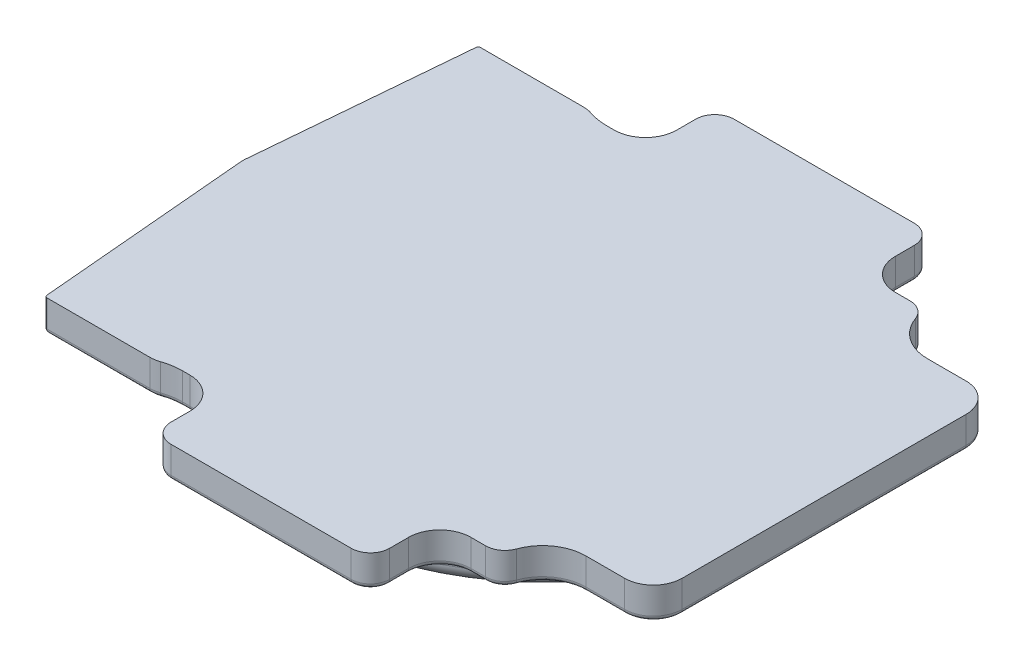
ISO-10303-21;
HEADER;
FILE_DESCRIPTION(('STEP AP214'),'2;1');
FILE_NAME('part.step','',(''),(''),'','','');
FILE_SCHEMA(('AUTOMOTIVE_DESIGN { 1 0 10303 214 1 1 1 1 }'));
ENDSEC;
DATA;
#1=APPLICATION_CONTEXT('core data for automotive mechanical design processes');
#2=APPLICATION_PROTOCOL_DEFINITION('international standard','automotive_design',2000,#1);
#3=PRODUCT_CONTEXT('',#1,'mechanical');
#4=PRODUCT('Part','Part','',(#3));
#5=PRODUCT_RELATED_PRODUCT_CATEGORY('part','',(#4));
#6=PRODUCT_DEFINITION_FORMATION('','',#4);
#7=PRODUCT_DEFINITION_CONTEXT('part definition',#1,'design');
#8=PRODUCT_DEFINITION('design','',#6,#7);
#9=PRODUCT_DEFINITION_SHAPE('','',#8);
#10=(LENGTH_UNIT() NAMED_UNIT(*) SI_UNIT(.MILLI.,.METRE.));
#11=(NAMED_UNIT(*) PLANE_ANGLE_UNIT() SI_UNIT($,.RADIAN.));
#12=(NAMED_UNIT(*) SI_UNIT($,.STERADIAN.) SOLID_ANGLE_UNIT());
#13=UNCERTAINTY_MEASURE_WITH_UNIT(LENGTH_MEASURE(1.E-05),#10,'distance_accuracy_value','');
#14=(GEOMETRIC_REPRESENTATION_CONTEXT(3) GLOBAL_UNCERTAINTY_ASSIGNED_CONTEXT((#13)) GLOBAL_UNIT_ASSIGNED_CONTEXT((#10,
#11,#12)) REPRESENTATION_CONTEXT('',''));
#15=CARTESIAN_POINT('',(0.,0.,0.));
#16=DIRECTION('',(0.,0.,1.));
#17=DIRECTION('',(1.,0.,0.));
#18=AXIS2_PLACEMENT_3D('',#15,#16,#17);
#19=CARTESIAN_POINT('',(-0.956255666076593,1.7,0.));
#20=DIRECTION('',(0.,-1.,0.));
#21=DIRECTION('',(0.,0.,-1.));
#22=AXIS2_PLACEMENT_3D('',#19,#20,#21);
#23=PLANE('',#22);
#24=DIRECTION('',(1.,0.,0.));
#25=VECTOR('',#24,1.);
#26=CARTESIAN_POINT('',(-0.956255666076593,1.7,22.06258867));
#27=LINE('',#26,#25);
#28=CARTESIAN_POINT('',(-18.322804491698,1.7,22.06258867));
#29=VERTEX_POINT('',#28);
#30=CARTESIAN_POINT('',(-28.7918345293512,1.7,22.06258867));
#31=VERTEX_POINT('',#30);
#32=EDGE_CURVE('E594',#29,#31,#27,.F.);
#33=ORIENTED_EDGE('',*,*,#32,.T.);
#34=DIRECTION('',(-0.0871557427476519,0.,-0.996194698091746));
#35=VECTOR('',#34,1.);
#36=CARTESIAN_POINT('',(-30.7029980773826,1.7,0.217889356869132));
#37=LINE('',#36,#35);
#38=CARTESIAN_POINT('',(-30.7029980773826,1.7,0.217889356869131));
#39=VERTEX_POINT('',#38);
#40=EDGE_CURVE('E672',#31,#39,#37,.T.);
#41=ORIENTED_EDGE('',*,*,#40,.T.);
#42=CARTESIAN_POINT('',(-28.2125113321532,1.7,0.));
#43=DIRECTION('',(0.,-1.,0.));
#44=DIRECTION('',(0.,0.,-1.));
#45=AXIS2_PLACEMENT_3D('',#42,#43,#44);
#46=CIRCLE('',#45,2.5);
#47=CARTESIAN_POINT('',(-30.7029980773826,1.7,-0.217889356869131));
#48=VERTEX_POINT('',#47);
#49=EDGE_CURVE('E670',#39,#48,#46,.T.);
#50=ORIENTED_EDGE('',*,*,#49,.T.);
#51=DIRECTION('',(0.0871557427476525,0.,-0.996194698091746));
#52=VECTOR('',#51,1.);
#53=CARTESIAN_POINT('',(-28.7718686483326,1.7,-22.2907997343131));
#54=LINE('',#53,#52);
#55=CARTESIAN_POINT('',(-28.7918345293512,1.7,-22.06258867));
#56=VERTEX_POINT('',#55);
#57=EDGE_CURVE('E668',#48,#56,#54,.T.);
#58=ORIENTED_EDGE('',*,*,#57,.T.);
#59=DIRECTION('',(-1.,0.,0.));
#60=VECTOR('',#59,1.);
#61=CARTESIAN_POINT('',(-0.956255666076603,1.7,-22.06258867));
#62=LINE('',#61,#60);
#63=CARTESIAN_POINT('',(-18.322804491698,1.7,-22.06258867));
#64=VERTEX_POINT('',#63);
#65=EDGE_CURVE('E666',#56,#64,#62,.F.);
#66=ORIENTED_EDGE('',*,*,#65,.T.);
#67=CARTESIAN_POINT('',(-18.322804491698,1.7,-19.56258867));
#68=DIRECTION('',(0.,-1.,0.));
#69=DIRECTION('',(0.,0.,-1.));
#70=AXIS2_PLACEMENT_3D('',#67,#68,#69);
#71=CIRCLE('',#70,2.5);
#72=CARTESIAN_POINT('',(-17.5161707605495,1.7,-21.9288815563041));
#73=VERTEX_POINT('',#72);
#74=EDGE_CURVE('E664',#64,#73,#71,.T.);
#75=ORIENTED_EDGE('',*,*,#74,.T.);
#76=CARTESIAN_POINT('',(-15.4189230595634,1.7,-28.0812430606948));
#77=DIRECTION('',(0.,-1.,0.));
#78=DIRECTION('',(0.,0.,-1.));
#79=AXIS2_PLACEMENT_3D('',#76,#77,#78);
#80=CIRCLE('',#79,6.5);
#81=CARTESIAN_POINT('',(-15.4189230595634,1.7,-21.5812430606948));
#82=VERTEX_POINT('',#81);
#83=EDGE_CURVE('E662',#73,#82,#80,.F.);
#84=ORIENTED_EDGE('',*,*,#83,.T.);
#85=DIRECTION('',(1.,0.,0.));
#86=VECTOR('',#85,1.);
#87=CARTESIAN_POINT('',(-14.625,1.7,-21.5812430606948));
#88=LINE('',#87,#86);
#89=CARTESIAN_POINT('',(-14.625,1.7,-21.5812430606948));
#90=VERTEX_POINT('',#89);
#91=EDGE_CURVE('E660',#82,#90,#88,.T.);
#92=ORIENTED_EDGE('',*,*,#91,.T.);
#93=CARTESIAN_POINT('',(-14.625,1.7,-25.3312430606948));
#94=DIRECTION('',(0.,-1.,0.));
#95=DIRECTION('',(0.,0.,-1.));
#96=AXIS2_PLACEMENT_3D('',#93,#94,#95);
#97=CIRCLE('',#96,3.75);
#98=CARTESIAN_POINT('',(-12.75,1.7,-22.0836477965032));
#99=VERTEX_POINT('',#98);
#100=EDGE_CURVE('E658',#90,#99,#97,.F.);
#101=ORIENTED_EDGE('',*,*,#100,.T.);
#102=CARTESIAN_POINT('',(0.,1.7,0.));
#103=DIRECTION('',(0.,-1.,0.));
#104=DIRECTION('',(0.,0.,-1.));
#105=AXIS2_PLACEMENT_3D('',#102,#103,#104);
#106=CIRCLE('',#105,25.5);
#107=CARTESIAN_POINT('',(-12.75,1.7,22.0836477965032));
#108=VERTEX_POINT('',#107);
#109=EDGE_CURVE('E587',#99,#108,#106,.F.);
#110=ORIENTED_EDGE('',*,*,#109,.T.);
#111=CARTESIAN_POINT('',(-14.6250000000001,1.7,25.3312430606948));
#112=DIRECTION('',(0.,-1.,0.));
#113=DIRECTION('',(0.,0.,-1.));
#114=AXIS2_PLACEMENT_3D('',#111,#112,#113);
#115=CIRCLE('',#114,3.75);
#116=CARTESIAN_POINT('',(-14.625,1.7,21.5812430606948));
#117=VERTEX_POINT('',#116);
#118=EDGE_CURVE('E602',#108,#117,#115,.F.);
#119=ORIENTED_EDGE('',*,*,#118,.T.);
#120=DIRECTION('',(-1.,0.,0.));
#121=VECTOR('',#120,1.);
#122=CARTESIAN_POINT('',(-15.4189230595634,1.7,21.5812430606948));
#123=LINE('',#122,#121);
#124=CARTESIAN_POINT('',(-15.4189230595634,1.7,21.5812430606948));
#125=VERTEX_POINT('',#124);
#126=EDGE_CURVE('E600',#117,#125,#123,.T.);
#127=ORIENTED_EDGE('',*,*,#126,.T.);
#128=CARTESIAN_POINT('',(-15.4189230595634,1.7,28.0812430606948));
#129=DIRECTION('',(0.,-1.,0.));
#130=DIRECTION('',(0.,0.,-1.));
#131=AXIS2_PLACEMENT_3D('',#128,#129,#130);
#132=CIRCLE('',#131,6.5);
#133=CARTESIAN_POINT('',(-17.5161707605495,1.7,21.9288815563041));
#134=VERTEX_POINT('',#133);
#135=EDGE_CURVE('E598',#125,#134,#132,.F.);
#136=ORIENTED_EDGE('',*,*,#135,.T.);
#137=CARTESIAN_POINT('',(-18.322804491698,1.7,19.56258867));
#138=DIRECTION('',(0.,-1.,0.));
#139=DIRECTION('',(0.,0.,-1.));
#140=AXIS2_PLACEMENT_3D('',#137,#138,#139);
#141=CIRCLE('',#140,2.5);
#142=EDGE_CURVE('E596',#134,#29,#141,.T.);
#143=ORIENTED_EDGE('',*,*,#142,.T.);
#144=EDGE_LOOP('',(#33,#41,#50,#58,#66,#75,#84,#92,#101,#110,#119,#127,#136,#143));
#145=FACE_BOUND('',#144,.T.);
#146=ADVANCED_FACE('F17',(#145),#23,.T.);
#147=CARTESIAN_POINT('',(12.75,1.7,-22.0836477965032));
#148=VERTEX_POINT('',#147);
#149=EDGE_CURVE('E586',#148,#99,#106,.F.);
#150=ORIENTED_EDGE('',*,*,#149,.T.);
#151=CARTESIAN_POINT('',(-14.625,1.7,-25.3312430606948));
#152=DIRECTION('',(0.,-1.,0.));
#153=DIRECTION('',(0.,0.,-1.));
#154=AXIS2_PLACEMENT_3D('',#151,#152,#153);
#155=CIRCLE('',#154,3.75);
#156=CARTESIAN_POINT('',(-10.8750000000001,1.7,-25.3312430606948));
#157=VERTEX_POINT('',#156);
#158=EDGE_CURVE('E656',#99,#157,#155,.F.);
#159=ORIENTED_EDGE('',*,*,#158,.T.);
#160=DIRECTION('',(0.,0.,-1.));
#161=VECTOR('',#160,1.);
#162=CARTESIAN_POINT('',(-10.8750000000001,1.7,-27.3));
#163=LINE('',#162,#161);
#164=CARTESIAN_POINT('',(-10.8750000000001,1.7,-27.3));
#165=VERTEX_POINT('',#164);
#166=EDGE_CURVE('E654',#157,#165,#163,.T.);
#167=ORIENTED_EDGE('',*,*,#166,.T.);
#168=CARTESIAN_POINT('',(-9.37500000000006,1.7,-27.3));
#169=DIRECTION('',(0.,-1.,0.));
#170=DIRECTION('',(0.,0.,-1.));
#171=AXIS2_PLACEMENT_3D('',#168,#169,#170);
#172=CIRCLE('',#171,1.5);
#173=CARTESIAN_POINT('',(-9.37500000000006,1.7,-28.8));
#174=VERTEX_POINT('',#173);
#175=EDGE_CURVE('E652',#165,#174,#172,.T.);
#176=ORIENTED_EDGE('',*,*,#175,.T.);
#177=DIRECTION('',(1.,0.,0.));
#178=VECTOR('',#177,1.);
#179=CARTESIAN_POINT('',(9.37500000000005,1.7,-28.8));
#180=LINE('',#179,#178);
#181=CARTESIAN_POINT('',(9.37500000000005,1.7,-28.8));
#182=VERTEX_POINT('',#181);
#183=EDGE_CURVE('E650',#174,#182,#180,.T.);
#184=ORIENTED_EDGE('',*,*,#183,.T.);
#185=CARTESIAN_POINT('',(9.37500000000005,1.7,-27.3));
#186=DIRECTION('',(0.,-1.,0.));
#187=DIRECTION('',(0.,0.,-1.));
#188=AXIS2_PLACEMENT_3D('',#185,#186,#187);
#189=CIRCLE('',#188,1.5);
#190=CARTESIAN_POINT('',(10.875,1.7,-27.3));
#191=VERTEX_POINT('',#190);
#192=EDGE_CURVE('E648',#182,#191,#189,.T.);
#193=ORIENTED_EDGE('',*,*,#192,.T.);
#194=DIRECTION('',(0.,0.,1.));
#195=VECTOR('',#194,1.);
#196=CARTESIAN_POINT('',(10.875,1.7,-25.3312430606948));
#197=LINE('',#196,#195);
#198=CARTESIAN_POINT('',(10.875,1.7,-25.3312430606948));
#199=VERTEX_POINT('',#198);
#200=EDGE_CURVE('E646',#191,#199,#197,.T.);
#201=ORIENTED_EDGE('',*,*,#200,.T.);
#202=CARTESIAN_POINT('',(14.625,1.7,-25.3312430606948));
#203=DIRECTION('',(0.,-1.,0.));
#204=DIRECTION('',(0.,0.,-1.));
#205=AXIS2_PLACEMENT_3D('',#202,#203,#204);
#206=CIRCLE('',#205,3.75);
#207=EDGE_CURVE('E644',#199,#148,#206,.F.);
#208=ORIENTED_EDGE('',*,*,#207,.T.);
#209=EDGE_LOOP('',(#150,#159,#167,#176,#184,#193,#201,#208));
#210=FACE_BOUND('',#209,.T.);
#211=ADVANCED_FACE('F1168',(#210),#23,.T.);
#212=CARTESIAN_POINT('',(12.75,1.7,22.0836477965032));
#213=VERTEX_POINT('',#212);
#214=EDGE_CURVE('E1194',#213,#148,#106,.F.);
#215=ORIENTED_EDGE('',*,*,#214,.T.);
#216=CARTESIAN_POINT('',(14.625,1.7,-25.3312430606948));
#217=DIRECTION('',(0.,-1.,0.));
#218=DIRECTION('',(0.,0.,-1.));
#219=AXIS2_PLACEMENT_3D('',#216,#217,#218);
#220=CIRCLE('',#219,3.75);
#221=CARTESIAN_POINT('',(14.625,1.7,-21.5812430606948));
#222=VERTEX_POINT('',#221);
#223=EDGE_CURVE('E642',#148,#222,#220,.F.);
#224=ORIENTED_EDGE('',*,*,#223,.T.);
#225=DIRECTION('',(1.,0.,0.));
#226=VECTOR('',#225,1.);
#227=CARTESIAN_POINT('',(16.1548428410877,1.7,-21.5812430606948));
#228=LINE('',#227,#226);
#229=CARTESIAN_POINT('',(16.1548428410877,1.7,-21.5812430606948));
#230=VERTEX_POINT('',#229);
#231=EDGE_CURVE('E640',#222,#230,#228,.T.);
#232=ORIENTED_EDGE('',*,*,#231,.T.);
#233=CARTESIAN_POINT('',(16.1548428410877,1.7,-20.0812430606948));
#234=DIRECTION('',(0.,-1.,0.));
#235=DIRECTION('',(0.,0.,-1.));
#236=AXIS2_PLACEMENT_3D('',#233,#234,#235);
#237=CIRCLE('',#236,1.5);
#238=CARTESIAN_POINT('',(17.566924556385,1.7,-20.5872324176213));
#239=VERTEX_POINT('',#238);
#240=EDGE_CURVE('E638',#230,#239,#237,.T.);
#241=ORIENTED_EDGE('',*,*,#240,.T.);
#242=CARTESIAN_POINT('',(22.2738636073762,1.7,-22.2738636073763));
#243=DIRECTION('',(0.,-1.,0.));
#244=DIRECTION('',(0.,0.,-1.));
#245=AXIS2_PLACEMENT_3D('',#242,#243,#244);
#246=CIRCLE('',#245,5.);
#247=CARTESIAN_POINT('',(22.2738636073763,1.7,-17.2738636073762));
#248=VERTEX_POINT('',#247);
#249=EDGE_CURVE('E636',#239,#248,#246,.F.);
#250=ORIENTED_EDGE('',*,*,#249,.T.);
#251=DIRECTION('',(-1.,0.,0.));
#252=VECTOR('',#251,1.);
#253=CARTESIAN_POINT('',(-0.956255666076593,1.7,-17.2738636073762));
#254=LINE('',#253,#252);
#255=CARTESIAN_POINT('',(26.3,1.7,-17.2738636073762));
#256=VERTEX_POINT('',#255);
#257=EDGE_CURVE('E634',#248,#256,#254,.F.);
#258=ORIENTED_EDGE('',*,*,#257,.T.);
#259=CARTESIAN_POINT('',(26.3,1.7,-14.7738636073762));
#260=DIRECTION('',(0.,-1.,0.));
#261=DIRECTION('',(0.,0.,-1.));
#262=AXIS2_PLACEMENT_3D('',#259,#260,#261);
#263=CIRCLE('',#262,2.5);
#264=CARTESIAN_POINT('',(28.8,1.7,-14.7738636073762));
#265=VERTEX_POINT('',#264);
#266=EDGE_CURVE('E632',#256,#265,#263,.T.);
#267=ORIENTED_EDGE('',*,*,#266,.T.);
#268=DIRECTION('',(0.,0.,1.));
#269=VECTOR('',#268,1.);
#270=CARTESIAN_POINT('',(28.8,1.7,14.7738636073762));
#271=LINE('',#270,#269);
#272=CARTESIAN_POINT('',(28.8,1.7,14.7738636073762));
#273=VERTEX_POINT('',#272);
#274=EDGE_CURVE('E630',#265,#273,#271,.T.);
#275=ORIENTED_EDGE('',*,*,#274,.T.);
#276=CARTESIAN_POINT('',(26.3,1.7,14.7738636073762));
#277=DIRECTION('',(0.,-1.,0.));
#278=DIRECTION('',(0.,0.,-1.));
#279=AXIS2_PLACEMENT_3D('',#276,#277,#278);
#280=CIRCLE('',#279,2.5);
#281=CARTESIAN_POINT('',(26.3,1.7,17.2738636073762));
#282=VERTEX_POINT('',#281);
#283=EDGE_CURVE('E628',#273,#282,#280,.T.);
#284=ORIENTED_EDGE('',*,*,#283,.T.);
#285=DIRECTION('',(1.,0.,0.));
#286=VECTOR('',#285,1.);
#287=CARTESIAN_POINT('',(-0.956255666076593,1.7,17.2738636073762));
#288=LINE('',#287,#286);
#289=CARTESIAN_POINT('',(22.2738636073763,1.7,17.2738636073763));
#290=VERTEX_POINT('',#289);
#291=EDGE_CURVE('E626',#282,#290,#288,.F.);
#292=ORIENTED_EDGE('',*,*,#291,.T.);
#293=CARTESIAN_POINT('',(22.2738636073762,1.7,22.2738636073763));
#294=DIRECTION('',(0.,-1.,0.));
#295=DIRECTION('',(0.,0.,-1.));
#296=AXIS2_PLACEMENT_3D('',#293,#294,#295);
#297=CIRCLE('',#296,5.);
#298=CARTESIAN_POINT('',(17.566924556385,1.7,20.5872324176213));
#299=VERTEX_POINT('',#298);
#300=EDGE_CURVE('E624',#290,#299,#297,.F.);
#301=ORIENTED_EDGE('',*,*,#300,.T.);
#302=CARTESIAN_POINT('',(16.1548428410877,1.7,20.0812430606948));
#303=DIRECTION('',(0.,-1.,0.));
#304=DIRECTION('',(0.,0.,-1.));
#305=AXIS2_PLACEMENT_3D('',#302,#303,#304);
#306=CIRCLE('',#305,1.5);
#307=CARTESIAN_POINT('',(16.1548428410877,1.7,21.5812430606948));
#308=VERTEX_POINT('',#307);
#309=EDGE_CURVE('E622',#299,#308,#306,.T.);
#310=ORIENTED_EDGE('',*,*,#309,.T.);
#311=DIRECTION('',(-1.,0.,0.));
#312=VECTOR('',#311,1.);
#313=CARTESIAN_POINT('',(14.6250000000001,1.7,21.5812430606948));
#314=LINE('',#313,#312);
#315=CARTESIAN_POINT('',(14.6250000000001,1.7,21.5812430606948));
#316=VERTEX_POINT('',#315);
#317=EDGE_CURVE('E620',#308,#316,#314,.T.);
#318=ORIENTED_EDGE('',*,*,#317,.T.);
#319=CARTESIAN_POINT('',(14.6250000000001,1.7,25.3312430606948));
#320=DIRECTION('',(0.,-1.,0.));
#321=DIRECTION('',(0.,0.,-1.));
#322=AXIS2_PLACEMENT_3D('',#319,#320,#321);
#323=CIRCLE('',#322,3.75);
#324=EDGE_CURVE('E618',#316,#213,#323,.F.);
#325=ORIENTED_EDGE('',*,*,#324,.T.);
#326=EDGE_LOOP('',(#215,#224,#232,#241,#250,#258,#267,#275,#284,#292,#301,#310,#318,#325));
#327=FACE_BOUND('',#326,.T.);
#328=ADVANCED_FACE('F1173',(#327),#23,.T.);
#329=CARTESIAN_POINT('',(29.3,5.,-29.3));
#330=DIRECTION('',(0.,0.,1.));
#331=DIRECTION('',(1.,0.,0.));
#332=AXIS2_PLACEMENT_3D('',#329,#330,#331);
#333=PLANE('',#332);
#334=DIRECTION('',(0.,-1.,0.));
#335=VECTOR('',#334,1.);
#336=CARTESIAN_POINT('',(9.37500000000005,5.,-29.3));
#337=LINE('',#336,#335);
#338=CARTESIAN_POINT('',(9.37500000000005,5.,-29.3));
#339=VERTEX_POINT('',#338);
#340=CARTESIAN_POINT('',(9.37500000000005,2.2,-29.3));
#341=VERTEX_POINT('',#340);
#342=EDGE_CURVE('E515',#339,#341,#337,.T.);
#343=ORIENTED_EDGE('',*,*,#342,.T.);
#344=DIRECTION('',(1.,0.,0.));
#345=VECTOR('',#344,1.);
#346=CARTESIAN_POINT('',(-9.37500000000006,2.2,-29.3));
#347=LINE('',#346,#345);
#348=CARTESIAN_POINT('',(-9.37500000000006,2.2,-29.3));
#349=VERTEX_POINT('',#348);
#350=EDGE_CURVE('E696',#341,#349,#347,.F.);
#351=ORIENTED_EDGE('',*,*,#350,.T.);
#352=DIRECTION('',(0.,1.,0.));
#353=VECTOR('',#352,1.);
#354=CARTESIAN_POINT('',(-9.37500000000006,5.,-29.3));
#355=LINE('',#354,#353);
#356=CARTESIAN_POINT('',(-9.37500000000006,5.,-29.3));
#357=VERTEX_POINT('',#356);
#358=EDGE_CURVE('E518',#349,#357,#355,.T.);
#359=ORIENTED_EDGE('',*,*,#358,.T.);
#360=DIRECTION('',(-1.,0.,0.));
#361=VECTOR('',#360,1.);
#362=CARTESIAN_POINT('',(29.3,5.,-29.3));
#363=LINE('',#362,#361);
#364=EDGE_CURVE('E480',#339,#357,#363,.T.);
#365=ORIENTED_EDGE('',*,*,#364,.F.);
#366=EDGE_LOOP('',(#343,#351,#359,#365));
#367=FACE_BOUND('',#366,.T.);
#368=ADVANCED_FACE('F19',(#367),#333,.F.);
#369=CARTESIAN_POINT('',(-33.,5.,29.3));
#370=DIRECTION('',(0.,0.,-1.));
#371=DIRECTION('',(-1.,0.,0.));
#372=AXIS2_PLACEMENT_3D('',#369,#370,#371);
#373=PLANE('',#372);
#374=DIRECTION('',(0.,-1.,0.));
#375=VECTOR('',#374,1.);
#376=CARTESIAN_POINT('',(-9.37500000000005,5.,29.3));
#377=LINE('',#376,#375);
#378=CARTESIAN_POINT('',(-9.37500000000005,5.,29.3));
#379=VERTEX_POINT('',#378);
#380=CARTESIAN_POINT('',(-9.37500000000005,2.2,29.3));
#381=VERTEX_POINT('',#380);
#382=EDGE_CURVE('E499',#379,#381,#377,.T.);
#383=ORIENTED_EDGE('',*,*,#382,.T.);
#384=DIRECTION('',(-1.,0.,0.));
#385=VECTOR('',#384,1.);
#386=CARTESIAN_POINT('',(9.37500000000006,2.2,29.3));
#387=LINE('',#386,#385);
#388=CARTESIAN_POINT('',(9.37500000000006,2.2,29.3));
#389=VERTEX_POINT('',#388);
#390=EDGE_CURVE('E732',#381,#389,#387,.F.);
#391=ORIENTED_EDGE('',*,*,#390,.T.);
#392=DIRECTION('',(0.,1.,0.));
#393=VECTOR('',#392,1.);
#394=CARTESIAN_POINT('',(9.37500000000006,5.,29.3));
#395=LINE('',#394,#393);
#396=CARTESIAN_POINT('',(9.37500000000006,5.,29.3));
#397=VERTEX_POINT('',#396);
#398=EDGE_CURVE('E497',#389,#397,#395,.T.);
#399=ORIENTED_EDGE('',*,*,#398,.T.);
#400=DIRECTION('',(1.,0.,0.));
#401=VECTOR('',#400,1.);
#402=CARTESIAN_POINT('',(-33.,5.,29.3));
#403=LINE('',#402,#401);
#404=EDGE_CURVE('E491',#379,#397,#403,.T.);
#405=ORIENTED_EDGE('',*,*,#404,.F.);
#406=EDGE_LOOP('',(#383,#391,#399,#405));
#407=FACE_BOUND('',#406,.T.);
#408=ADVANCED_FACE('F1003',(#407),#373,.F.);
#409=CARTESIAN_POINT('',(29.3,5.,29.3));
#410=DIRECTION('',(-1.,0.,0.));
#411=DIRECTION('',(0.,0.,1.));
#412=AXIS2_PLACEMENT_3D('',#409,#410,#411);
#413=PLANE('',#412);
#414=DIRECTION('',(0.,1.,0.));
#415=VECTOR('',#414,1.);
#416=CARTESIAN_POINT('',(29.3,-0.8,14.7738636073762));
#417=LINE('',#416,#415);
#418=CARTESIAN_POINT('',(29.3,2.2,14.7738636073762));
#419=VERTEX_POINT('',#418);
#420=CARTESIAN_POINT('',(29.3,5.,14.7738636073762));
#421=VERTEX_POINT('',#420);
#422=EDGE_CURVE('E485',#419,#421,#417,.T.);
#423=ORIENTED_EDGE('',*,*,#422,.F.);
#424=DIRECTION('',(0.,0.,1.));
#425=VECTOR('',#424,1.);
#426=CARTESIAN_POINT('',(29.3,2.2,-14.7738636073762));
#427=LINE('',#426,#425);
#428=CARTESIAN_POINT('',(29.3,2.2,-14.7738636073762));
#429=VERTEX_POINT('',#428);
#430=EDGE_CURVE('E714',#419,#429,#427,.F.);
#431=ORIENTED_EDGE('',*,*,#430,.T.);
#432=DIRECTION('',(0.,1.,0.));
#433=VECTOR('',#432,1.);
#434=CARTESIAN_POINT('',(29.3,-0.8,-14.7738636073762));
#435=LINE('',#434,#433);
#436=CARTESIAN_POINT('',(29.3,5.,-14.7738636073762));
#437=VERTEX_POINT('',#436);
#438=EDGE_CURVE('E483',#429,#437,#435,.T.);
#439=ORIENTED_EDGE('',*,*,#438,.T.);
#440=DIRECTION('',(0.,0.,-1.));
#441=VECTOR('',#440,1.);
#442=CARTESIAN_POINT('',(29.3,5.,29.3));
#443=LINE('',#442,#441);
#444=EDGE_CURVE('E494',#421,#437,#443,.T.);
#445=ORIENTED_EDGE('',*,*,#444,.F.);
#446=EDGE_LOOP('',(#423,#431,#439,#445));
#447=FACE_BOUND('',#446,.T.);
#448=ADVANCED_FACE('F1080',(#447),#413,.F.);
#449=CARTESIAN_POINT('',(22.2738636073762,-0.8,22.2738636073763));
#450=DIRECTION('',(0.,1.,0.));
#451=DIRECTION('',(0.,0.,1.));
#452=AXIS2_PLACEMENT_3D('',#449,#450,#451);
#453=CYLINDRICAL_SURFACE('',#452,4.5);
#454=DIRECTION('',(0.,1.,0.));
#455=VECTOR('',#454,1.);
#456=CARTESIAN_POINT('',(18.0376184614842,-0.8,20.7558955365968));
#457=LINE('',#456,#455);
#458=CARTESIAN_POINT('',(18.0376184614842,5.,20.7558955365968));
#459=VERTEX_POINT('',#458);
#460=CARTESIAN_POINT('',(18.0376184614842,2.2,20.7558955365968));
#461=VERTEX_POINT('',#460);
#462=EDGE_CURVE('E531',#459,#461,#457,.F.);
#463=ORIENTED_EDGE('',*,*,#462,.T.);
#464=CARTESIAN_POINT('',(22.2738636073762,2.2,22.2738636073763));
#465=DIRECTION('',(0.,-1.,0.));
#466=DIRECTION('',(0.,0.,-1.));
#467=AXIS2_PLACEMENT_3D('',#464,#465,#466);
#468=CIRCLE('',#467,4.5);
#469=CARTESIAN_POINT('',(22.2738636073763,2.2,17.7738636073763));
#470=VERTEX_POINT('',#469);
#471=EDGE_CURVE('E720',#461,#470,#468,.T.);
#472=ORIENTED_EDGE('',*,*,#471,.T.);
#473=DIRECTION('',(0.,1.,0.));
#474=VECTOR('',#473,1.);
#475=CARTESIAN_POINT('',(22.2738636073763,-0.8,17.7738636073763));
#476=LINE('',#475,#474);
#477=CARTESIAN_POINT('',(22.2738636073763,5.,17.7738636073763));
#478=VERTEX_POINT('',#477);
#479=EDGE_CURVE('E477',#470,#478,#476,.T.);
#480=ORIENTED_EDGE('',*,*,#479,.T.);
#481=CARTESIAN_POINT('',(22.2738636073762,5.,22.2738636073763));
#482=DIRECTION('',(0.,-1.,0.));
#483=DIRECTION('',(0.,0.,-1.));
#484=AXIS2_PLACEMENT_3D('',#481,#482,#483);
#485=CIRCLE('',#484,4.5);
#486=EDGE_CURVE('E452',#459,#478,#485,.T.);
#487=ORIENTED_EDGE('',*,*,#486,.F.);
#488=EDGE_LOOP('',(#463,#472,#480,#487));
#489=FACE_BOUND('',#488,.T.);
#490=ADVANCED_FACE('F1057',(#489),#453,.F.);
#491=CARTESIAN_POINT('',(22.2738636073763,-0.8,17.7738636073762));
#492=DIRECTION('',(0.,0.,1.));
#493=DIRECTION('',(1.,0.,0.));
#494=AXIS2_PLACEMENT_3D('',#491,#492,#493);
#495=PLANE('',#494);
#496=ORIENTED_EDGE('',*,*,#479,.F.);
#497=DIRECTION('',(1.,0.,0.));
#498=VECTOR('',#497,1.);
#499=CARTESIAN_POINT('',(22.2738636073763,2.2,17.7738636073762));
#500=LINE('',#499,#498);
#501=CARTESIAN_POINT('',(26.3,2.2,17.7738636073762));
#502=VERTEX_POINT('',#501);
#503=EDGE_CURVE('E718',#470,#502,#500,.T.);
#504=ORIENTED_EDGE('',*,*,#503,.T.);
#505=DIRECTION('',(0.,1.,0.));
#506=VECTOR('',#505,1.);
#507=CARTESIAN_POINT('',(26.3,-0.8,17.7738636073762));
#508=LINE('',#507,#506);
#509=CARTESIAN_POINT('',(26.3,5.,17.7738636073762));
#510=VERTEX_POINT('',#509);
#511=EDGE_CURVE('E487',#502,#510,#508,.T.);
#512=ORIENTED_EDGE('',*,*,#511,.T.);
#513=DIRECTION('',(1.,0.,0.));
#514=VECTOR('',#513,1.);
#515=CARTESIAN_POINT('',(22.2738636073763,5.,17.7738636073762));
#516=LINE('',#515,#514);
#517=EDGE_CURVE('E456',#478,#510,#516,.T.);
#518=ORIENTED_EDGE('',*,*,#517,.F.);
#519=EDGE_LOOP('',(#496,#504,#512,#518));
#520=FACE_BOUND('',#519,.T.);
#521=ADVANCED_FACE('F1062',(#520),#495,.T.);
#522=CARTESIAN_POINT('',(26.3,-0.8,14.7738636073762));
#523=DIRECTION('',(0.,1.,0.));
#524=DIRECTION('',(0.,0.,1.));
#525=AXIS2_PLACEMENT_3D('',#522,#523,#524);
#526=CYLINDRICAL_SURFACE('',#525,3.);
#527=ORIENTED_EDGE('',*,*,#511,.F.);
#528=CARTESIAN_POINT('',(26.3,2.2,14.7738636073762));
#529=DIRECTION('',(0.,-1.,0.));
#530=DIRECTION('',(0.,0.,-1.));
#531=AXIS2_PLACEMENT_3D('',#528,#529,#530);
#532=CIRCLE('',#531,3.);
#533=EDGE_CURVE('E716',#502,#419,#532,.F.);
#534=ORIENTED_EDGE('',*,*,#533,.T.);
#535=ORIENTED_EDGE('',*,*,#422,.T.);
#536=CARTESIAN_POINT('',(26.3,5.,14.7738636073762));
#537=DIRECTION('',(0.,1.,0.));
#538=DIRECTION('',(0.,0.,-1.));
#539=AXIS2_PLACEMENT_3D('',#536,#537,#538);
#540=CIRCLE('',#539,3.);
#541=EDGE_CURVE('E459',#510,#421,#540,.T.);
#542=ORIENTED_EDGE('',*,*,#541,.F.);
#543=EDGE_LOOP('',(#527,#534,#535,#542));
#544=FACE_BOUND('',#543,.T.);
#545=ADVANCED_FACE('F1075',(#544),#526,.T.);
#546=CARTESIAN_POINT('',(26.3,-0.8,-14.7738636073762));
#547=DIRECTION('',(0.,1.,0.));
#548=DIRECTION('',(0.,0.,1.));
#549=AXIS2_PLACEMENT_3D('',#546,#547,#548);
#550=CYLINDRICAL_SURFACE('',#549,3.);
#551=ORIENTED_EDGE('',*,*,#438,.F.);
#552=CARTESIAN_POINT('',(26.3,2.2,-14.7738636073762));
#553=DIRECTION('',(0.,-1.,0.));
#554=DIRECTION('',(0.,0.,-1.));
#555=AXIS2_PLACEMENT_3D('',#552,#553,#554);
#556=CIRCLE('',#555,3.);
#557=CARTESIAN_POINT('',(26.3,2.2,-17.7738636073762));
#558=VERTEX_POINT('',#557);
#559=EDGE_CURVE('E712',#429,#558,#556,.F.);
#560=ORIENTED_EDGE('',*,*,#559,.T.);
#561=DIRECTION('',(0.,1.,0.));
#562=VECTOR('',#561,1.);
#563=CARTESIAN_POINT('',(26.3,-0.8,-17.7738636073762));
#564=LINE('',#563,#562);
#565=CARTESIAN_POINT('',(26.3,5.,-17.7738636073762));
#566=VERTEX_POINT('',#565);
#567=EDGE_CURVE('E481',#558,#566,#564,.T.);
#568=ORIENTED_EDGE('',*,*,#567,.T.);
#569=CARTESIAN_POINT('',(26.3,5.,-14.7738636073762));
#570=DIRECTION('',(0.,1.,0.));
#571=DIRECTION('',(0.,0.,1.));
#572=AXIS2_PLACEMENT_3D('',#569,#570,#571);
#573=CIRCLE('',#572,3.);
#574=EDGE_CURVE('E462',#437,#566,#573,.T.);
#575=ORIENTED_EDGE('',*,*,#574,.F.);
#576=EDGE_LOOP('',(#551,#560,#568,#575));
#577=FACE_BOUND('',#576,.T.);
#578=ADVANCED_FACE('F1093',(#577),#550,.T.);
#579=CARTESIAN_POINT('',(22.2738636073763,-0.8,-17.7738636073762));
#580=DIRECTION('',(0.,0.,-1.));
#581=DIRECTION('',(-1.,0.,0.));
#582=AXIS2_PLACEMENT_3D('',#579,#580,#581);
#583=PLANE('',#582);
#584=ORIENTED_EDGE('',*,*,#567,.F.);
#585=DIRECTION('',(-1.,0.,0.));
#586=VECTOR('',#585,1.);
#587=CARTESIAN_POINT('',(22.2738636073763,2.2,-17.7738636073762));
#588=LINE('',#587,#586);
#589=CARTESIAN_POINT('',(22.2738636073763,2.2,-17.7738636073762));
#590=VERTEX_POINT('',#589);
#591=EDGE_CURVE('E710',#558,#590,#588,.T.);
#592=ORIENTED_EDGE('',*,*,#591,.T.);
#593=DIRECTION('',(0.,1.,0.));
#594=VECTOR('',#593,1.);
#595=CARTESIAN_POINT('',(22.2738636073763,-0.8,-17.7738636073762));
#596=LINE('',#595,#594);
#597=CARTESIAN_POINT('',(22.2738636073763,5.,-17.7738636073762));
#598=VERTEX_POINT('',#597);
#599=EDGE_CURVE('E478',#590,#598,#596,.T.);
#600=ORIENTED_EDGE('',*,*,#599,.T.);
#601=DIRECTION('',(-1.,0.,0.));
#602=VECTOR('',#601,1.);
#603=CARTESIAN_POINT('',(22.2738636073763,5.,-17.7738636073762));
#604=LINE('',#603,#602);
#605=EDGE_CURVE('E465',#566,#598,#604,.T.);
#606=ORIENTED_EDGE('',*,*,#605,.F.);
#607=EDGE_LOOP('',(#584,#592,#600,#606));
#608=FACE_BOUND('',#607,.T.);
#609=ADVANCED_FACE('F1098',(#608),#583,.T.);
#610=CARTESIAN_POINT('',(22.2738636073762,-0.8,-22.2738636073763));
#611=DIRECTION('',(0.,1.,0.));
#612=DIRECTION('',(0.,0.,1.));
#613=AXIS2_PLACEMENT_3D('',#610,#611,#612);
#614=CYLINDRICAL_SURFACE('',#613,4.5);
#615=ORIENTED_EDGE('',*,*,#599,.F.);
#616=CARTESIAN_POINT('',(22.2738636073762,2.2,-22.2738636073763));
#617=DIRECTION('',(0.,-1.,0.));
#618=DIRECTION('',(0.,0.,-1.));
#619=AXIS2_PLACEMENT_3D('',#616,#617,#618);
#620=CIRCLE('',#619,4.5);
#621=CARTESIAN_POINT('',(18.0376184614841,2.2,-20.7558955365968));
#622=VERTEX_POINT('',#621);
#623=EDGE_CURVE('E708',#590,#622,#620,.T.);
#624=ORIENTED_EDGE('',*,*,#623,.T.);
#625=DIRECTION('',(0.,1.,0.));
#626=VECTOR('',#625,1.);
#627=CARTESIAN_POINT('',(18.0376184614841,-0.8,-20.7558955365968));
#628=LINE('',#627,#626);
#629=CARTESIAN_POINT('',(18.0376184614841,5.,-20.7558955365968));
#630=VERTEX_POINT('',#629);
#631=EDGE_CURVE('E525',#622,#630,#628,.T.);
#632=ORIENTED_EDGE('',*,*,#631,.T.);
#633=CARTESIAN_POINT('',(22.2738636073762,5.,-22.2738636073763));
#634=DIRECTION('',(0.,-1.,0.));
#635=DIRECTION('',(0.,0.,1.));
#636=AXIS2_PLACEMENT_3D('',#633,#634,#635);
#637=CIRCLE('',#636,4.5);
#638=EDGE_CURVE('E468',#598,#630,#637,.T.);
#639=ORIENTED_EDGE('',*,*,#638,.F.);
#640=EDGE_LOOP('',(#615,#624,#632,#639));
#641=FACE_BOUND('',#640,.T.);
#642=ADVANCED_FACE('F1112',(#641),#614,.F.);
#643=CARTESIAN_POINT('',(-17.77358943,-0.8,-22.56258867));
#644=DIRECTION('',(0.,0.,-1.));
#645=DIRECTION('',(-1.,0.,0.));
#646=AXIS2_PLACEMENT_3D('',#643,#644,#645);
#647=PLANE('',#646);
#648=DIRECTION('',(0.,1.,0.));
#649=VECTOR('',#648,1.);
#650=CARTESIAN_POINT('',(-18.322804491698,-0.8,-22.56258867));
#651=LINE('',#650,#649);
#652=CARTESIAN_POINT('',(-18.322804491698,5.,-22.56258867));
#653=VERTEX_POINT('',#652);
#654=CARTESIAN_POINT('',(-18.322804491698,2.2,-22.56258867));
#655=VERTEX_POINT('',#654);
#656=EDGE_CURVE('E573',#653,#655,#651,.F.);
#657=ORIENTED_EDGE('',*,*,#656,.T.);
#658=DIRECTION('',(-1.,0.,0.));
#659=VECTOR('',#658,1.);
#660=CARTESIAN_POINT('',(-17.77358943,2.2,-22.56258867));
#661=LINE('',#660,#659);
#662=CARTESIAN_POINT('',(-29.0209173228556,2.2,-22.56258867));
#663=VERTEX_POINT('',#662);
#664=EDGE_CURVE('E683',#655,#663,#661,.T.);
#665=ORIENTED_EDGE('',*,*,#664,.T.);
#666=DIRECTION('',(0.,1.,0.));
#667=VECTOR('',#666,1.);
#668=CARTESIAN_POINT('',(-29.0209173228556,5.,-22.56258867));
#669=LINE('',#668,#667);
#670=CARTESIAN_POINT('',(-29.0209173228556,5.,-22.56258867));
#671=VERTEX_POINT('',#670);
#672=EDGE_CURVE('E537',#663,#671,#669,.T.);
#673=ORIENTED_EDGE('',*,*,#672,.T.);
#674=DIRECTION('',(-1.,0.,0.));
#675=VECTOR('',#674,1.);
#676=CARTESIAN_POINT('',(-17.77358943,5.,-22.56258867));
#677=LINE('',#676,#675);
#678=EDGE_CURVE('E471',#653,#671,#677,.T.);
#679=ORIENTED_EDGE('',*,*,#678,.F.);
#680=EDGE_LOOP('',(#657,#665,#673,#679));
#681=FACE_BOUND('',#680,.T.);
#682=ADVANCED_FACE('F1645',(#681),#647,.T.);
#683=CARTESIAN_POINT('',(-17.77358943,-0.8,22.56258867));
#684=DIRECTION('',(0.,0.,1.));
#685=DIRECTION('',(1.,0.,0.));
#686=AXIS2_PLACEMENT_3D('',#683,#684,#685);
#687=PLANE('',#686);
#688=DIRECTION('',(0.,1.,0.));
#689=VECTOR('',#688,1.);
#690=CARTESIAN_POINT('',(-29.0209173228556,-0.8,22.56258867));
#691=LINE('',#690,#689);
#692=CARTESIAN_POINT('',(-29.0209173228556,5.,22.56258867));
#693=VERTEX_POINT('',#692);
#694=CARTESIAN_POINT('',(-29.0209173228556,2.2,22.56258867));
#695=VERTEX_POINT('',#694);
#696=EDGE_CURVE('E549',#693,#695,#691,.F.);
#697=ORIENTED_EDGE('',*,*,#696,.T.);
#698=DIRECTION('',(1.,0.,0.));
#699=VECTOR('',#698,1.);
#700=CARTESIAN_POINT('',(-17.77358943,2.2,22.56258867));
#701=LINE('',#700,#699);
#702=CARTESIAN_POINT('',(-18.322804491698,2.2,22.56258867));
#703=VERTEX_POINT('',#702);
#704=EDGE_CURVE('E11',#695,#703,#701,.T.);
#705=ORIENTED_EDGE('',*,*,#704,.T.);
#706=DIRECTION('',(0.,-1.,0.));
#707=VECTOR('',#706,1.);
#708=CARTESIAN_POINT('',(-18.322804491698,5.,22.56258867));
#709=LINE('',#708,#707);
#710=CARTESIAN_POINT('',(-18.322804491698,5.,22.56258867));
#711=VERTEX_POINT('',#710);
#712=EDGE_CURVE('E576',#703,#711,#709,.F.);
#713=ORIENTED_EDGE('',*,*,#712,.T.);
#714=DIRECTION('',(1.,0.,0.));
#715=VECTOR('',#714,1.);
#716=CARTESIAN_POINT('',(-17.77358943,5.,22.56258867));
#717=LINE('',#716,#715);
#718=EDGE_CURVE('E474',#693,#711,#717,.T.);
#719=ORIENTED_EDGE('',*,*,#718,.F.);
#720=EDGE_LOOP('',(#697,#705,#713,#719));
#721=FACE_BOUND('',#720,.T.);
#722=ADVANCED_FACE('F965',(#721),#687,.T.);
#723=CARTESIAN_POINT('',(11.375,-0.800000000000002,-32.8001981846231));
#724=DIRECTION('',(-1.,0.,0.));
#725=DIRECTION('',(0.,0.,1.));
#726=AXIS2_PLACEMENT_3D('',#723,#724,#725);
#727=PLANE('',#726);
#728=DIRECTION('',(0.,1.,0.));
#729=VECTOR('',#728,1.);
#730=CARTESIAN_POINT('',(11.375,-0.800000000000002,-25.3312430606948));
#731=LINE('',#730,#729);
#732=CARTESIAN_POINT('',(11.375,2.2,-25.3312430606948));
#733=VERTEX_POINT('',#732);
#734=CARTESIAN_POINT('',(11.375,5.,-25.3312430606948));
#735=VERTEX_POINT('',#734);
#736=EDGE_CURVE('E449',#733,#735,#731,.T.);
#737=ORIENTED_EDGE('',*,*,#736,.F.);
#738=DIRECTION('',(0.,0.,1.));
#739=VECTOR('',#738,1.);
#740=CARTESIAN_POINT('',(11.375,2.2,-27.3));
#741=LINE('',#740,#739);
#742=CARTESIAN_POINT('',(11.375,2.2,-27.3));
#743=VERTEX_POINT('',#742);
#744=EDGE_CURVE('E700',#733,#743,#741,.F.);
#745=ORIENTED_EDGE('',*,*,#744,.T.);
#746=DIRECTION('',(0.,-1.,0.));
#747=VECTOR('',#746,1.);
#748=CARTESIAN_POINT('',(11.375,-0.800000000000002,-27.3));
#749=LINE('',#748,#747);
#750=CARTESIAN_POINT('',(11.375,5.,-27.3));
#751=VERTEX_POINT('',#750);
#752=EDGE_CURVE('E527',#743,#751,#749,.F.);
#753=ORIENTED_EDGE('',*,*,#752,.T.);
#754=DIRECTION('',(0.,0.,1.));
#755=VECTOR('',#754,1.);
#756=CARTESIAN_POINT('',(11.375,5.,-32.8001981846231));
#757=LINE('',#756,#755);
#758=EDGE_CURVE('E439',#751,#735,#757,.T.);
#759=ORIENTED_EDGE('',*,*,#758,.T.);
#760=EDGE_LOOP('',(#737,#745,#753,#759));
#761=FACE_BOUND('',#760,.T.);
#762=ADVANCED_FACE('F1663',(#761),#727,.F.);
#763=CARTESIAN_POINT('',(17.77358943,-0.800000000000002,-22.0812430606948));
#764=DIRECTION('',(0.,0.,1.));
#765=DIRECTION('',(1.,0.,0.));
#766=AXIS2_PLACEMENT_3D('',#763,#764,#765);
#767=PLANE('',#766);
#768=DIRECTION('',(0.,-1.,0.));
#769=VECTOR('',#768,1.);
#770=CARTESIAN_POINT('',(16.1548428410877,-0.800000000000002,-22.0812430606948));
#771=LINE('',#770,#769);
#772=CARTESIAN_POINT('',(16.1548428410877,5.,-22.0812430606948));
#773=VERTEX_POINT('',#772);
#774=CARTESIAN_POINT('',(16.1548428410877,2.2,-22.0812430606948));
#775=VERTEX_POINT('',#774);
#776=EDGE_CURVE('E522',#773,#775,#771,.T.);
#777=ORIENTED_EDGE('',*,*,#776,.T.);
#778=DIRECTION('',(1.,0.,0.));
#779=VECTOR('',#778,1.);
#780=CARTESIAN_POINT('',(14.625,2.2,-22.0812430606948));
#781=LINE('',#780,#779);
#782=CARTESIAN_POINT('',(14.625,2.2,-22.0812430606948));
#783=VERTEX_POINT('',#782);
#784=EDGE_CURVE('E704',#775,#783,#781,.F.);
#785=ORIENTED_EDGE('',*,*,#784,.T.);
#786=DIRECTION('',(0.,1.,0.));
#787=VECTOR('',#786,1.);
#788=CARTESIAN_POINT('',(14.625,-0.800000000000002,-22.0812430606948));
#789=LINE('',#788,#787);
#790=CARTESIAN_POINT('',(14.625,5.,-22.0812430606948));
#791=VERTEX_POINT('',#790);
#792=EDGE_CURVE('E450',#783,#791,#789,.T.);
#793=ORIENTED_EDGE('',*,*,#792,.T.);
#794=DIRECTION('',(1.,0.,0.));
#795=VECTOR('',#794,1.);
#796=CARTESIAN_POINT('',(17.77358943,5.,-22.0812430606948));
#797=LINE('',#796,#795);
#798=EDGE_CURVE('E446',#791,#773,#797,.T.);
#799=ORIENTED_EDGE('',*,*,#798,.T.);
#800=EDGE_LOOP('',(#777,#785,#793,#799));
#801=FACE_BOUND('',#800,.T.);
#802=ADVANCED_FACE('F1121',(#801),#767,.F.);
#803=CARTESIAN_POINT('',(14.625,-0.800000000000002,-25.3312430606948));
#804=DIRECTION('',(0.,1.,0.));
#805=DIRECTION('',(0.,0.,1.));
#806=AXIS2_PLACEMENT_3D('',#803,#804,#805);
#807=CYLINDRICAL_SURFACE('',#806,3.25);
#808=ORIENTED_EDGE('',*,*,#792,.F.);
#809=CARTESIAN_POINT('',(14.625,2.2,-25.3312430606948));
#810=DIRECTION('',(0.,-1.,0.));
#811=DIRECTION('',(0.,0.,-1.));
#812=AXIS2_PLACEMENT_3D('',#809,#810,#811);
#813=CIRCLE('',#812,3.25);
#814=EDGE_CURVE('E702',#783,#733,#813,.T.);
#815=ORIENTED_EDGE('',*,*,#814,.T.);
#816=ORIENTED_EDGE('',*,*,#736,.T.);
#817=CARTESIAN_POINT('',(14.625,5.,-25.3312430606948));
#818=DIRECTION('',(0.,1.,0.));
#819=DIRECTION('',(0.,0.,1.));
#820=AXIS2_PLACEMENT_3D('',#817,#818,#819);
#821=CIRCLE('',#820,3.25);
#822=EDGE_CURVE('E443',#735,#791,#821,.T.);
#823=ORIENTED_EDGE('',*,*,#822,.T.);
#824=EDGE_LOOP('',(#808,#815,#816,#823));
#825=FACE_BOUND('',#824,.T.);
#826=ADVANCED_FACE('F1127',(#825),#807,.F.);
#827=CARTESIAN_POINT('',(11.3750000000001,-0.800000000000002,32.8001981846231));
#828=DIRECTION('',(-1.,0.,0.));
#829=DIRECTION('',(0.,0.,1.));
#830=AXIS2_PLACEMENT_3D('',#827,#828,#829);
#831=PLANE('',#830);
#832=DIRECTION('',(0.,1.,0.));
#833=VECTOR('',#832,1.);
#834=CARTESIAN_POINT('',(11.3750000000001,-0.800000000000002,27.3));
#835=LINE('',#834,#833);
#836=CARTESIAN_POINT('',(11.3750000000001,5.,27.3));
#837=VERTEX_POINT('',#836);
#838=CARTESIAN_POINT('',(11.3750000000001,2.2,27.3));
#839=VERTEX_POINT('',#838);
#840=EDGE_CURVE('E534',#837,#839,#835,.F.);
#841=ORIENTED_EDGE('',*,*,#840,.T.);
#842=DIRECTION('',(0.,0.,1.));
#843=VECTOR('',#842,1.);
#844=CARTESIAN_POINT('',(11.3750000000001,2.2,25.3312430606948));
#845=LINE('',#844,#843);
#846=CARTESIAN_POINT('',(11.3750000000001,2.2,25.3312430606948));
#847=VERTEX_POINT('',#846);
#848=EDGE_CURVE('E728',#839,#847,#845,.F.);
#849=ORIENTED_EDGE('',*,*,#848,.T.);
#850=DIRECTION('',(0.,1.,0.));
#851=VECTOR('',#850,1.);
#852=CARTESIAN_POINT('',(11.3750000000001,-0.800000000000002,25.3312430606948));
#853=LINE('',#852,#851);
#854=CARTESIAN_POINT('',(11.3750000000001,5.,25.3312430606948));
#855=VERTEX_POINT('',#854);
#856=EDGE_CURVE('E436',#847,#855,#853,.T.);
#857=ORIENTED_EDGE('',*,*,#856,.T.);
#858=DIRECTION('',(0.,0.,1.));
#859=VECTOR('',#858,1.);
#860=CARTESIAN_POINT('',(11.3750000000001,5.,32.8001981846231));
#861=LINE('',#860,#859);
#862=EDGE_CURVE('E430',#855,#837,#861,.T.);
#863=ORIENTED_EDGE('',*,*,#862,.T.);
#864=EDGE_LOOP('',(#841,#849,#857,#863));
#865=FACE_BOUND('',#864,.T.);
#866=ADVANCED_FACE('F1020',(#865),#831,.F.);
#867=CARTESIAN_POINT('',(14.6250000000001,-0.800000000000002,25.3312430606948));
#868=DIRECTION('',(0.,1.,0.));
#869=DIRECTION('',(0.,0.,1.));
#870=AXIS2_PLACEMENT_3D('',#867,#868,#869);
#871=CYLINDRICAL_SURFACE('',#870,3.25);
#872=ORIENTED_EDGE('',*,*,#856,.F.);
#873=CARTESIAN_POINT('',(14.6250000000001,2.2,25.3312430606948));
#874=DIRECTION('',(0.,-1.,0.));
#875=DIRECTION('',(0.,0.,-1.));
#876=AXIS2_PLACEMENT_3D('',#873,#874,#875);
#877=CIRCLE('',#876,3.25);
#878=CARTESIAN_POINT('',(14.6250000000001,2.2,22.0812430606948));
#879=VERTEX_POINT('',#878);
#880=EDGE_CURVE('E726',#847,#879,#877,.T.);
#881=ORIENTED_EDGE('',*,*,#880,.T.);
#882=DIRECTION('',(0.,1.,0.));
#883=VECTOR('',#882,1.);
#884=CARTESIAN_POINT('',(14.6250000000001,-0.800000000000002,22.0812430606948));
#885=LINE('',#884,#883);
#886=CARTESIAN_POINT('',(14.6250000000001,5.,22.0812430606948));
#887=VERTEX_POINT('',#886);
#888=EDGE_CURVE('E437',#879,#887,#885,.T.);
#889=ORIENTED_EDGE('',*,*,#888,.T.);
#890=CARTESIAN_POINT('',(14.6250000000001,5.,25.3312430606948));
#891=DIRECTION('',(0.,1.,0.));
#892=DIRECTION('',(0.,0.,-1.));
#893=AXIS2_PLACEMENT_3D('',#890,#891,#892);
#894=CIRCLE('',#893,3.25);
#895=EDGE_CURVE('E426',#887,#855,#894,.T.);
#896=ORIENTED_EDGE('',*,*,#895,.T.);
#897=EDGE_LOOP('',(#872,#881,#889,#896));
#898=FACE_BOUND('',#897,.T.);
#899=ADVANCED_FACE('F1023',(#898),#871,.F.);
#900=CARTESIAN_POINT('',(17.77358943,-0.800000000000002,22.0812430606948));
#901=DIRECTION('',(0.,0.,-1.));
#902=DIRECTION('',(-1.,0.,0.));
#903=AXIS2_PLACEMENT_3D('',#900,#901,#902);
#904=PLANE('',#903);
#905=ORIENTED_EDGE('',*,*,#888,.F.);
#906=DIRECTION('',(-1.,0.,0.));
#907=VECTOR('',#906,1.);
#908=CARTESIAN_POINT('',(16.1548428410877,2.2,22.0812430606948));
#909=LINE('',#908,#907);
#910=CARTESIAN_POINT('',(16.1548428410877,2.2,22.0812430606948));
#911=VERTEX_POINT('',#910);
#912=EDGE_CURVE('E724',#879,#911,#909,.F.);
#913=ORIENTED_EDGE('',*,*,#912,.T.);
#914=DIRECTION('',(0.,-1.,0.));
#915=VECTOR('',#914,1.);
#916=CARTESIAN_POINT('',(16.1548428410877,5.,22.0812430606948));
#917=LINE('',#916,#915);
#918=CARTESIAN_POINT('',(16.1548428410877,5.,22.0812430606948));
#919=VERTEX_POINT('',#918);
#920=EDGE_CURVE('E529',#911,#919,#917,.F.);
#921=ORIENTED_EDGE('',*,*,#920,.T.);
#922=DIRECTION('',(-1.,0.,0.));
#923=VECTOR('',#922,1.);
#924=CARTESIAN_POINT('',(17.77358943,5.,22.0812430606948));
#925=LINE('',#924,#923);
#926=EDGE_CURVE('E433',#919,#887,#925,.T.);
#927=ORIENTED_EDGE('',*,*,#926,.T.);
#928=EDGE_LOOP('',(#905,#913,#921,#927));
#929=FACE_BOUND('',#928,.T.);
#930=ADVANCED_FACE('F1039',(#929),#904,.F.);
#931=CARTESIAN_POINT('',(-11.375,-0.800000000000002,32.8001981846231));
#932=DIRECTION('',(1.,0.,0.));
#933=DIRECTION('',(0.,0.,-1.));
#934=AXIS2_PLACEMENT_3D('',#931,#932,#933);
#935=PLANE('',#934);
#936=DIRECTION('',(0.,1.,0.));
#937=VECTOR('',#936,1.);
#938=CARTESIAN_POINT('',(-11.375,-0.800000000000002,25.3312430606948));
#939=LINE('',#938,#937);
#940=CARTESIAN_POINT('',(-11.375,2.2,25.3312430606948));
#941=VERTEX_POINT('',#940);
#942=CARTESIAN_POINT('',(-11.375,5.,25.3312430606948));
#943=VERTEX_POINT('',#942);
#944=EDGE_CURVE('E424',#941,#943,#939,.T.);
#945=ORIENTED_EDGE('',*,*,#944,.F.);
#946=DIRECTION('',(0.,0.,-1.));
#947=VECTOR('',#946,1.);
#948=CARTESIAN_POINT('',(-11.375,2.2,27.3));
#949=LINE('',#948,#947);
#950=CARTESIAN_POINT('',(-11.375,2.2,27.3));
#951=VERTEX_POINT('',#950);
#952=EDGE_CURVE('E736',#941,#951,#949,.F.);
#953=ORIENTED_EDGE('',*,*,#952,.T.);
#954=DIRECTION('',(0.,-1.,0.));
#955=VECTOR('',#954,1.);
#956=CARTESIAN_POINT('',(-11.375,-0.800000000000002,27.3));
#957=LINE('',#956,#955);
#958=CARTESIAN_POINT('',(-11.375,5.,27.3));
#959=VERTEX_POINT('',#958);
#960=EDGE_CURVE('E502',#951,#959,#957,.F.);
#961=ORIENTED_EDGE('',*,*,#960,.T.);
#962=DIRECTION('',(0.,0.,-1.));
#963=VECTOR('',#962,1.);
#964=CARTESIAN_POINT('',(-11.375,5.,32.8001981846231));
#965=LINE('',#964,#963);
#966=EDGE_CURVE('E420',#959,#943,#965,.T.);
#967=ORIENTED_EDGE('',*,*,#966,.T.);
#968=EDGE_LOOP('',(#945,#953,#961,#967));
#969=FACE_BOUND('',#968,.T.);
#970=ADVANCED_FACE('F976',(#969),#935,.F.);
#971=CARTESIAN_POINT('',(-14.6250000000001,-0.800000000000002,25.3312430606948));
#972=DIRECTION('',(0.,1.,0.));
#973=DIRECTION('',(0.,0.,1.));
#974=AXIS2_PLACEMENT_3D('',#971,#972,#973);
#975=CYLINDRICAL_SURFACE('',#974,3.25);
#976=DIRECTION('',(0.,1.,0.));
#977=VECTOR('',#976,1.);
#978=CARTESIAN_POINT('',(-14.625,-0.800000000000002,22.0812430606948));
#979=LINE('',#978,#977);
#980=CARTESIAN_POINT('',(-14.625,2.2,22.0812430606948));
#981=VERTEX_POINT('',#980);
#982=CARTESIAN_POINT('',(-14.625,5.,22.0812430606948));
#983=VERTEX_POINT('',#982);
#984=EDGE_CURVE('E423',#981,#983,#979,.T.);
#985=ORIENTED_EDGE('',*,*,#984,.F.);
#986=CARTESIAN_POINT('',(-14.6250000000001,2.2,25.3312430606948));
#987=DIRECTION('',(0.,-1.,0.));
#988=DIRECTION('',(0.,0.,-1.));
#989=AXIS2_PLACEMENT_3D('',#986,#987,#988);
#990=CIRCLE('',#989,3.25);
#991=EDGE_CURVE('E738',#981,#941,#990,.T.);
#992=ORIENTED_EDGE('',*,*,#991,.T.);
#993=ORIENTED_EDGE('',*,*,#944,.T.);
#994=CARTESIAN_POINT('',(-14.6250000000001,5.,25.3312430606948));
#995=DIRECTION('',(0.,1.,0.));
#996=DIRECTION('',(0.,0.,1.));
#997=AXIS2_PLACEMENT_3D('',#994,#995,#996);
#998=CIRCLE('',#997,3.25);
#999=EDGE_CURVE('E413',#943,#983,#998,.T.);
#1000=ORIENTED_EDGE('',*,*,#999,.T.);
#1001=EDGE_LOOP('',(#985,#992,#993,#1000));
#1002=FACE_BOUND('',#1001,.T.);
#1003=ADVANCED_FACE('F972',(#1002),#975,.F.);
#1004=CARTESIAN_POINT('',(-17.77358943,-0.800000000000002,22.0812430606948));
#1005=DIRECTION('',(0.,0.,-1.));
#1006=DIRECTION('',(-1.,0.,0.));
#1007=AXIS2_PLACEMENT_3D('',#1004,#1005,#1006);
#1008=PLANE('',#1007);
#1009=DIRECTION('',(0.,1.,0.));
#1010=VECTOR('',#1009,1.);
#1011=CARTESIAN_POINT('',(-15.4189230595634,-0.800000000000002,22.0812430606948));
#1012=LINE('',#1011,#1010);
#1013=CARTESIAN_POINT('',(-15.4189230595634,5.,22.0812430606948));
#1014=VERTEX_POINT('',#1013);
#1015=CARTESIAN_POINT('',(-15.4189230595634,2.2,22.0812430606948));
#1016=VERTEX_POINT('',#1015);
#1017=EDGE_CURVE('E558',#1014,#1016,#1012,.F.);
#1018=ORIENTED_EDGE('',*,*,#1017,.T.);
#1019=DIRECTION('',(-1.,0.,0.));
#1020=VECTOR('',#1019,1.);
#1021=CARTESIAN_POINT('',(-14.625,2.2,22.0812430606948));
#1022=LINE('',#1021,#1020);
#1023=EDGE_CURVE('E740',#1016,#981,#1022,.F.);
#1024=ORIENTED_EDGE('',*,*,#1023,.T.);
#1025=ORIENTED_EDGE('',*,*,#984,.T.);
#1026=DIRECTION('',(-1.,0.,0.));
#1027=VECTOR('',#1026,1.);
#1028=CARTESIAN_POINT('',(-17.77358943,5.,22.0812430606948));
#1029=LINE('',#1028,#1027);
#1030=EDGE_CURVE('E417',#983,#1014,#1029,.T.);
#1031=ORIENTED_EDGE('',*,*,#1030,.T.);
#1032=EDGE_LOOP('',(#1018,#1024,#1025,#1031));
#1033=FACE_BOUND('',#1032,.T.);
#1034=ADVANCED_FACE('F754',(#1033),#1008,.F.);
#1035=CARTESIAN_POINT('',(-11.3750000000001,-0.800000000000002,-32.8001981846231));
#1036=DIRECTION('',(1.,0.,0.));
#1037=DIRECTION('',(0.,0.,-1.));
#1038=AXIS2_PLACEMENT_3D('',#1035,#1036,#1037);
#1039=PLANE('',#1038);
#1040=DIRECTION('',(0.,1.,0.));
#1041=VECTOR('',#1040,1.);
#1042=CARTESIAN_POINT('',(-11.3750000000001,-0.800000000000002,-27.3));
#1043=LINE('',#1042,#1041);
#1044=CARTESIAN_POINT('',(-11.3750000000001,5.,-27.3));
#1045=VERTEX_POINT('',#1044);
#1046=CARTESIAN_POINT('',(-11.3750000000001,2.2,-27.3));
#1047=VERTEX_POINT('',#1046);
#1048=EDGE_CURVE('E520',#1045,#1047,#1043,.F.);
#1049=ORIENTED_EDGE('',*,*,#1048,.T.);
#1050=DIRECTION('',(0.,0.,-1.));
#1051=VECTOR('',#1050,1.);
#1052=CARTESIAN_POINT('',(-11.3750000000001,2.2,-25.3312430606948));
#1053=LINE('',#1052,#1051);
#1054=CARTESIAN_POINT('',(-11.3750000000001,2.2,-25.3312430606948));
#1055=VERTEX_POINT('',#1054);
#1056=EDGE_CURVE('E389',#1047,#1055,#1053,.F.);
#1057=ORIENTED_EDGE('',*,*,#1056,.T.);
#1058=DIRECTION('',(0.,1.,0.));
#1059=VECTOR('',#1058,1.);
#1060=CARTESIAN_POINT('',(-11.3750000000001,-0.800000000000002,-25.3312430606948));
#1061=LINE('',#1060,#1059);
#1062=CARTESIAN_POINT('',(-11.3750000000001,5.,-25.3312430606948));
#1063=VERTEX_POINT('',#1062);
#1064=EDGE_CURVE('E381',#1055,#1063,#1061,.T.);
#1065=ORIENTED_EDGE('',*,*,#1064,.T.);
#1066=DIRECTION('',(0.,0.,-1.));
#1067=VECTOR('',#1066,1.);
#1068=CARTESIAN_POINT('',(-11.3750000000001,5.,-32.8001981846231));
#1069=LINE('',#1068,#1067);
#1070=EDGE_CURVE('E386',#1063,#1045,#1069,.T.);
#1071=ORIENTED_EDGE('',*,*,#1070,.T.);
#1072=EDGE_LOOP('',(#1049,#1057,#1065,#1071));
#1073=FACE_BOUND('',#1072,.T.);
#1074=ADVANCED_FACE('F384',(#1073),#1039,.F.);
#1075=CARTESIAN_POINT('',(-14.625,-0.800000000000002,-25.3312430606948));
#1076=DIRECTION('',(0.,1.,0.));
#1077=DIRECTION('',(0.,0.,1.));
#1078=AXIS2_PLACEMENT_3D('',#1075,#1076,#1077);
#1079=CYLINDRICAL_SURFACE('',#1078,3.25);
#1080=ORIENTED_EDGE('',*,*,#1064,.F.);
#1081=CARTESIAN_POINT('',(-14.625,2.2,-25.3312430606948));
#1082=DIRECTION('',(0.,-1.,0.));
#1083=DIRECTION('',(0.,0.,-1.));
#1084=AXIS2_PLACEMENT_3D('',#1081,#1082,#1083);
#1085=CIRCLE('',#1084,3.25);
#1086=CARTESIAN_POINT('',(-14.625,2.2,-22.0812430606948));
#1087=VERTEX_POINT('',#1086);
#1088=EDGE_CURVE('E691',#1055,#1087,#1085,.T.);
#1089=ORIENTED_EDGE('',*,*,#1088,.T.);
#1090=DIRECTION('',(0.,1.,0.));
#1091=VECTOR('',#1090,1.);
#1092=CARTESIAN_POINT('',(-14.625,-0.800000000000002,-22.0812430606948));
#1093=LINE('',#1092,#1091);
#1094=CARTESIAN_POINT('',(-14.625,5.,-22.0812430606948));
#1095=VERTEX_POINT('',#1094);
#1096=EDGE_CURVE('E392',#1087,#1095,#1093,.T.);
#1097=ORIENTED_EDGE('',*,*,#1096,.T.);
#1098=CARTESIAN_POINT('',(-14.625,5.,-25.3312430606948));
#1099=DIRECTION('',(0.,1.,0.));
#1100=DIRECTION('',(0.,0.,-1.));
#1101=AXIS2_PLACEMENT_3D('',#1098,#1099,#1100);
#1102=CIRCLE('',#1101,3.25);
#1103=EDGE_CURVE('E396',#1095,#1063,#1102,.T.);
#1104=ORIENTED_EDGE('',*,*,#1103,.T.);
#1105=EDGE_LOOP('',(#1080,#1089,#1097,#1104));
#1106=FACE_BOUND('',#1105,.T.);
#1107=ADVANCED_FACE('F397',(#1106),#1079,.F.);
#1108=CARTESIAN_POINT('',(-17.77358943,-0.800000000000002,-22.0812430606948));
#1109=DIRECTION('',(0.,0.,1.));
#1110=DIRECTION('',(1.,0.,0.));
#1111=AXIS2_PLACEMENT_3D('',#1108,#1109,#1110);
#1112=PLANE('',#1111);
#1113=ORIENTED_EDGE('',*,*,#1096,.F.);
#1114=DIRECTION('',(1.,0.,0.));
#1115=VECTOR('',#1114,1.);
#1116=CARTESIAN_POINT('',(-15.4189230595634,2.2,-22.0812430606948));
#1117=LINE('',#1116,#1115);
#1118=CARTESIAN_POINT('',(-15.4189230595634,2.2,-22.0812430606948));
#1119=VERTEX_POINT('',#1118);
#1120=EDGE_CURVE('E689',#1087,#1119,#1117,.F.);
#1121=ORIENTED_EDGE('',*,*,#1120,.T.);
#1122=DIRECTION('',(0.,-1.,0.));
#1123=VECTOR('',#1122,1.);
#1124=CARTESIAN_POINT('',(-15.4189230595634,-0.800000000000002,-22.0812430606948));
#1125=LINE('',#1124,#1123);
#1126=CARTESIAN_POINT('',(-15.4189230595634,5.,-22.0812430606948));
#1127=VERTEX_POINT('',#1126);
#1128=EDGE_CURVE('E561',#1119,#1127,#1125,.F.);
#1129=ORIENTED_EDGE('',*,*,#1128,.T.);
#1130=DIRECTION('',(1.,0.,0.));
#1131=VECTOR('',#1130,1.);
#1132=CARTESIAN_POINT('',(-17.77358943,5.,-22.0812430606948));
#1133=LINE('',#1132,#1131);
#1134=EDGE_CURVE('E393',#1127,#1095,#1133,.T.);
#1135=ORIENTED_EDGE('',*,*,#1134,.T.);
#1136=EDGE_LOOP('',(#1113,#1121,#1129,#1135));
#1137=FACE_BOUND('',#1136,.T.);
#1138=ADVANCED_FACE('F1165',(#1137),#1112,.F.);
#1139=CARTESIAN_POINT('',(-9.37500000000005,5.,27.3));
#1140=DIRECTION('',(0.,-1.,0.));
#1141=DIRECTION('',(0.,0.,-1.));
#1142=AXIS2_PLACEMENT_3D('',#1139,#1140,#1141);
#1143=CYLINDRICAL_SURFACE('',#1142,2.);
#1144=ORIENTED_EDGE('',*,*,#960,.F.);
#1145=CARTESIAN_POINT('',(-9.37500000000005,2.2,27.3));
#1146=DIRECTION('',(0.,-1.,0.));
#1147=DIRECTION('',(0.,0.,-1.));
#1148=AXIS2_PLACEMENT_3D('',#1145,#1146,#1147);
#1149=CIRCLE('',#1148,2.);
#1150=EDGE_CURVE('E734',#951,#381,#1149,.F.);
#1151=ORIENTED_EDGE('',*,*,#1150,.T.);
#1152=ORIENTED_EDGE('',*,*,#382,.F.);
#1153=CARTESIAN_POINT('',(-9.37500000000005,5.,27.3));
#1154=DIRECTION('',(0.,-1.,0.));
#1155=DIRECTION('',(0.,0.,-1.));
#1156=AXIS2_PLACEMENT_3D('',#1153,#1154,#1155);
#1157=CIRCLE('',#1156,2.);
#1158=EDGE_CURVE('E513',#959,#379,#1157,.F.);
#1159=ORIENTED_EDGE('',*,*,#1158,.F.);
#1160=EDGE_LOOP('',(#1144,#1151,#1152,#1159));
#1161=FACE_BOUND('',#1160,.T.);
#1162=ADVANCED_FACE('F980',(#1161),#1143,.T.);
#1163=CARTESIAN_POINT('',(-9.37500000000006,5.,-27.3));
#1164=DIRECTION('',(0.,1.,0.));
#1165=DIRECTION('',(0.,0.,1.));
#1166=AXIS2_PLACEMENT_3D('',#1163,#1164,#1165);
#1167=CYLINDRICAL_SURFACE('',#1166,2.);
#1168=ORIENTED_EDGE('',*,*,#358,.F.);
#1169=CARTESIAN_POINT('',(-9.37500000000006,2.2,-27.3));
#1170=DIRECTION('',(0.,-1.,0.));
#1171=DIRECTION('',(0.,0.,-1.));
#1172=AXIS2_PLACEMENT_3D('',#1169,#1170,#1171);
#1173=CIRCLE('',#1172,2.);
#1174=EDGE_CURVE('E694',#349,#1047,#1173,.F.);
#1175=ORIENTED_EDGE('',*,*,#1174,.T.);
#1176=ORIENTED_EDGE('',*,*,#1048,.F.);
#1177=CARTESIAN_POINT('',(-9.37500000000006,5.,-27.3));
#1178=DIRECTION('',(0.,-1.,0.));
#1179=DIRECTION('',(0.,0.,-1.));
#1180=AXIS2_PLACEMENT_3D('',#1177,#1178,#1179);
#1181=CIRCLE('',#1180,2.);
#1182=EDGE_CURVE('E408',#357,#1045,#1181,.F.);
#1183=ORIENTED_EDGE('',*,*,#1182,.F.);
#1184=EDGE_LOOP('',(#1168,#1175,#1176,#1183));
#1185=FACE_BOUND('',#1184,.T.);
#1186=ADVANCED_FACE('F1156',(#1185),#1167,.T.);
#1187=CARTESIAN_POINT('',(16.1548428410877,-0.8,-20.0812430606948));
#1188=DIRECTION('',(0.,1.,0.));
#1189=DIRECTION('',(0.,0.,1.));
#1190=AXIS2_PLACEMENT_3D('',#1187,#1188,#1189);
#1191=CYLINDRICAL_SURFACE('',#1190,2.);
#1192=ORIENTED_EDGE('',*,*,#631,.F.);
#1193=CARTESIAN_POINT('',(16.1548428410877,2.2,-20.0812430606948));
#1194=DIRECTION('',(0.,-1.,0.));
#1195=DIRECTION('',(0.,0.,-1.));
#1196=AXIS2_PLACEMENT_3D('',#1193,#1194,#1195);
#1197=CIRCLE('',#1196,2.);
#1198=EDGE_CURVE('E706',#622,#775,#1197,.F.);
#1199=ORIENTED_EDGE('',*,*,#1198,.T.);
#1200=ORIENTED_EDGE('',*,*,#776,.F.);
#1201=CARTESIAN_POINT('',(16.1548428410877,5.,-20.0812430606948));
#1202=DIRECTION('',(0.,-1.,0.));
#1203=DIRECTION('',(0.,0.,-1.));
#1204=AXIS2_PLACEMENT_3D('',#1201,#1202,#1203);
#1205=CIRCLE('',#1204,2.);
#1206=EDGE_CURVE('E510',#630,#773,#1205,.F.);
#1207=ORIENTED_EDGE('',*,*,#1206,.F.);
#1208=EDGE_LOOP('',(#1192,#1199,#1200,#1207));
#1209=FACE_BOUND('',#1208,.T.);
#1210=ADVANCED_FACE('F1116',(#1209),#1191,.T.);
#1211=CARTESIAN_POINT('',(9.37500000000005,5.,-27.3));
#1212=DIRECTION('',(0.,-1.,0.));
#1213=DIRECTION('',(0.,0.,-1.));
#1214=AXIS2_PLACEMENT_3D('',#1211,#1212,#1213);
#1215=CYLINDRICAL_SURFACE('',#1214,2.);
#1216=ORIENTED_EDGE('',*,*,#752,.F.);
#1217=CARTESIAN_POINT('',(9.37500000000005,2.2,-27.3));
#1218=DIRECTION('',(0.,-1.,0.));
#1219=DIRECTION('',(0.,0.,-1.));
#1220=AXIS2_PLACEMENT_3D('',#1217,#1218,#1219);
#1221=CIRCLE('',#1220,2.);
#1222=EDGE_CURVE('E698',#743,#341,#1221,.F.);
#1223=ORIENTED_EDGE('',*,*,#1222,.T.);
#1224=ORIENTED_EDGE('',*,*,#342,.F.);
#1225=CARTESIAN_POINT('',(9.37500000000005,5.,-27.3));
#1226=DIRECTION('',(0.,-1.,0.));
#1227=DIRECTION('',(0.,0.,-1.));
#1228=AXIS2_PLACEMENT_3D('',#1225,#1226,#1227);
#1229=CIRCLE('',#1228,2.);
#1230=EDGE_CURVE('E508',#751,#339,#1229,.F.);
#1231=ORIENTED_EDGE('',*,*,#1230,.F.);
#1232=EDGE_LOOP('',(#1216,#1223,#1224,#1231));
#1233=FACE_BOUND('',#1232,.T.);
#1234=ADVANCED_FACE('F1136',(#1233),#1215,.T.);
#1235=CARTESIAN_POINT('',(16.1548428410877,-0.8,20.0812430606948));
#1236=DIRECTION('',(0.,1.,0.));
#1237=DIRECTION('',(0.,0.,1.));
#1238=AXIS2_PLACEMENT_3D('',#1235,#1236,#1237);
#1239=CYLINDRICAL_SURFACE('',#1238,2.);
#1240=ORIENTED_EDGE('',*,*,#920,.F.);
#1241=CARTESIAN_POINT('',(16.1548428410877,2.2,20.0812430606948));
#1242=DIRECTION('',(0.,-1.,0.));
#1243=DIRECTION('',(0.,0.,-1.));
#1244=AXIS2_PLACEMENT_3D('',#1241,#1242,#1243);
#1245=CIRCLE('',#1244,2.);
#1246=EDGE_CURVE('E722',#911,#461,#1245,.F.);
#1247=ORIENTED_EDGE('',*,*,#1246,.T.);
#1248=ORIENTED_EDGE('',*,*,#462,.F.);
#1249=CARTESIAN_POINT('',(16.1548428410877,5.,20.0812430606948));
#1250=DIRECTION('',(0.,-1.,0.));
#1251=DIRECTION('',(0.,0.,-1.));
#1252=AXIS2_PLACEMENT_3D('',#1249,#1250,#1251);
#1253=CIRCLE('',#1252,2.);
#1254=EDGE_CURVE('E506',#919,#459,#1253,.F.);
#1255=ORIENTED_EDGE('',*,*,#1254,.F.);
#1256=EDGE_LOOP('',(#1240,#1247,#1248,#1255));
#1257=FACE_BOUND('',#1256,.T.);
#1258=ADVANCED_FACE('F1043',(#1257),#1239,.T.);
#1259=CARTESIAN_POINT('',(9.37500000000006,5.,27.3));
#1260=DIRECTION('',(0.,1.,0.));
#1261=DIRECTION('',(0.,0.,1.));
#1262=AXIS2_PLACEMENT_3D('',#1259,#1260,#1261);
#1263=CYLINDRICAL_SURFACE('',#1262,2.);
#1264=ORIENTED_EDGE('',*,*,#398,.F.);
#1265=CARTESIAN_POINT('',(9.37500000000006,2.2,27.3));
#1266=DIRECTION('',(0.,-1.,0.));
#1267=DIRECTION('',(0.,0.,-1.));
#1268=AXIS2_PLACEMENT_3D('',#1265,#1266,#1267);
#1269=CIRCLE('',#1268,2.);
#1270=EDGE_CURVE('E730',#389,#839,#1269,.F.);
#1271=ORIENTED_EDGE('',*,*,#1270,.T.);
#1272=ORIENTED_EDGE('',*,*,#840,.F.);
#1273=CARTESIAN_POINT('',(9.37500000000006,5.,27.3));
#1274=DIRECTION('',(0.,-1.,0.));
#1275=DIRECTION('',(0.,0.,-1.));
#1276=AXIS2_PLACEMENT_3D('',#1273,#1274,#1275);
#1277=CIRCLE('',#1276,2.);
#1278=EDGE_CURVE('E504',#397,#837,#1277,.F.);
#1279=ORIENTED_EDGE('',*,*,#1278,.F.);
#1280=EDGE_LOOP('',(#1264,#1271,#1272,#1279));
#1281=FACE_BOUND('',#1280,.T.);
#1282=ADVANCED_FACE('F1008',(#1281),#1263,.T.);
#1283=CARTESIAN_POINT('',(-29.25,-0.800000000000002,-22.56259));
#1284=DIRECTION('',(0.996194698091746,0.,0.0871557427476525));
#1285=DIRECTION('',(0.0871557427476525,0.,-0.996194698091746));
#1286=AXIS2_PLACEMENT_3D('',#1283,#1284,#1285);
#1287=PLANE('',#1286);
#1288=DIRECTION('',(0.,1.,0.));
#1289=VECTOR('',#1288,1.);
#1290=CARTESIAN_POINT('',(-29.2699659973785,-0.800000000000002,-22.3343776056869));
#1291=LINE('',#1290,#1289);
#1292=CARTESIAN_POINT('',(-29.2699659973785,5.,-22.3343776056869));
#1293=VERTEX_POINT('',#1292);
#1294=CARTESIAN_POINT('',(-29.2699659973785,2.2,-22.3343776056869));
#1295=VERTEX_POINT('',#1294);
#1296=EDGE_CURVE('E544',#1293,#1295,#1291,.F.);
#1297=ORIENTED_EDGE('',*,*,#1296,.T.);
#1298=DIRECTION('',(0.0871557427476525,0.,-0.996194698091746));
#1299=VECTOR('',#1298,1.);
#1300=CARTESIAN_POINT('',(-31.2010954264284,2.2,-0.261467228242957));
#1301=LINE('',#1300,#1299);
#1302=CARTESIAN_POINT('',(-31.2010954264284,2.2,-0.261467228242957));
#1303=VERTEX_POINT('',#1302);
#1304=EDGE_CURVE('E679',#1295,#1303,#1301,.F.);
#1305=ORIENTED_EDGE('',*,*,#1304,.T.);
#1306=DIRECTION('',(0.,1.,0.));
#1307=VECTOR('',#1306,1.);
#1308=CARTESIAN_POINT('',(-31.2010954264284,-0.800000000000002,-0.261467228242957));
#1309=LINE('',#1308,#1307);
#1310=CARTESIAN_POINT('',(-31.2010954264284,5.,-0.261467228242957));
#1311=VERTEX_POINT('',#1310);
#1312=EDGE_CURVE('E551',#1303,#1311,#1309,.T.);
#1313=ORIENTED_EDGE('',*,*,#1312,.T.);
#1314=DIRECTION('',(0.0871557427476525,0.,-0.996194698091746));
#1315=VECTOR('',#1314,1.);
#1316=CARTESIAN_POINT('',(-29.25,5.,-22.56259));
#1317=LINE('',#1316,#1315);
#1318=EDGE_CURVE('E402',#1311,#1293,#1317,.T.);
#1319=ORIENTED_EDGE('',*,*,#1318,.T.);
#1320=EDGE_LOOP('',(#1297,#1305,#1313,#1319));
#1321=FACE_BOUND('',#1320,.T.);
#1322=ADVANCED_FACE('F934',(#1321),#1287,.F.);
#1323=CARTESIAN_POINT('',(-29.25,-0.800000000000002,22.56259));
#1324=DIRECTION('',(0.996194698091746,0.,-0.0871557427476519));
#1325=DIRECTION('',(-0.0871557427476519,0.,-0.996194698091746));
#1326=AXIS2_PLACEMENT_3D('',#1323,#1324,#1325);
#1327=PLANE('',#1326);
#1328=DIRECTION('',(0.,1.,0.));
#1329=VECTOR('',#1328,1.);
#1330=CARTESIAN_POINT('',(-31.2010954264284,-0.800000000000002,0.261467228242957));
#1331=LINE('',#1330,#1329);
#1332=CARTESIAN_POINT('',(-31.2010954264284,5.,0.261467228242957));
#1333=VERTEX_POINT('',#1332);
#1334=CARTESIAN_POINT('',(-31.2010954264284,2.2,0.261467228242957));
#1335=VERTEX_POINT('',#1334);
#1336=EDGE_CURVE('E555',#1333,#1335,#1331,.F.);
#1337=ORIENTED_EDGE('',*,*,#1336,.T.);
#1338=DIRECTION('',(-0.0871557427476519,0.,-0.996194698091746));
#1339=VECTOR('',#1338,1.);
#1340=CARTESIAN_POINT('',(-29.2699659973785,2.2,22.3343776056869));
#1341=LINE('',#1340,#1339);
#1342=CARTESIAN_POINT('',(-29.2699659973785,2.2,22.3343776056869));
#1343=VERTEX_POINT('',#1342);
#1344=EDGE_CURVE('E675',#1335,#1343,#1341,.F.);
#1345=ORIENTED_EDGE('',*,*,#1344,.T.);
#1346=DIRECTION('',(0.,1.,0.));
#1347=VECTOR('',#1346,1.);
#1348=CARTESIAN_POINT('',(-29.2699659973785,5.,22.3343776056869));
#1349=LINE('',#1348,#1347);
#1350=CARTESIAN_POINT('',(-29.2699659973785,5.,22.3343776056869));
#1351=VERTEX_POINT('',#1350);
#1352=EDGE_CURVE('E547',#1343,#1351,#1349,.T.);
#1353=ORIENTED_EDGE('',*,*,#1352,.T.);
#1354=DIRECTION('',(-0.0871557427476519,0.,-0.996194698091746));
#1355=VECTOR('',#1354,1.);
#1356=CARTESIAN_POINT('',(-29.25,5.,22.56259));
#1357=LINE('',#1356,#1355);
#1358=EDGE_CURVE('E930',#1351,#1333,#1357,.T.);
#1359=ORIENTED_EDGE('',*,*,#1358,.T.);
#1360=EDGE_LOOP('',(#1337,#1345,#1353,#1359));
#1361=FACE_BOUND('',#1360,.T.);
#1362=ADVANCED_FACE('F955',(#1361),#1327,.F.);
#1363=CARTESIAN_POINT('',(-29.0209173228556,-0.8,-22.31258867));
#1364=DIRECTION('',(0.,-1.,0.));
#1365=DIRECTION('',(0.,0.,-1.));
#1366=AXIS2_PLACEMENT_3D('',#1363,#1364,#1365);
#1367=CYLINDRICAL_SURFACE('',#1366,0.25);
#1368=ORIENTED_EDGE('',*,*,#672,.F.);
#1369=CARTESIAN_POINT('',(-29.0209173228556,2.2,-22.31258867));
#1370=DIRECTION('',(0.,1.,0.));
#1371=DIRECTION('',(0.,0.,1.));
#1372=AXIS2_PLACEMENT_3D('',#1369,#1370,#1371);
#1373=CIRCLE('',#1372,0.25);
#1374=EDGE_CURVE('E681',#663,#1295,#1373,.T.);
#1375=ORIENTED_EDGE('',*,*,#1374,.T.);
#1376=ORIENTED_EDGE('',*,*,#1296,.F.);
#1377=CARTESIAN_POINT('',(-29.0209173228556,5.,-22.31258867));
#1378=DIRECTION('',(0.,-1.,0.));
#1379=DIRECTION('',(0.,0.,-1.));
#1380=AXIS2_PLACEMENT_3D('',#1377,#1378,#1379);
#1381=CIRCLE('',#1380,0.25);
#1382=EDGE_CURVE('E541',#671,#1293,#1381,.F.);
#1383=ORIENTED_EDGE('',*,*,#1382,.F.);
#1384=EDGE_LOOP('',(#1368,#1375,#1376,#1383));
#1385=FACE_BOUND('',#1384,.T.);
#1386=ADVANCED_FACE('F943',(#1385),#1367,.T.);
#1387=CARTESIAN_POINT('',(-29.0209173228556,-0.800000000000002,22.31258867));
#1388=DIRECTION('',(0.,-1.,0.));
#1389=DIRECTION('',(0.,0.,-1.));
#1390=AXIS2_PLACEMENT_3D('',#1387,#1388,#1389);
#1391=CYLINDRICAL_SURFACE('',#1390,0.25);
#1392=ORIENTED_EDGE('',*,*,#1352,.F.);
#1393=CARTESIAN_POINT('',(-29.0209173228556,2.2,22.31258867));
#1394=DIRECTION('',(0.,1.,0.));
#1395=DIRECTION('',(0.,0.,1.));
#1396=AXIS2_PLACEMENT_3D('',#1393,#1394,#1395);
#1397=CIRCLE('',#1396,0.25);
#1398=EDGE_CURVE('E590',#1343,#695,#1397,.T.);
#1399=ORIENTED_EDGE('',*,*,#1398,.T.);
#1400=ORIENTED_EDGE('',*,*,#696,.F.);
#1401=CARTESIAN_POINT('',(-29.0209173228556,5.,22.31258867));
#1402=DIRECTION('',(0.,-1.,0.));
#1403=DIRECTION('',(0.,0.,-1.));
#1404=AXIS2_PLACEMENT_3D('',#1401,#1402,#1403);
#1405=CIRCLE('',#1404,0.25);
#1406=EDGE_CURVE('E539',#1351,#693,#1405,.F.);
#1407=ORIENTED_EDGE('',*,*,#1406,.F.);
#1408=EDGE_LOOP('',(#1392,#1399,#1400,#1407));
#1409=FACE_BOUND('',#1408,.T.);
#1410=ADVANCED_FACE('F963',(#1409),#1391,.T.);
#1411=CARTESIAN_POINT('',(-28.2125113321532,-0.800000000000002,0.));
#1412=DIRECTION('',(0.,1.,0.));
#1413=DIRECTION('',(0.,0.,1.));
#1414=AXIS2_PLACEMENT_3D('',#1411,#1412,#1413);
#1415=CYLINDRICAL_SURFACE('',#1414,3.);
#1416=ORIENTED_EDGE('',*,*,#1312,.F.);
#1417=CARTESIAN_POINT('',(-28.2125113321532,2.2,0.));
#1418=DIRECTION('',(0.,-1.,0.));
#1419=DIRECTION('',(0.,0.,-1.));
#1420=AXIS2_PLACEMENT_3D('',#1417,#1418,#1419);
#1421=CIRCLE('',#1420,3.);
#1422=EDGE_CURVE('E677',#1303,#1335,#1421,.F.);
#1423=ORIENTED_EDGE('',*,*,#1422,.T.);
#1424=ORIENTED_EDGE('',*,*,#1336,.F.);
#1425=CARTESIAN_POINT('',(-28.2125113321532,5.,0.));
#1426=DIRECTION('',(0.,-1.,0.));
#1427=DIRECTION('',(0.,0.,-1.));
#1428=AXIS2_PLACEMENT_3D('',#1425,#1426,#1427);
#1429=CIRCLE('',#1428,3.);
#1430=EDGE_CURVE('E553',#1311,#1333,#1429,.F.);
#1431=ORIENTED_EDGE('',*,*,#1430,.F.);
#1432=EDGE_LOOP('',(#1416,#1423,#1424,#1431));
#1433=FACE_BOUND('',#1432,.T.);
#1434=ADVANCED_FACE('F951',(#1433),#1415,.T.);
#1435=CARTESIAN_POINT('',(-15.4189230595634,-0.800000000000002,28.0812430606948));
#1436=DIRECTION('',(0.,1.,0.));
#1437=DIRECTION('',(0.,0.,1.));
#1438=AXIS2_PLACEMENT_3D('',#1435,#1436,#1437);
#1439=CYLINDRICAL_SURFACE('',#1438,6.);
#1440=DIRECTION('',(0.,1.,0.));
#1441=VECTOR('',#1440,1.);
#1442=CARTESIAN_POINT('',(-17.3548440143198,-0.800000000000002,22.4021401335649));
#1443=LINE('',#1442,#1441);
#1444=CARTESIAN_POINT('',(-17.3548440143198,5.,22.4021401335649));
#1445=VERTEX_POINT('',#1444);
#1446=CARTESIAN_POINT('',(-17.3548440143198,2.2,22.4021401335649));
#1447=VERTEX_POINT('',#1446);
#1448=EDGE_CURVE('E578',#1445,#1447,#1443,.F.);
#1449=ORIENTED_EDGE('',*,*,#1448,.T.);
#1450=CARTESIAN_POINT('',(-15.4189230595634,2.2,28.0812430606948));
#1451=DIRECTION('',(0.,-1.,0.));
#1452=DIRECTION('',(0.,0.,-1.));
#1453=AXIS2_PLACEMENT_3D('',#1450,#1451,#1452);
#1454=CIRCLE('',#1453,6.);
#1455=EDGE_CURVE('E742',#1447,#1016,#1454,.T.);
#1456=ORIENTED_EDGE('',*,*,#1455,.T.);
#1457=ORIENTED_EDGE('',*,*,#1017,.F.);
#1458=CARTESIAN_POINT('',(-15.4189230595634,5.,28.0812430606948));
#1459=DIRECTION('',(0.,-1.,0.));
#1460=DIRECTION('',(0.,0.,-1.));
#1461=AXIS2_PLACEMENT_3D('',#1458,#1459,#1460);
#1462=CIRCLE('',#1461,6.);
#1463=EDGE_CURVE('E563',#1445,#1014,#1462,.T.);
#1464=ORIENTED_EDGE('',*,*,#1463,.F.);
#1465=EDGE_LOOP('',(#1449,#1456,#1457,#1464));
#1466=FACE_BOUND('',#1465,.T.);
#1467=ADVANCED_FACE('F746',(#1466),#1439,.F.);
#1468=CARTESIAN_POINT('',(-15.4189230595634,-0.800000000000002,-28.0812430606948));
#1469=DIRECTION('',(0.,-1.,0.));
#1470=DIRECTION('',(0.,0.,-1.));
#1471=AXIS2_PLACEMENT_3D('',#1468,#1469,#1470);
#1472=CYLINDRICAL_SURFACE('',#1471,6.);
#1473=ORIENTED_EDGE('',*,*,#1128,.F.);
#1474=CARTESIAN_POINT('',(-15.4189230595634,2.2,-28.0812430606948));
#1475=DIRECTION('',(0.,-1.,0.));
#1476=DIRECTION('',(0.,0.,-1.));
#1477=AXIS2_PLACEMENT_3D('',#1474,#1475,#1476);
#1478=CIRCLE('',#1477,6.);
#1479=CARTESIAN_POINT('',(-17.3548440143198,2.2,-22.4021401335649));
#1480=VERTEX_POINT('',#1479);
#1481=EDGE_CURVE('E687',#1119,#1480,#1478,.T.);
#1482=ORIENTED_EDGE('',*,*,#1481,.T.);
#1483=DIRECTION('',(0.,-1.,0.));
#1484=VECTOR('',#1483,1.);
#1485=CARTESIAN_POINT('',(-17.3548440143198,-0.800000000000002,-22.4021401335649));
#1486=LINE('',#1485,#1484);
#1487=CARTESIAN_POINT('',(-17.3548440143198,5.,-22.4021401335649));
#1488=VERTEX_POINT('',#1487);
#1489=EDGE_CURVE('E567',#1480,#1488,#1486,.F.);
#1490=ORIENTED_EDGE('',*,*,#1489,.T.);
#1491=CARTESIAN_POINT('',(-15.4189230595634,5.,-28.0812430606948));
#1492=DIRECTION('',(0.,-1.,0.));
#1493=DIRECTION('',(0.,0.,-1.));
#1494=AXIS2_PLACEMENT_3D('',#1491,#1492,#1493);
#1495=CIRCLE('',#1494,6.);
#1496=EDGE_CURVE('E565',#1127,#1488,#1495,.T.);
#1497=ORIENTED_EDGE('',*,*,#1496,.F.);
#1498=EDGE_LOOP('',(#1473,#1482,#1490,#1497));
#1499=FACE_BOUND('',#1498,.T.);
#1500=ADVANCED_FACE('F1823',(#1499),#1472,.F.);
#1501=CARTESIAN_POINT('',(-18.322804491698,-0.800000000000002,-19.56258867));
#1502=DIRECTION('',(0.,-1.,0.));
#1503=DIRECTION('',(0.,0.,-1.));
#1504=AXIS2_PLACEMENT_3D('',#1501,#1502,#1503);
#1505=CYLINDRICAL_SURFACE('',#1504,3.);
#1506=ORIENTED_EDGE('',*,*,#1489,.F.);
#1507=CARTESIAN_POINT('',(-18.322804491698,2.2,-19.56258867));
#1508=DIRECTION('',(0.,-1.,0.));
#1509=DIRECTION('',(0.,0.,-1.));
#1510=AXIS2_PLACEMENT_3D('',#1507,#1508,#1509);
#1511=CIRCLE('',#1510,3.);
#1512=EDGE_CURVE('E685',#1480,#655,#1511,.F.);
#1513=ORIENTED_EDGE('',*,*,#1512,.T.);
#1514=ORIENTED_EDGE('',*,*,#656,.F.);
#1515=CARTESIAN_POINT('',(-18.322804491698,5.,-19.56258867));
#1516=DIRECTION('',(0.,-1.,0.));
#1517=DIRECTION('',(0.,0.,-1.));
#1518=AXIS2_PLACEMENT_3D('',#1515,#1516,#1517);
#1519=CIRCLE('',#1518,3.);
#1520=EDGE_CURVE('E571',#1488,#653,#1519,.F.);
#1521=ORIENTED_EDGE('',*,*,#1520,.F.);
#1522=EDGE_LOOP('',(#1506,#1513,#1514,#1521));
#1523=FACE_BOUND('',#1522,.T.);
#1524=ADVANCED_FACE('F1831',(#1523),#1505,.T.);
#1525=CARTESIAN_POINT('',(-18.322804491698,-0.800000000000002,19.56258867));
#1526=DIRECTION('',(0.,1.,0.));
#1527=DIRECTION('',(0.,0.,1.));
#1528=AXIS2_PLACEMENT_3D('',#1525,#1526,#1527);
#1529=CYLINDRICAL_SURFACE('',#1528,3.);
#1530=ORIENTED_EDGE('',*,*,#712,.F.);
#1531=CARTESIAN_POINT('',(-18.322804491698,2.2,19.56258867));
#1532=DIRECTION('',(0.,-1.,0.));
#1533=DIRECTION('',(0.,0.,-1.));
#1534=AXIS2_PLACEMENT_3D('',#1531,#1532,#1533);
#1535=CIRCLE('',#1534,3.);
#1536=EDGE_CURVE('E25',#703,#1447,#1535,.F.);
#1537=ORIENTED_EDGE('',*,*,#1536,.T.);
#1538=ORIENTED_EDGE('',*,*,#1448,.F.);
#1539=CARTESIAN_POINT('',(-18.322804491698,5.,19.56258867));
#1540=DIRECTION('',(0.,-1.,0.));
#1541=DIRECTION('',(0.,0.,-1.));
#1542=AXIS2_PLACEMENT_3D('',#1539,#1540,#1541);
#1543=CIRCLE('',#1542,3.);
#1544=EDGE_CURVE('E569',#711,#1445,#1543,.F.);
#1545=ORIENTED_EDGE('',*,*,#1544,.F.);
#1546=EDGE_LOOP('',(#1530,#1537,#1538,#1545));
#1547=FACE_BOUND('',#1546,.T.);
#1548=ADVANCED_FACE('F967',(#1547),#1529,.T.);
#1549=CARTESIAN_POINT('',(29.3,5.,-29.3));
#1550=DIRECTION('',(0.,-1.,0.));
#1551=DIRECTION('',(0.,0.,-1.));
#1552=AXIS2_PLACEMENT_3D('',#1549,#1550,#1551);
#1553=PLANE('',#1552);
#1554=ORIENTED_EDGE('',*,*,#1496,.T.);
#1555=ORIENTED_EDGE('',*,*,#1520,.T.);
#1556=ORIENTED_EDGE('',*,*,#678,.T.);
#1557=ORIENTED_EDGE('',*,*,#1382,.T.);
#1558=ORIENTED_EDGE('',*,*,#1318,.F.);
#1559=ORIENTED_EDGE('',*,*,#1430,.T.);
#1560=ORIENTED_EDGE('',*,*,#1358,.F.);
#1561=ORIENTED_EDGE('',*,*,#1406,.T.);
#1562=ORIENTED_EDGE('',*,*,#718,.T.);
#1563=ORIENTED_EDGE('',*,*,#1544,.T.);
#1564=ORIENTED_EDGE('',*,*,#1463,.T.);
#1565=ORIENTED_EDGE('',*,*,#1030,.F.);
#1566=ORIENTED_EDGE('',*,*,#999,.F.);
#1567=ORIENTED_EDGE('',*,*,#966,.F.);
#1568=ORIENTED_EDGE('',*,*,#1158,.T.);
#1569=ORIENTED_EDGE('',*,*,#404,.T.);
#1570=ORIENTED_EDGE('',*,*,#1278,.T.);
#1571=ORIENTED_EDGE('',*,*,#862,.F.);
#1572=ORIENTED_EDGE('',*,*,#895,.F.);
#1573=ORIENTED_EDGE('',*,*,#926,.F.);
#1574=ORIENTED_EDGE('',*,*,#1254,.T.);
#1575=ORIENTED_EDGE('',*,*,#486,.T.);
#1576=ORIENTED_EDGE('',*,*,#517,.T.);
#1577=ORIENTED_EDGE('',*,*,#541,.T.);
#1578=ORIENTED_EDGE('',*,*,#444,.T.);
#1579=ORIENTED_EDGE('',*,*,#574,.T.);
#1580=ORIENTED_EDGE('',*,*,#605,.T.);
#1581=ORIENTED_EDGE('',*,*,#638,.T.);
#1582=ORIENTED_EDGE('',*,*,#1206,.T.);
#1583=ORIENTED_EDGE('',*,*,#798,.F.);
#1584=ORIENTED_EDGE('',*,*,#822,.F.);
#1585=ORIENTED_EDGE('',*,*,#758,.F.);
#1586=ORIENTED_EDGE('',*,*,#1230,.T.);
#1587=ORIENTED_EDGE('',*,*,#364,.T.);
#1588=ORIENTED_EDGE('',*,*,#1182,.T.);
#1589=ORIENTED_EDGE('',*,*,#1070,.F.);
#1590=ORIENTED_EDGE('',*,*,#1103,.F.);
#1591=ORIENTED_EDGE('',*,*,#1134,.F.);
#1592=EDGE_LOOP('',(#1554,#1555,#1556,#1557,#1558,#1559,#1560,#1561,#1562,#1563,#1564,#1565,
#1566,#1567,#1568,#1569,#1570,#1571,#1572,#1573,#1574,#1575,#1576,#1577,#1578,#1579,#1580,#1581,
#1582,#1583,#1584,#1585,#1586,#1587,#1588,#1589,#1590,#1591));
#1593=FACE_BOUND('',#1592,.T.);
#1594=ADVANCED_FACE('F405',(#1593),#1553,.F.);
#1595=EDGE_CURVE('E591',#108,#213,#106,.F.);
#1596=ORIENTED_EDGE('',*,*,#1595,.T.);
#1597=CARTESIAN_POINT('',(14.6250000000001,1.7,25.3312430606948));
#1598=DIRECTION('',(0.,-1.,0.));
#1599=DIRECTION('',(0.,0.,-1.));
#1600=AXIS2_PLACEMENT_3D('',#1597,#1598,#1599);
#1601=CIRCLE('',#1600,3.75);
#1602=CARTESIAN_POINT('',(10.8750000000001,1.7,25.3312430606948));
#1603=VERTEX_POINT('',#1602);
#1604=EDGE_CURVE('E616',#213,#1603,#1601,.F.);
#1605=ORIENTED_EDGE('',*,*,#1604,.T.);
#1606=DIRECTION('',(0.,0.,1.));
#1607=VECTOR('',#1606,1.);
#1608=CARTESIAN_POINT('',(10.8750000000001,1.7,27.3));
#1609=LINE('',#1608,#1607);
#1610=CARTESIAN_POINT('',(10.8750000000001,1.7,27.3));
#1611=VERTEX_POINT('',#1610);
#1612=EDGE_CURVE('E614',#1603,#1611,#1609,.T.);
#1613=ORIENTED_EDGE('',*,*,#1612,.T.);
#1614=CARTESIAN_POINT('',(9.37500000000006,1.7,27.3));
#1615=DIRECTION('',(0.,-1.,0.));
#1616=DIRECTION('',(0.,0.,-1.));
#1617=AXIS2_PLACEMENT_3D('',#1614,#1615,#1616);
#1618=CIRCLE('',#1617,1.5);
#1619=CARTESIAN_POINT('',(9.37500000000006,1.7,28.8));
#1620=VERTEX_POINT('',#1619);
#1621=EDGE_CURVE('E612',#1611,#1620,#1618,.T.);
#1622=ORIENTED_EDGE('',*,*,#1621,.T.);
#1623=DIRECTION('',(-1.,0.,0.));
#1624=VECTOR('',#1623,1.);
#1625=CARTESIAN_POINT('',(-9.37500000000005,1.7,28.8));
#1626=LINE('',#1625,#1624);
#1627=CARTESIAN_POINT('',(-9.37500000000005,1.7,28.8));
#1628=VERTEX_POINT('',#1627);
#1629=EDGE_CURVE('E610',#1620,#1628,#1626,.T.);
#1630=ORIENTED_EDGE('',*,*,#1629,.T.);
#1631=CARTESIAN_POINT('',(-9.37500000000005,1.7,27.3));
#1632=DIRECTION('',(0.,-1.,0.));
#1633=DIRECTION('',(0.,0.,-1.));
#1634=AXIS2_PLACEMENT_3D('',#1631,#1632,#1633);
#1635=CIRCLE('',#1634,1.5);
#1636=CARTESIAN_POINT('',(-10.875,1.7,27.3));
#1637=VERTEX_POINT('',#1636);
#1638=EDGE_CURVE('E608',#1628,#1637,#1635,.T.);
#1639=ORIENTED_EDGE('',*,*,#1638,.T.);
#1640=DIRECTION('',(0.,0.,-1.));
#1641=VECTOR('',#1640,1.);
#1642=CARTESIAN_POINT('',(-10.875,1.7,25.3312430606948));
#1643=LINE('',#1642,#1641);
#1644=CARTESIAN_POINT('',(-10.8750000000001,1.7,25.3312430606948));
#1645=VERTEX_POINT('',#1644);
#1646=EDGE_CURVE('E606',#1637,#1645,#1643,.T.);
#1647=ORIENTED_EDGE('',*,*,#1646,.T.);
#1648=CARTESIAN_POINT('',(-14.6250000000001,1.7,25.3312430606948));
#1649=DIRECTION('',(0.,-1.,0.));
#1650=DIRECTION('',(0.,0.,-1.));
#1651=AXIS2_PLACEMENT_3D('',#1648,#1649,#1650);
#1652=CIRCLE('',#1651,3.75);
#1653=EDGE_CURVE('E604',#1645,#108,#1652,.F.);
#1654=ORIENTED_EDGE('',*,*,#1653,.T.);
#1655=EDGE_LOOP('',(#1596,#1605,#1613,#1622,#1630,#1639,#1647,#1654));
#1656=FACE_BOUND('',#1655,.T.);
#1657=ADVANCED_FACE('F993',(#1656),#23,.T.);
#1658=CARTESIAN_POINT('',(29.3,-0.8,-29.3));
#1659=DIRECTION('',(0.,-1.,0.));
#1660=DIRECTION('',(0.,0.,-1.));
#1661=AXIS2_PLACEMENT_3D('',#1658,#1659,#1660);
#1662=PLANE('',#1661);
#1663=CARTESIAN_POINT('',(0.,-0.8,0.));
#1664=DIRECTION('',(0.,-1.,0.));
#1665=DIRECTION('',(0.,0.,-1.));
#1666=AXIS2_PLACEMENT_3D('',#1663,#1664,#1665);
#1667=CIRCLE('',#1666,23.);
#1668=CARTESIAN_POINT('',(0.,-0.8,-23.));
#1669=VERTEX_POINT('',#1668);
#1670=EDGE_CURVE('E580',#1669,#1669,#1667,.T.);
#1671=ORIENTED_EDGE('',*,*,#1670,.T.);
#1672=EDGE_LOOP('',(#1671));
#1673=FACE_BOUND('',#1672,.T.);
#1674=ADVANCED_FACE('F1178',(#1673),#1662,.T.);
#1675=CARTESIAN_POINT('',(0.,0.7,0.));
#1676=DIRECTION('',(0.,-1.,0.));
#1677=DIRECTION('',(0.,0.,-1.));
#1678=AXIS2_PLACEMENT_3D('',#1675,#1676,#1677);
#1679=TOROIDAL_SURFACE('',#1678,23.,1.5);
#1680=CARTESIAN_POINT('',(0.,0.7,0.));
#1681=DIRECTION('',(0.,-1.,0.));
#1682=DIRECTION('',(0.,0.,-1.));
#1683=AXIS2_PLACEMENT_3D('',#1680,#1681,#1682);
#1684=CIRCLE('',#1683,24.5);
#1685=CARTESIAN_POINT('',(0.,0.7,-24.5));
#1686=VERTEX_POINT('',#1685);
#1687=EDGE_CURVE('E583',#1686,#1686,#1684,.F.);
#1688=ORIENTED_EDGE('',*,*,#1687,.F.);
#1689=EDGE_LOOP('',(#1688));
#1690=FACE_BOUND('',#1689,.T.);
#1691=ORIENTED_EDGE('',*,*,#1670,.F.);
#1692=EDGE_LOOP('',(#1691));
#1693=FACE_BOUND('',#1692,.T.);
#1694=ADVANCED_FACE('F1183',(#1690,#1693),#1679,.T.);
#1695=CARTESIAN_POINT('',(0.,0.7,0.));
#1696=DIRECTION('',(0.,-1.,0.));
#1697=DIRECTION('',(0.,0.,-1.));
#1698=AXIS2_PLACEMENT_3D('',#1695,#1696,#1697);
#1699=TOROIDAL_SURFACE('',#1698,25.5,1.);
#1700=ORIENTED_EDGE('',*,*,#109,.F.);
#1701=ORIENTED_EDGE('',*,*,#149,.F.);
#1702=ORIENTED_EDGE('',*,*,#214,.F.);
#1703=ORIENTED_EDGE('',*,*,#1595,.F.);
#1704=EDGE_LOOP('',(#1700,#1701,#1702,#1703));
#1705=FACE_BOUND('',#1704,.T.);
#1706=ORIENTED_EDGE('',*,*,#1687,.T.);
#1707=EDGE_LOOP('',(#1706));
#1708=FACE_BOUND('',#1707,.T.);
#1709=ADVANCED_FACE('F1225',(#1705,#1708),#1699,.F.);
#1710=CARTESIAN_POINT('',(22.2738636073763,2.2,-17.2738636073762));
#1711=DIRECTION('',(-1.,0.,0.));
#1712=DIRECTION('',(0.,0.,1.));
#1713=AXIS2_PLACEMENT_3D('',#1710,#1711,#1712);
#1714=CYLINDRICAL_SURFACE('',#1713,0.5);
#1715=CARTESIAN_POINT('',(22.2738636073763,2.2,-17.2738636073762));
#1716=DIRECTION('',(-1.,0.,0.));
#1717=DIRECTION('',(0.,-1.,0.));
#1718=AXIS2_PLACEMENT_3D('',#1715,#1716,#1717);
#1719=CIRCLE('',#1718,0.5);
#1720=EDGE_CURVE('E924',#590,#248,#1719,.T.);
#1721=ORIENTED_EDGE('',*,*,#1720,.F.);
#1722=ORIENTED_EDGE('',*,*,#591,.F.);
#1723=CARTESIAN_POINT('',(26.3,2.2,-17.2738636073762));
#1724=DIRECTION('',(1.,0.,0.));
#1725=DIRECTION('',(0.,0.,-1.));
#1726=AXIS2_PLACEMENT_3D('',#1723,#1724,#1725);
#1727=CIRCLE('',#1726,0.5);
#1728=EDGE_CURVE('E927',#256,#558,#1727,.T.);
#1729=ORIENTED_EDGE('',*,*,#1728,.F.);
#1730=ORIENTED_EDGE('',*,*,#257,.F.);
#1731=EDGE_LOOP('',(#1721,#1722,#1729,#1730));
#1732=FACE_BOUND('',#1731,.T.);
#1733=ADVANCED_FACE('F1102',(#1732),#1714,.T.);
#1734=CARTESIAN_POINT('',(26.3,2.2,-14.7738636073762));
#1735=DIRECTION('',(0.,-1.,0.));
#1736=DIRECTION('',(0.,0.,-1.));
#1737=AXIS2_PLACEMENT_3D('',#1734,#1735,#1736);
#1738=TOROIDAL_SURFACE('',#1737,2.5,0.5);
#1739=ORIENTED_EDGE('',*,*,#1728,.T.);
#1740=ORIENTED_EDGE('',*,*,#559,.F.);
#1741=CARTESIAN_POINT('',(28.8,2.2,-14.7738636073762));
#1742=DIRECTION('',(0.,0.,1.));
#1743=DIRECTION('',(1.,0.,0.));
#1744=AXIS2_PLACEMENT_3D('',#1741,#1742,#1743);
#1745=CIRCLE('',#1744,0.5);
#1746=EDGE_CURVE('E921',#265,#429,#1745,.T.);
#1747=ORIENTED_EDGE('',*,*,#1746,.F.);
#1748=ORIENTED_EDGE('',*,*,#266,.F.);
#1749=EDGE_LOOP('',(#1739,#1740,#1747,#1748));
#1750=FACE_BOUND('',#1749,.T.);
#1751=ADVANCED_FACE('F1089',(#1750),#1738,.T.);
#1752=CARTESIAN_POINT('',(22.2738636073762,2.2,-22.2738636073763));
#1753=DIRECTION('',(0.,-1.,0.));
#1754=DIRECTION('',(0.,0.,-1.));
#1755=AXIS2_PLACEMENT_3D('',#1752,#1753,#1754);
#1756=TOROIDAL_SURFACE('',#1755,5.,0.5);
#1757=ORIENTED_EDGE('',*,*,#1720,.T.);
#1758=ORIENTED_EDGE('',*,*,#249,.F.);
#1759=CARTESIAN_POINT('',(17.566924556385,2.2,-20.5872324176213));
#1760=DIRECTION('',(-0.337326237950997,0.,-0.941387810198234));
#1761=DIRECTION('',(-0.941387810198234,0.,0.337326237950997));
#1762=AXIS2_PLACEMENT_3D('',#1759,#1760,#1761);
#1763=CIRCLE('',#1762,0.5);
#1764=EDGE_CURVE('E918',#622,#239,#1763,.T.);
#1765=ORIENTED_EDGE('',*,*,#1764,.F.);
#1766=ORIENTED_EDGE('',*,*,#623,.F.);
#1767=EDGE_LOOP('',(#1757,#1758,#1765,#1766));
#1768=FACE_BOUND('',#1767,.T.);
#1769=ADVANCED_FACE('F1108',(#1768),#1756,.T.);
#1770=CARTESIAN_POINT('',(28.8,2.2,0.));
#1771=DIRECTION('',(0.,0.,-1.));
#1772=DIRECTION('',(-1.,0.,0.));
#1773=AXIS2_PLACEMENT_3D('',#1770,#1771,#1772);
#1774=CYLINDRICAL_SURFACE('',#1773,0.5);
#1775=ORIENTED_EDGE('',*,*,#1746,.T.);
#1776=ORIENTED_EDGE('',*,*,#430,.F.);
#1777=CARTESIAN_POINT('',(28.8,2.2,14.7738636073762));
#1778=DIRECTION('',(0.,0.,1.));
#1779=DIRECTION('',(1.,0.,0.));
#1780=AXIS2_PLACEMENT_3D('',#1777,#1778,#1779);
#1781=CIRCLE('',#1780,0.5);
#1782=EDGE_CURVE('E915',#273,#419,#1781,.T.);
#1783=ORIENTED_EDGE('',*,*,#1782,.F.);
#1784=ORIENTED_EDGE('',*,*,#274,.F.);
#1785=EDGE_LOOP('',(#1775,#1776,#1783,#1784));
#1786=FACE_BOUND('',#1785,.T.);
#1787=ADVANCED_FACE('F1083',(#1786),#1774,.T.);
#1788=CARTESIAN_POINT('',(16.1548428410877,2.2,-20.0812430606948));
#1789=DIRECTION('',(0.,-1.,0.));
#1790=DIRECTION('',(0.,0.,-1.));
#1791=AXIS2_PLACEMENT_3D('',#1788,#1789,#1790);
#1792=TOROIDAL_SURFACE('',#1791,1.5,0.5);
#1793=ORIENTED_EDGE('',*,*,#1764,.T.);
#1794=ORIENTED_EDGE('',*,*,#240,.F.);
#1795=CARTESIAN_POINT('',(16.1548428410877,2.2,-21.5812430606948));
#1796=DIRECTION('',(-1.,0.,0.));
#1797=DIRECTION('',(0.,0.,1.));
#1798=AXIS2_PLACEMENT_3D('',#1795,#1796,#1797);
#1799=CIRCLE('',#1798,0.5);
#1800=EDGE_CURVE('E912',#775,#230,#1799,.T.);
#1801=ORIENTED_EDGE('',*,*,#1800,.F.);
#1802=ORIENTED_EDGE('',*,*,#1198,.F.);
#1803=EDGE_LOOP('',(#1793,#1794,#1801,#1802));
#1804=FACE_BOUND('',#1803,.T.);
#1805=ADVANCED_FACE('F1208',(#1804),#1792,.T.);
#1806=CARTESIAN_POINT('',(26.3,2.2,14.7738636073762));
#1807=DIRECTION('',(0.,-1.,0.));
#1808=DIRECTION('',(0.,0.,-1.));
#1809=AXIS2_PLACEMENT_3D('',#1806,#1807,#1808);
#1810=TOROIDAL_SURFACE('',#1809,2.5,0.5);
#1811=ORIENTED_EDGE('',*,*,#1782,.T.);
#1812=ORIENTED_EDGE('',*,*,#533,.F.);
#1813=CARTESIAN_POINT('',(26.3,2.2,17.2738636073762));
#1814=DIRECTION('',(-1.,0.,0.));
#1815=DIRECTION('',(0.,0.,1.));
#1816=AXIS2_PLACEMENT_3D('',#1813,#1814,#1815);
#1817=CIRCLE('',#1816,0.5);
#1818=EDGE_CURVE('E909',#282,#502,#1817,.T.);
#1819=ORIENTED_EDGE('',*,*,#1818,.F.);
#1820=ORIENTED_EDGE('',*,*,#283,.F.);
#1821=EDGE_LOOP('',(#1811,#1812,#1819,#1820));
#1822=FACE_BOUND('',#1821,.T.);
#1823=ADVANCED_FACE('F1071',(#1822),#1810,.T.);
#1824=CARTESIAN_POINT('',(-0.956255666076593,2.2,-21.5812430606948));
#1825=DIRECTION('',(-1.,0.,0.));
#1826=DIRECTION('',(0.,0.,1.));
#1827=AXIS2_PLACEMENT_3D('',#1824,#1825,#1826);
#1828=CYLINDRICAL_SURFACE('',#1827,0.5);
#1829=ORIENTED_EDGE('',*,*,#1800,.T.);
#1830=ORIENTED_EDGE('',*,*,#231,.F.);
#1831=CARTESIAN_POINT('',(14.625,2.2,-21.5812430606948));
#1832=DIRECTION('',(-1.,0.,0.));
#1833=DIRECTION('',(0.,0.,1.));
#1834=AXIS2_PLACEMENT_3D('',#1831,#1832,#1833);
#1835=CIRCLE('',#1834,0.5);
#1836=EDGE_CURVE('E906',#783,#222,#1835,.T.);
#1837=ORIENTED_EDGE('',*,*,#1836,.F.);
#1838=ORIENTED_EDGE('',*,*,#784,.F.);
#1839=EDGE_LOOP('',(#1829,#1830,#1837,#1838));
#1840=FACE_BOUND('',#1839,.T.);
#1841=ADVANCED_FACE('F1205',(#1840),#1828,.T.);
#1842=CARTESIAN_POINT('',(22.2738636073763,2.2,17.2738636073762));
#1843=DIRECTION('',(1.,0.,0.));
#1844=DIRECTION('',(0.,0.,-1.));
#1845=AXIS2_PLACEMENT_3D('',#1842,#1843,#1844);
#1846=CYLINDRICAL_SURFACE('',#1845,0.5);
#1847=ORIENTED_EDGE('',*,*,#1818,.T.);
#1848=ORIENTED_EDGE('',*,*,#503,.F.);
#1849=CARTESIAN_POINT('',(22.2738636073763,2.2,17.2738636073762));
#1850=DIRECTION('',(-1.,0.,0.));
#1851=DIRECTION('',(0.,0.,1.));
#1852=AXIS2_PLACEMENT_3D('',#1849,#1850,#1851);
#1853=CIRCLE('',#1852,0.5);
#1854=EDGE_CURVE('E903',#290,#470,#1853,.T.);
#1855=ORIENTED_EDGE('',*,*,#1854,.F.);
#1856=ORIENTED_EDGE('',*,*,#291,.F.);
#1857=EDGE_LOOP('',(#1847,#1848,#1855,#1856));
#1858=FACE_BOUND('',#1857,.T.);
#1859=ADVANCED_FACE('F1065',(#1858),#1846,.T.);
#1860=CARTESIAN_POINT('',(14.625,2.2,-25.3312430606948));
#1861=DIRECTION('',(0.,-1.,0.));
#1862=DIRECTION('',(0.,0.,-1.));
#1863=AXIS2_PLACEMENT_3D('',#1860,#1861,#1862);
#1864=TOROIDAL_SURFACE('',#1863,3.75,0.5);
#1865=ORIENTED_EDGE('',*,*,#223,.F.);
#1866=ORIENTED_EDGE('',*,*,#207,.F.);
#1867=CARTESIAN_POINT('',(10.875,2.2,-25.3312430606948));
#1868=DIRECTION('',(0.,0.,-1.));
#1869=DIRECTION('',(-1.,0.,0.));
#1870=AXIS2_PLACEMENT_3D('',#1867,#1868,#1869);
#1871=CIRCLE('',#1870,0.5);
#1872=EDGE_CURVE('E900',#733,#199,#1871,.T.);
#1873=ORIENTED_EDGE('',*,*,#1872,.F.);
#1874=ORIENTED_EDGE('',*,*,#814,.F.);
#1875=ORIENTED_EDGE('',*,*,#1836,.T.);
#1876=EDGE_LOOP('',(#1865,#1866,#1873,#1874,#1875));
#1877=FACE_BOUND('',#1876,.T.);
#1878=ADVANCED_FACE('F1201',(#1877),#1864,.T.);
#1879=CARTESIAN_POINT('',(22.2738636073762,2.2,22.2738636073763));
#1880=DIRECTION('',(0.,-1.,0.));
#1881=DIRECTION('',(0.,0.,-1.));
#1882=AXIS2_PLACEMENT_3D('',#1879,#1880,#1881);
#1883=TOROIDAL_SURFACE('',#1882,5.,0.5);
#1884=ORIENTED_EDGE('',*,*,#1854,.T.);
#1885=ORIENTED_EDGE('',*,*,#471,.F.);
#1886=CARTESIAN_POINT('',(17.566924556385,2.2,20.5872324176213));
#1887=DIRECTION('',(-0.337326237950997,0.,0.941387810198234));
#1888=DIRECTION('',(0.941387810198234,0.,0.337326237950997));
#1889=AXIS2_PLACEMENT_3D('',#1886,#1887,#1888);
#1890=CIRCLE('',#1889,0.5);
#1891=EDGE_CURVE('E897',#299,#461,#1890,.T.);
#1892=ORIENTED_EDGE('',*,*,#1891,.F.);
#1893=ORIENTED_EDGE('',*,*,#300,.F.);
#1894=EDGE_LOOP('',(#1884,#1885,#1892,#1893));
#1895=FACE_BOUND('',#1894,.T.);
#1896=ADVANCED_FACE('F1053',(#1895),#1883,.T.);
#1897=CARTESIAN_POINT('',(10.875,2.2,0.));
#1898=DIRECTION('',(0.,0.,-1.));
#1899=DIRECTION('',(-1.,0.,0.));
#1900=AXIS2_PLACEMENT_3D('',#1897,#1898,#1899);
#1901=CYLINDRICAL_SURFACE('',#1900,0.5);
#1902=ORIENTED_EDGE('',*,*,#1872,.T.);
#1903=ORIENTED_EDGE('',*,*,#200,.F.);
#1904=CARTESIAN_POINT('',(10.875,2.2,-27.3));
#1905=DIRECTION('',(0.,0.,-1.));
#1906=DIRECTION('',(-1.,0.,0.));
#1907=AXIS2_PLACEMENT_3D('',#1904,#1905,#1906);
#1908=CIRCLE('',#1907,0.5);
#1909=EDGE_CURVE('E894',#743,#191,#1908,.T.);
#1910=ORIENTED_EDGE('',*,*,#1909,.F.);
#1911=ORIENTED_EDGE('',*,*,#744,.F.);
#1912=EDGE_LOOP('',(#1902,#1903,#1910,#1911));
#1913=FACE_BOUND('',#1912,.T.);
#1914=ADVANCED_FACE('F1311',(#1913),#1901,.T.);
#1915=CARTESIAN_POINT('',(16.1548428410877,2.2,20.0812430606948));
#1916=DIRECTION('',(0.,-1.,0.));
#1917=DIRECTION('',(0.,0.,-1.));
#1918=AXIS2_PLACEMENT_3D('',#1915,#1916,#1917);
#1919=TOROIDAL_SURFACE('',#1918,1.5,0.5);
#1920=ORIENTED_EDGE('',*,*,#1891,.T.);
#1921=ORIENTED_EDGE('',*,*,#1246,.F.);
#1922=CARTESIAN_POINT('',(16.1548428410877,2.2,21.5812430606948));
#1923=DIRECTION('',(-1.,0.,0.));
#1924=DIRECTION('',(0.,0.,1.));
#1925=AXIS2_PLACEMENT_3D('',#1922,#1923,#1924);
#1926=CIRCLE('',#1925,0.5);
#1927=EDGE_CURVE('E891',#308,#911,#1926,.T.);
#1928=ORIENTED_EDGE('',*,*,#1927,.F.);
#1929=ORIENTED_EDGE('',*,*,#309,.F.);
#1930=EDGE_LOOP('',(#1920,#1921,#1928,#1929));
#1931=FACE_BOUND('',#1930,.T.);
#1932=ADVANCED_FACE('F1047',(#1931),#1919,.T.);
#1933=CARTESIAN_POINT('',(9.37500000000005,2.2,-27.3));
#1934=DIRECTION('',(0.,-1.,0.));
#1935=DIRECTION('',(0.,0.,-1.));
#1936=AXIS2_PLACEMENT_3D('',#1933,#1934,#1935);
#1937=TOROIDAL_SURFACE('',#1936,1.5,0.5);
#1938=ORIENTED_EDGE('',*,*,#1909,.T.);
#1939=ORIENTED_EDGE('',*,*,#192,.F.);
#1940=CARTESIAN_POINT('',(9.37500000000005,2.2,-28.8));
#1941=DIRECTION('',(-1.,0.,0.));
#1942=DIRECTION('',(0.,0.,1.));
#1943=AXIS2_PLACEMENT_3D('',#1940,#1941,#1942);
#1944=CIRCLE('',#1943,0.5);
#1945=EDGE_CURVE('E888',#341,#182,#1944,.T.);
#1946=ORIENTED_EDGE('',*,*,#1945,.F.);
#1947=ORIENTED_EDGE('',*,*,#1222,.F.);
#1948=EDGE_LOOP('',(#1938,#1939,#1946,#1947));
#1949=FACE_BOUND('',#1948,.T.);
#1950=ADVANCED_FACE('F1145',(#1949),#1937,.T.);
#1951=CARTESIAN_POINT('',(-0.956255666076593,2.2,21.5812430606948));
#1952=DIRECTION('',(1.,0.,0.));
#1953=DIRECTION('',(0.,0.,-1.));
#1954=AXIS2_PLACEMENT_3D('',#1951,#1952,#1953);
#1955=CYLINDRICAL_SURFACE('',#1954,0.5);
#1956=ORIENTED_EDGE('',*,*,#1927,.T.);
#1957=ORIENTED_EDGE('',*,*,#912,.F.);
#1958=CARTESIAN_POINT('',(14.6250000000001,2.2,21.5812430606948));
#1959=DIRECTION('',(-1.,0.,0.));
#1960=DIRECTION('',(0.,0.,1.));
#1961=AXIS2_PLACEMENT_3D('',#1958,#1959,#1960);
#1962=CIRCLE('',#1961,0.5);
#1963=EDGE_CURVE('E885',#316,#879,#1962,.T.);
#1964=ORIENTED_EDGE('',*,*,#1963,.F.);
#1965=ORIENTED_EDGE('',*,*,#317,.F.);
#1966=EDGE_LOOP('',(#1956,#1957,#1964,#1965));
#1967=FACE_BOUND('',#1966,.T.);
#1968=ADVANCED_FACE('F1035',(#1967),#1955,.T.);
#1969=CARTESIAN_POINT('',(-0.956255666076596,2.2,-28.8));
#1970=DIRECTION('',(-1.,0.,0.));
#1971=DIRECTION('',(0.,0.,1.));
#1972=AXIS2_PLACEMENT_3D('',#1969,#1970,#1971);
#1973=CYLINDRICAL_SURFACE('',#1972,0.5);
#1974=ORIENTED_EDGE('',*,*,#1945,.T.);
#1975=ORIENTED_EDGE('',*,*,#183,.F.);
#1976=CARTESIAN_POINT('',(-9.37500000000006,2.2,-28.8));
#1977=DIRECTION('',(-1.,0.,0.));
#1978=DIRECTION('',(0.,0.,1.));
#1979=AXIS2_PLACEMENT_3D('',#1976,#1977,#1978);
#1980=CIRCLE('',#1979,0.5);
#1981=EDGE_CURVE('E882',#349,#174,#1980,.T.);
#1982=ORIENTED_EDGE('',*,*,#1981,.F.);
#1983=ORIENTED_EDGE('',*,*,#350,.F.);
#1984=EDGE_LOOP('',(#1974,#1975,#1982,#1983));
#1985=FACE_BOUND('',#1984,.T.);
#1986=ADVANCED_FACE('F1149',(#1985),#1973,.T.);
#1987=CARTESIAN_POINT('',(14.6250000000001,2.2,25.3312430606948));
#1988=DIRECTION('',(0.,-1.,0.));
#1989=DIRECTION('',(0.,0.,-1.));
#1990=AXIS2_PLACEMENT_3D('',#1987,#1988,#1989);
#1991=TOROIDAL_SURFACE('',#1990,3.75,0.5);
#1992=ORIENTED_EDGE('',*,*,#1963,.T.);
#1993=ORIENTED_EDGE('',*,*,#880,.F.);
#1994=CARTESIAN_POINT('',(10.8750000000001,2.2,25.3312430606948));
#1995=DIRECTION('',(0.,0.,1.));
#1996=DIRECTION('',(1.,0.,0.));
#1997=AXIS2_PLACEMENT_3D('',#1994,#1995,#1996);
#1998=CIRCLE('',#1997,0.5);
#1999=EDGE_CURVE('E879',#1603,#847,#1998,.T.);
#2000=ORIENTED_EDGE('',*,*,#1999,.F.);
#2001=ORIENTED_EDGE('',*,*,#1604,.F.);
#2002=ORIENTED_EDGE('',*,*,#324,.F.);
#2003=EDGE_LOOP('',(#1992,#1993,#2000,#2001,#2002));
#2004=FACE_BOUND('',#2003,.T.);
#2005=ADVANCED_FACE('F1028',(#2004),#1991,.T.);
#2006=CARTESIAN_POINT('',(-9.37500000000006,2.2,-27.3));
#2007=DIRECTION('',(0.,-1.,0.));
#2008=DIRECTION('',(0.,0.,-1.));
#2009=AXIS2_PLACEMENT_3D('',#2006,#2007,#2008);
#2010=TOROIDAL_SURFACE('',#2009,1.5,0.5);
#2011=ORIENTED_EDGE('',*,*,#1981,.T.);
#2012=ORIENTED_EDGE('',*,*,#175,.F.);
#2013=CARTESIAN_POINT('',(-10.8750000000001,2.2,-27.3));
#2014=DIRECTION('',(0.,0.,1.));
#2015=DIRECTION('',(1.,0.,0.));
#2016=AXIS2_PLACEMENT_3D('',#2013,#2014,#2015);
#2017=CIRCLE('',#2016,0.5);
#2018=EDGE_CURVE('E876',#1047,#165,#2017,.T.);
#2019=ORIENTED_EDGE('',*,*,#2018,.F.);
#2020=ORIENTED_EDGE('',*,*,#1174,.F.);
#2021=EDGE_LOOP('',(#2011,#2012,#2019,#2020));
#2022=FACE_BOUND('',#2021,.T.);
#2023=ADVANCED_FACE('F1154',(#2022),#2010,.T.);
#2024=CARTESIAN_POINT('',(10.875,2.2,0.));
#2025=DIRECTION('',(0.,0.,-1.));
#2026=DIRECTION('',(-1.,0.,0.));
#2027=AXIS2_PLACEMENT_3D('',#2024,#2025,#2026);
#2028=CYLINDRICAL_SURFACE('',#2027,0.5);
#2029=ORIENTED_EDGE('',*,*,#1999,.T.);
#2030=ORIENTED_EDGE('',*,*,#848,.F.);
#2031=CARTESIAN_POINT('',(10.8750000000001,2.2,27.3));
#2032=DIRECTION('',(0.,0.,1.));
#2033=DIRECTION('',(1.,0.,0.));
#2034=AXIS2_PLACEMENT_3D('',#2031,#2032,#2033);
#2035=CIRCLE('',#2034,0.5);
#2036=EDGE_CURVE('E873',#1611,#839,#2035,.T.);
#2037=ORIENTED_EDGE('',*,*,#2036,.F.);
#2038=ORIENTED_EDGE('',*,*,#1612,.F.);
#2039=EDGE_LOOP('',(#2029,#2030,#2037,#2038));
#2040=FACE_BOUND('',#2039,.T.);
#2041=ADVANCED_FACE('F1016',(#2040),#2028,.T.);
#2042=CARTESIAN_POINT('',(-10.875,2.2,0.));
#2043=DIRECTION('',(0.,0.,1.));
#2044=DIRECTION('',(1.,0.,0.));
#2045=AXIS2_PLACEMENT_3D('',#2042,#2043,#2044);
#2046=CYLINDRICAL_SURFACE('',#2045,0.5);
#2047=ORIENTED_EDGE('',*,*,#2018,.T.);
#2048=ORIENTED_EDGE('',*,*,#166,.F.);
#2049=CARTESIAN_POINT('',(-10.8750000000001,2.2,-25.3312430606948));
#2050=DIRECTION('',(0.,0.,1.));
#2051=DIRECTION('',(1.,0.,0.));
#2052=AXIS2_PLACEMENT_3D('',#2049,#2050,#2051);
#2053=CIRCLE('',#2052,0.5);
#2054=EDGE_CURVE('E870',#1055,#157,#2053,.T.);
#2055=ORIENTED_EDGE('',*,*,#2054,.F.);
#2056=ORIENTED_EDGE('',*,*,#1056,.F.);
#2057=EDGE_LOOP('',(#2047,#2048,#2055,#2056));
#2058=FACE_BOUND('',#2057,.T.);
#2059=ADVANCED_FACE('F1377',(#2058),#2046,.T.);
#2060=CARTESIAN_POINT('',(9.37500000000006,2.2,27.3));
#2061=DIRECTION('',(0.,-1.,0.));
#2062=DIRECTION('',(0.,0.,-1.));
#2063=AXIS2_PLACEMENT_3D('',#2060,#2061,#2062);
#2064=TOROIDAL_SURFACE('',#2063,1.5,0.5);
#2065=ORIENTED_EDGE('',*,*,#2036,.T.);
#2066=ORIENTED_EDGE('',*,*,#1270,.F.);
#2067=CARTESIAN_POINT('',(9.37500000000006,2.2,28.8));
#2068=DIRECTION('',(-1.,0.,0.));
#2069=DIRECTION('',(0.,0.,1.));
#2070=AXIS2_PLACEMENT_3D('',#2067,#2068,#2069);
#2071=CIRCLE('',#2070,0.5);
#2072=EDGE_CURVE('E867',#1620,#389,#2071,.T.);
#2073=ORIENTED_EDGE('',*,*,#2072,.F.);
#2074=ORIENTED_EDGE('',*,*,#1621,.F.);
#2075=EDGE_LOOP('',(#2065,#2066,#2073,#2074));
#2076=FACE_BOUND('',#2075,.T.);
#2077=ADVANCED_FACE('F1011',(#2076),#2064,.T.);
#2078=CARTESIAN_POINT('',(-14.625,2.2,-25.3312430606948));
#2079=DIRECTION('',(0.,-1.,0.));
#2080=DIRECTION('',(0.,0.,-1.));
#2081=AXIS2_PLACEMENT_3D('',#2078,#2079,#2080);
#2082=TOROIDAL_SURFACE('',#2081,3.75,0.5);
#2083=ORIENTED_EDGE('',*,*,#158,.F.);
#2084=ORIENTED_EDGE('',*,*,#100,.F.);
#2085=CARTESIAN_POINT('',(-14.625,2.2,-21.5812430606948));
#2086=DIRECTION('',(-1.,0.,0.));
#2087=DIRECTION('',(0.,0.,1.));
#2088=AXIS2_PLACEMENT_3D('',#2085,#2086,#2087);
#2089=CIRCLE('',#2088,0.5);
#2090=EDGE_CURVE('E864',#1087,#90,#2089,.T.);
#2091=ORIENTED_EDGE('',*,*,#2090,.F.);
#2092=ORIENTED_EDGE('',*,*,#1088,.F.);
#2093=ORIENTED_EDGE('',*,*,#2054,.T.);
#2094=EDGE_LOOP('',(#2083,#2084,#2091,#2092,#2093));
#2095=FACE_BOUND('',#2094,.T.);
#2096=ADVANCED_FACE('F1395',(#2095),#2082,.T.);
#2097=CARTESIAN_POINT('',(-0.956255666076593,2.2,28.8));
#2098=DIRECTION('',(1.,0.,0.));
#2099=DIRECTION('',(0.,0.,-1.));
#2100=AXIS2_PLACEMENT_3D('',#2097,#2098,#2099);
#2101=CYLINDRICAL_SURFACE('',#2100,0.5);
#2102=ORIENTED_EDGE('',*,*,#2072,.T.);
#2103=ORIENTED_EDGE('',*,*,#390,.F.);
#2104=CARTESIAN_POINT('',(-9.37500000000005,2.2,28.8));
#2105=DIRECTION('',(-1.,0.,0.));
#2106=DIRECTION('',(0.,0.,1.));
#2107=AXIS2_PLACEMENT_3D('',#2104,#2105,#2106);
#2108=CIRCLE('',#2107,0.5);
#2109=EDGE_CURVE('E861',#1628,#381,#2108,.T.);
#2110=ORIENTED_EDGE('',*,*,#2109,.F.);
#2111=ORIENTED_EDGE('',*,*,#1629,.F.);
#2112=EDGE_LOOP('',(#2102,#2103,#2110,#2111));
#2113=FACE_BOUND('',#2112,.T.);
#2114=ADVANCED_FACE('F1000',(#2113),#2101,.T.);
#2115=CARTESIAN_POINT('',(-0.956255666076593,2.2,-21.5812430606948));
#2116=DIRECTION('',(-1.,0.,0.));
#2117=DIRECTION('',(0.,0.,1.));
#2118=AXIS2_PLACEMENT_3D('',#2115,#2116,#2117);
#2119=CYLINDRICAL_SURFACE('',#2118,0.5);
#2120=ORIENTED_EDGE('',*,*,#2090,.T.);
#2121=ORIENTED_EDGE('',*,*,#91,.F.);
#2122=CARTESIAN_POINT('',(-15.4189230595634,2.2,-21.5812430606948));
#2123=DIRECTION('',(-1.,0.,0.));
#2124=DIRECTION('',(0.,0.,1.));
#2125=AXIS2_PLACEMENT_3D('',#2122,#2123,#2124);
#2126=CIRCLE('',#2125,0.5);
#2127=EDGE_CURVE('E858',#1119,#82,#2126,.T.);
#2128=ORIENTED_EDGE('',*,*,#2127,.F.);
#2129=ORIENTED_EDGE('',*,*,#1120,.F.);
#2130=EDGE_LOOP('',(#2120,#2121,#2128,#2129));
#2131=FACE_BOUND('',#2130,.T.);
#2132=ADVANCED_FACE('F1413',(#2131),#2119,.T.);
#2133=CARTESIAN_POINT('',(-9.37500000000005,2.2,27.3));
#2134=DIRECTION('',(0.,-1.,0.));
#2135=DIRECTION('',(0.,0.,-1.));
#2136=AXIS2_PLACEMENT_3D('',#2133,#2134,#2135);
#2137=TOROIDAL_SURFACE('',#2136,1.5,0.5);
#2138=ORIENTED_EDGE('',*,*,#2109,.T.);
#2139=ORIENTED_EDGE('',*,*,#1150,.F.);
#2140=CARTESIAN_POINT('',(-10.875,2.2,27.3));
#2141=DIRECTION('',(0.,0.,-1.));
#2142=DIRECTION('',(-1.,0.,0.));
#2143=AXIS2_PLACEMENT_3D('',#2140,#2141,#2142);
#2144=CIRCLE('',#2143,0.5);
#2145=EDGE_CURVE('E855',#1637,#951,#2144,.T.);
#2146=ORIENTED_EDGE('',*,*,#2145,.F.);
#2147=ORIENTED_EDGE('',*,*,#1638,.F.);
#2148=EDGE_LOOP('',(#2138,#2139,#2146,#2147));
#2149=FACE_BOUND('',#2148,.T.);
#2150=ADVANCED_FACE('F984',(#2149),#2137,.T.);
#2151=CARTESIAN_POINT('',(-15.4189230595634,2.2,-28.0812430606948));
#2152=DIRECTION('',(0.,-1.,0.));
#2153=DIRECTION('',(0.,0.,-1.));
#2154=AXIS2_PLACEMENT_3D('',#2151,#2152,#2153);
#2155=TOROIDAL_SURFACE('',#2154,6.5,0.5);
#2156=ORIENTED_EDGE('',*,*,#2127,.T.);
#2157=ORIENTED_EDGE('',*,*,#83,.F.);
#2158=CARTESIAN_POINT('',(-17.5161707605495,2.2,-21.9288815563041));
#2159=DIRECTION('',(-0.946517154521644,0.,-0.322653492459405));
#2160=DIRECTION('',(-0.322653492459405,0.,0.946517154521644));
#2161=AXIS2_PLACEMENT_3D('',#2158,#2159,#2160);
#2162=CIRCLE('',#2161,0.5);
#2163=EDGE_CURVE('E850',#1480,#73,#2162,.T.);
#2164=ORIENTED_EDGE('',*,*,#2163,.F.);
#2165=ORIENTED_EDGE('',*,*,#1481,.F.);
#2166=EDGE_LOOP('',(#2156,#2157,#2164,#2165));
#2167=FACE_BOUND('',#2166,.T.);
#2168=ADVANCED_FACE('F1431',(#2167),#2155,.T.);
#2169=CARTESIAN_POINT('',(-10.875,2.2,0.));
#2170=DIRECTION('',(0.,0.,1.));
#2171=DIRECTION('',(1.,0.,0.));
#2172=AXIS2_PLACEMENT_3D('',#2169,#2170,#2171);
#2173=CYLINDRICAL_SURFACE('',#2172,0.5);
#2174=ORIENTED_EDGE('',*,*,#2145,.T.);
#2175=ORIENTED_EDGE('',*,*,#952,.F.);
#2176=CARTESIAN_POINT('',(-10.875,2.2,25.3312430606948));
#2177=DIRECTION('',(0.,0.,-1.));
#2178=DIRECTION('',(-1.,0.,0.));
#2179=AXIS2_PLACEMENT_3D('',#2176,#2177,#2178);
#2180=CIRCLE('',#2179,0.5);
#2181=EDGE_CURVE('E845',#1645,#941,#2180,.T.);
#2182=ORIENTED_EDGE('',*,*,#2181,.F.);
#2183=ORIENTED_EDGE('',*,*,#1646,.F.);
#2184=EDGE_LOOP('',(#2174,#2175,#2182,#2183));
#2185=FACE_BOUND('',#2184,.T.);
#2186=ADVANCED_FACE('F989',(#2185),#2173,.T.);
#2187=CARTESIAN_POINT('',(-18.322804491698,2.2,-19.56258867));
#2188=DIRECTION('',(0.,-1.,0.));
#2189=DIRECTION('',(0.,0.,-1.));
#2190=AXIS2_PLACEMENT_3D('',#2187,#2188,#2189);
#2191=TOROIDAL_SURFACE('',#2190,2.5,0.5);
#2192=ORIENTED_EDGE('',*,*,#2163,.T.);
#2193=ORIENTED_EDGE('',*,*,#74,.F.);
#2194=CARTESIAN_POINT('',(-18.322804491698,2.2,-22.06258867));
#2195=DIRECTION('',(-1.,0.,0.));
#2196=DIRECTION('',(0.,0.,1.));
#2197=AXIS2_PLACEMENT_3D('',#2194,#2195,#2196);
#2198=CIRCLE('',#2197,0.5);
#2199=EDGE_CURVE('E843',#655,#64,#2198,.T.);
#2200=ORIENTED_EDGE('',*,*,#2199,.F.);
#2201=ORIENTED_EDGE('',*,*,#1512,.F.);
#2202=EDGE_LOOP('',(#2192,#2193,#2200,#2201));
#2203=FACE_BOUND('',#2202,.T.);
#2204=ADVANCED_FACE('F1449',(#2203),#2191,.T.);
#2205=CARTESIAN_POINT('',(-14.6250000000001,2.2,25.3312430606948));
#2206=DIRECTION('',(0.,-1.,0.));
#2207=DIRECTION('',(0.,0.,-1.));
#2208=AXIS2_PLACEMENT_3D('',#2205,#2206,#2207);
#2209=TOROIDAL_SURFACE('',#2208,3.75,0.5);
#2210=ORIENTED_EDGE('',*,*,#2181,.T.);
#2211=ORIENTED_EDGE('',*,*,#991,.F.);
#2212=CARTESIAN_POINT('',(-14.625,2.2,21.5812430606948));
#2213=DIRECTION('',(-1.,0.,0.));
#2214=DIRECTION('',(0.,0.,1.));
#2215=AXIS2_PLACEMENT_3D('',#2212,#2213,#2214);
#2216=CIRCLE('',#2215,0.5);
#2217=EDGE_CURVE('E765',#117,#981,#2216,.T.);
#2218=ORIENTED_EDGE('',*,*,#2217,.F.);
#2219=ORIENTED_EDGE('',*,*,#118,.F.);
#2220=ORIENTED_EDGE('',*,*,#1653,.F.);
#2221=EDGE_LOOP('',(#2210,#2211,#2218,#2219,#2220));
#2222=FACE_BOUND('',#2221,.T.);
#2223=ADVANCED_FACE('F842',(#2222),#2209,.T.);
#2224=CARTESIAN_POINT('',(-17.77358943,2.2,-22.06258867));
#2225=DIRECTION('',(-1.,0.,0.));
#2226=DIRECTION('',(0.,0.,1.));
#2227=AXIS2_PLACEMENT_3D('',#2224,#2225,#2226);
#2228=CYLINDRICAL_SURFACE('',#2227,0.5);
#2229=ORIENTED_EDGE('',*,*,#2199,.T.);
#2230=ORIENTED_EDGE('',*,*,#65,.F.);
#2231=CARTESIAN_POINT('',(-28.7918345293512,2.2,-22.06258867));
#2232=DIRECTION('',(0.909122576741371,0.,-0.416528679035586));
#2233=DIRECTION('',(-0.416528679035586,0.,-0.909122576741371));
#2234=AXIS2_PLACEMENT_3D('',#2231,#2232,#2233);
#2235=ELLIPSE('',#2234,0.549980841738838,0.5);
#2236=EDGE_CURVE('E767',#663,#56,#2235,.F.);
#2237=ORIENTED_EDGE('',*,*,#2236,.F.);
#2238=ORIENTED_EDGE('',*,*,#664,.F.);
#2239=EDGE_LOOP('',(#2229,#2230,#2237,#2238));
#2240=FACE_BOUND('',#2239,.T.);
#2241=ADVANCED_FACE('F789',(#2240),#2228,.T.);
#2242=CARTESIAN_POINT('',(-0.956255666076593,2.2,21.5812430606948));
#2243=DIRECTION('',(1.,0.,0.));
#2244=DIRECTION('',(0.,0.,-1.));
#2245=AXIS2_PLACEMENT_3D('',#2242,#2243,#2244);
#2246=CYLINDRICAL_SURFACE('',#2245,0.5);
#2247=ORIENTED_EDGE('',*,*,#2217,.T.);
#2248=ORIENTED_EDGE('',*,*,#1023,.F.);
#2249=CARTESIAN_POINT('',(-15.4189230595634,2.2,21.5812430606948));
#2250=DIRECTION('',(-1.,0.,0.));
#2251=DIRECTION('',(0.,0.,1.));
#2252=AXIS2_PLACEMENT_3D('',#2249,#2250,#2251);
#2253=CIRCLE('',#2252,0.5);
#2254=EDGE_CURVE('E762',#125,#1016,#2253,.T.);
#2255=ORIENTED_EDGE('',*,*,#2254,.F.);
#2256=ORIENTED_EDGE('',*,*,#126,.F.);
#2257=EDGE_LOOP('',(#2247,#2248,#2255,#2256));
#2258=FACE_BOUND('',#2257,.T.);
#2259=ADVANCED_FACE('F760',(#2258),#2246,.T.);
#2260=CARTESIAN_POINT('',(-28.7918345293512,2.7,-22.06258867));
#2261=CARTESIAN_POINT('',(-28.7918345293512,2.7,-22.06258867));
#2262=CARTESIAN_POINT('',(-28.7918345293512,2.7,-22.06258867));
#2263=CARTESIAN_POINT('',(-28.8018157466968,2.69999287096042,-22.0843738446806));
#2264=CARTESIAN_POINT('',(-28.807243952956,2.69999388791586,-22.0794051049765));
#2265=CARTESIAN_POINT('',(-28.8126668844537,2.69999287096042,-22.0744306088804));
#2266=CARTESIAN_POINT('',(-28.8117994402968,2.69857560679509,-22.1061644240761));
#2267=CARTESIAN_POINT('',(-28.8226926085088,2.69922435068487,-22.0962643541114));
#2268=CARTESIAN_POINT('',(-28.8335044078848,2.69857560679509,-22.0862754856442));
#2269=CARTESIAN_POINT('',(-28.8315951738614,2.69289138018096,-22.1493709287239));
#2270=CARTESIAN_POINT('',(-28.8535012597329,2.69610954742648,-22.1298860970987));
#2271=CARTESIAN_POINT('',(-28.8748211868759,2.69289138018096,-22.1097615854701));
#2272=CARTESIAN_POINT('',(-28.8414079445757,2.68864660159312,-22.1707884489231));
#2273=CARTESIAN_POINT('',(-28.8689408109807,2.69376034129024,-22.1467354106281));
#2274=CARTESIAN_POINT('',(-28.8953019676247,2.68864660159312,-22.1214036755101));
#2275=CARTESIAN_POINT('',(-28.8606946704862,2.67736603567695,-22.2128839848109));
#2276=CARTESIAN_POINT('',(-28.8997227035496,2.68741382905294,-22.1803279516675));
#2277=CARTESIAN_POINT('',(-28.9355563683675,2.67736603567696,-22.1442858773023));
#2278=CARTESIAN_POINT('',(-28.8701715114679,2.67037386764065,-22.2335682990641));
#2279=CARTESIAN_POINT('',(-28.9151430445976,2.68340897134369,-22.1971563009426));
#2280=CARTESIAN_POINT('',(-28.9553360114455,2.67037386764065,-22.1555294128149));
#2281=CARTESIAN_POINT('',(-28.8886213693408,2.65369421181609,-22.2738372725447));
#2282=CARTESIAN_POINT('',(-28.9458761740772,2.67359594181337,-22.2306956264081));
#2283=CARTESIAN_POINT('',(-28.993843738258,2.6536942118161,-22.1774187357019));
#2284=CARTESIAN_POINT('',(-28.8976009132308,2.64407047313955,-22.2934361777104));
#2285=CARTESIAN_POINT('',(-28.9612632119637,2.66777782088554,-22.24748763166));
#2286=CARTESIAN_POINT('',(-29.0125854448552,2.64407047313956,-22.1880722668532));
#2287=CARTESIAN_POINT('',(-28.9148987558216,2.62227271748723,-22.3311907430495));
#2288=CARTESIAN_POINT('',(-28.991903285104,2.65408722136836,-22.2809254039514));
#2289=CARTESIAN_POINT('',(-29.0486887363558,2.62227271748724,-22.2085948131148));
#2290=CARTESIAN_POINT('',(-28.9232286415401,2.61017994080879,-22.3493716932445));
#2291=CARTESIAN_POINT('',(-29.0072241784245,2.64620477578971,-22.297645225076));
#2292=CARTESIAN_POINT('',(-29.0660745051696,2.6101799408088,-22.2184775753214));
#2293=CARTESIAN_POINT('',(-28.9390792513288,2.58363347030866,-22.3839675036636));
#2294=CARTESIAN_POINT('',(-29.0376592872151,2.62800906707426,-22.3308593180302));
#2295=CARTESIAN_POINT('',(-29.0991571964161,2.58363347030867,-22.2372830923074));
#2296=CARTESIAN_POINT('',(-28.946617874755,2.56927425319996,-22.4004214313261));
#2297=CARTESIAN_POINT('',(-29.0528311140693,2.61769050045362,-22.3474164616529));
#2298=CARTESIAN_POINT('',(-29.1148914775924,2.56927425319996,-22.246227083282));
#2299=CARTESIAN_POINT('',(-28.9607503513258,2.53842801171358,-22.431267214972));
#2300=CARTESIAN_POINT('',(-29.0827942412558,2.59411000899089,-22.3801154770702));
#2301=CARTESIAN_POINT('',(-29.1443881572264,2.53842801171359,-22.2629941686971));
#2302=CARTESIAN_POINT('',(-28.9673691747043,2.52204218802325,-22.4457135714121));
#2303=CARTESIAN_POINT('',(-29.0976281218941,2.58085564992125,-22.3963038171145));
#2304=CARTESIAN_POINT('',(-29.1582026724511,2.52204218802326,-22.2708468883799));
#2305=CARTESIAN_POINT('',(-28.9795414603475,2.48741791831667,-22.4722810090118));
#2306=CARTESIAN_POINT('',(-29.1265580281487,2.55079307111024,-22.4278752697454));
#2307=CARTESIAN_POINT('',(-29.1836081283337,2.48741791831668,-22.2852883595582));
#2308=CARTESIAN_POINT('',(-28.9851267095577,2.46927840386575,-22.4844714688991));
#2309=CARTESIAN_POINT('',(-29.1406767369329,2.53401830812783,-22.4432831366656));
#2310=CARTESIAN_POINT('',(-29.1952654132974,2.46927840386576,-22.2919148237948));
#2311=CARTESIAN_POINT('',(-28.9951294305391,2.43146242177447,-22.5063035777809));
#2312=CARTESIAN_POINT('',(-29.1675441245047,2.49634768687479,-22.4726037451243));
#2313=CARTESIAN_POINT('',(-29.216142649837,2.43146242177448,-22.3037822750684));
#2314=CARTESIAN_POINT('',(-28.9995835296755,2.41187180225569,-22.5160251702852));
#2315=CARTESIAN_POINT('',(-29.1802927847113,2.47552906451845,-22.486516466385));
#2316=CARTESIAN_POINT('',(-29.2254390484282,2.41187180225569,-22.3090667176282));
#2317=CARTESIAN_POINT('',(-29.0072434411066,2.3715066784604,-22.5327438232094));
#2318=CARTESIAN_POINT('',(-29.2034737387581,2.42953309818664,-22.5118140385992));
#2319=CARTESIAN_POINT('',(-29.2414264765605,2.37150667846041,-22.318154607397));
#2320=CARTESIAN_POINT('',(-29.0104864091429,2.35079470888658,-22.5398219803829));
#2321=CARTESIAN_POINT('',(-29.2138859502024,2.40449598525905,-22.5231769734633));
#2322=CARTESIAN_POINT('',(-29.248195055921,2.35079470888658,-22.3220021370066));
#2323=CARTESIAN_POINT('',(-29.0156695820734,2.30857047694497,-22.551134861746));
#2324=CARTESIAN_POINT('',(-29.2312505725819,2.35053520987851,-22.5421271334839));
#2325=CARTESIAN_POINT('',(-29.2590131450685,2.30857047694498,-22.3281515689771));
#2326=CARTESIAN_POINT('',(-29.0176409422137,2.28709216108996,-22.5554375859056));
#2327=CARTESIAN_POINT('',(-29.2381737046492,2.32182571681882,-22.549682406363));
#2328=CARTESIAN_POINT('',(-29.2631276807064,2.28709216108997,-22.3304904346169));
#2329=CARTESIAN_POINT('',(-29.0202558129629,2.24373613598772,-22.5611448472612));
#2330=CARTESIAN_POINT('',(-29.2475592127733,2.26194301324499,-22.5599248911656));
#2331=CARTESIAN_POINT('',(-29.2685853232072,2.24373613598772,-22.3335927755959));
#2332=CARTESIAN_POINT('',(-29.0209173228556,2.22186806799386,-22.56258867));
#2333=CARTESIAN_POINT('',(-29.2500001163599,2.23104719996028,-22.56258867));
#2334=CARTESIAN_POINT('',(-29.2699659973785,2.22186806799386,-22.3343776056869));
#2335=CARTESIAN_POINT('',(-29.0209173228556,2.17813193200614,-22.56258867));
#2336=CARTESIAN_POINT('',(-29.2500001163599,2.16895280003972,-22.56258867));
#2337=CARTESIAN_POINT('',(-29.2699659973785,2.17813193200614,-22.3343776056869));
#2338=CARTESIAN_POINT('',(-29.0202558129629,2.15626386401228,-22.5611448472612));
#2339=CARTESIAN_POINT('',(-29.2475592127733,2.13805698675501,-22.5599248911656));
#2340=CARTESIAN_POINT('',(-29.2685853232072,2.15626386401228,-22.3335927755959));
#2341=CARTESIAN_POINT('',(-29.0176409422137,2.11290783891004,-22.5554375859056));
#2342=CARTESIAN_POINT('',(-29.2381737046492,2.07817428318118,-22.549682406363));
#2343=CARTESIAN_POINT('',(-29.2631276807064,2.11290783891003,-22.3304904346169));
#2344=CARTESIAN_POINT('',(-29.0156695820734,2.09142952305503,-22.551134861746));
#2345=CARTESIAN_POINT('',(-29.2312505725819,2.04946479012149,-22.5421271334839));
#2346=CARTESIAN_POINT('',(-29.2590131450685,2.09142952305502,-22.3281515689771));
#2347=CARTESIAN_POINT('',(-29.0104864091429,2.04920529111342,-22.5398219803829));
#2348=CARTESIAN_POINT('',(-29.2138859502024,1.99550401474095,-22.5231769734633));
#2349=CARTESIAN_POINT('',(-29.248195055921,2.04920529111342,-22.3220021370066));
#2350=CARTESIAN_POINT('',(-29.0072434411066,2.0284933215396,-22.5327438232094));
#2351=CARTESIAN_POINT('',(-29.2034737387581,1.97046690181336,-22.5118140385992));
#2352=CARTESIAN_POINT('',(-29.2414264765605,2.02849332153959,-22.318154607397));
#2353=CARTESIAN_POINT('',(-28.9995835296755,1.98812819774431,-22.5160251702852));
#2354=CARTESIAN_POINT('',(-29.1802927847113,1.92447093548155,-22.486516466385));
#2355=CARTESIAN_POINT('',(-29.2254390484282,1.98812819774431,-22.3090667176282));
#2356=CARTESIAN_POINT('',(-28.9951294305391,1.96853757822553,-22.5063035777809));
#2357=CARTESIAN_POINT('',(-29.1675441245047,1.90365231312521,-22.4726037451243));
#2358=CARTESIAN_POINT('',(-29.216142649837,1.96853757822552,-22.3037822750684));
#2359=CARTESIAN_POINT('',(-28.9851267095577,1.93072159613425,-22.4844714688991));
#2360=CARTESIAN_POINT('',(-29.1406767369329,1.86598169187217,-22.4432831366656));
#2361=CARTESIAN_POINT('',(-29.1952654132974,1.93072159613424,-22.2919148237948));
#2362=CARTESIAN_POINT('',(-28.9795414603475,1.91258208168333,-22.4722810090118));
#2363=CARTESIAN_POINT('',(-29.1265580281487,1.84920692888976,-22.4278752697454));
#2364=CARTESIAN_POINT('',(-29.1836081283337,1.91258208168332,-22.2852883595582));
#2365=CARTESIAN_POINT('',(-28.9673691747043,1.87795781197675,-22.4457135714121));
#2366=CARTESIAN_POINT('',(-29.0976281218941,1.81914435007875,-22.3963038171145));
#2367=CARTESIAN_POINT('',(-29.1582026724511,1.87795781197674,-22.2708468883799));
#2368=CARTESIAN_POINT('',(-28.9607503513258,1.86157198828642,-22.431267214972));
#2369=CARTESIAN_POINT('',(-29.0827942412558,1.80588999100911,-22.3801154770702));
#2370=CARTESIAN_POINT('',(-29.1443881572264,1.86157198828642,-22.2629941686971));
#2371=CARTESIAN_POINT('',(-28.946617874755,1.83072574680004,-22.4004214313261));
#2372=CARTESIAN_POINT('',(-29.0528311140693,1.78230949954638,-22.3474164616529));
#2373=CARTESIAN_POINT('',(-29.1148914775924,1.83072574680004,-22.246227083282));
#2374=CARTESIAN_POINT('',(-28.9390792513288,1.81636652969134,-22.3839675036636));
#2375=CARTESIAN_POINT('',(-29.0376592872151,1.77199093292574,-22.3308593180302));
#2376=CARTESIAN_POINT('',(-29.0991571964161,1.81636652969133,-22.2372830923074));
#2377=CARTESIAN_POINT('',(-28.9232286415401,1.78982005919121,-22.3493716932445));
#2378=CARTESIAN_POINT('',(-29.0072241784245,1.75379522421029,-22.297645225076));
#2379=CARTESIAN_POINT('',(-29.0660745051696,1.7898200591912,-22.2184775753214));
#2380=CARTESIAN_POINT('',(-28.9148987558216,1.77772728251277,-22.3311907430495));
#2381=CARTESIAN_POINT('',(-28.991903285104,1.74591277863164,-22.2809254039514));
#2382=CARTESIAN_POINT('',(-29.0486887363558,1.77772728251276,-22.2085948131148));
#2383=CARTESIAN_POINT('',(-28.8976009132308,1.75592952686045,-22.2934361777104));
#2384=CARTESIAN_POINT('',(-28.9612632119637,1.73222217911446,-22.24748763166));
#2385=CARTESIAN_POINT('',(-29.0125854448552,1.75592952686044,-22.1880722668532));
#2386=CARTESIAN_POINT('',(-28.8886213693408,1.74630578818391,-22.2738372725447));
#2387=CARTESIAN_POINT('',(-28.9458761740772,1.72640405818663,-22.2306956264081));
#2388=CARTESIAN_POINT('',(-28.993843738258,1.7463057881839,-22.1774187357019));
#2389=CARTESIAN_POINT('',(-28.8701715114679,1.72962613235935,-22.2335682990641));
#2390=CARTESIAN_POINT('',(-28.9151430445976,1.71659102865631,-22.1971563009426));
#2391=CARTESIAN_POINT('',(-28.9553360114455,1.72962613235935,-22.1555294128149));
#2392=CARTESIAN_POINT('',(-28.8606946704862,1.72263396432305,-22.2128839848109));
#2393=CARTESIAN_POINT('',(-28.8997227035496,1.71258617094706,-22.1803279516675));
#2394=CARTESIAN_POINT('',(-28.9355563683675,1.72263396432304,-22.1442858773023));
#2395=CARTESIAN_POINT('',(-28.8414079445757,1.71135339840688,-22.1707884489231));
#2396=CARTESIAN_POINT('',(-28.8689408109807,1.70623965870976,-22.1467354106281));
#2397=CARTESIAN_POINT('',(-28.8953019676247,1.71135339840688,-22.1214036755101));
#2398=CARTESIAN_POINT('',(-28.8315951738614,1.70710861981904,-22.1493709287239));
#2399=CARTESIAN_POINT('',(-28.8535012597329,1.70389045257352,-22.1298860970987));
#2400=CARTESIAN_POINT('',(-28.8748211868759,1.70710861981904,-22.1097615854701));
#2401=CARTESIAN_POINT('',(-28.8117994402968,1.70142439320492,-22.1061644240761));
#2402=CARTESIAN_POINT('',(-28.8226926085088,1.70077564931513,-22.0962643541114));
#2403=CARTESIAN_POINT('',(-28.8335044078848,1.70142439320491,-22.0862754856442));
#2404=CARTESIAN_POINT('',(-28.8018157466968,1.70000712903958,-22.0843738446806));
#2405=CARTESIAN_POINT('',(-28.807243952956,1.70000611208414,-22.0794051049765));
#2406=CARTESIAN_POINT('',(-28.8126668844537,1.70000712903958,-22.0744306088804));
#2407=CARTESIAN_POINT('',(-28.7918345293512,1.7,-22.06258867));
#2408=CARTESIAN_POINT('',(-28.7918345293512,1.7,-22.06258867));
#2409=CARTESIAN_POINT('',(-28.7918345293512,1.7,-22.06258867));
#2410=(BOUNDED_SURFACE() B_SPLINE_SURFACE(3,2,((#2260,#2261,#2262),(#2263,#2264,#2265),(#2266,
#2267,#2268),(#2269,#2270,#2271),(#2272,#2273,#2274),(#2275,#2276,#2277),(#2278,#2279,#2280),
(#2281,#2282,#2283),(#2284,#2285,#2286),(#2287,#2288,#2289),(#2290,#2291,#2292),(#2293,#2294,
#2295),(#2296,#2297,#2298),(#2299,#2300,#2301),(#2302,#2303,#2304),(#2305,#2306,#2307),(#2308,
#2309,#2310),(#2311,#2312,#2313),(#2314,#2315,#2316),(#2317,#2318,#2319),(#2320,#2321,#2322),
(#2323,#2324,#2325),(#2326,#2327,#2328),(#2329,#2330,#2331),(#2332,#2333,#2334),(#2335,#2336,
#2337),(#2338,#2339,#2340),(#2341,#2342,#2343),(#2344,#2345,#2346),(#2347,#2348,#2349),(#2350,
#2351,#2352),(#2353,#2354,#2355),(#2356,#2357,#2358),(#2359,#2360,#2361),(#2362,#2363,#2364),
(#2365,#2366,#2367),(#2368,#2369,#2370),(#2371,#2372,#2373),(#2374,#2375,#2376),(#2377,#2378,
#2379),(#2380,#2381,#2382),(#2383,#2384,#2385),(#2386,#2387,#2388),(#2389,#2390,#2391),(#2392,
#2393,#2394),(#2395,#2396,#2397),(#2398,#2399,#2400),(#2401,#2402,#2403),(#2404,#2405,#2406),
(#2407,#2408,#2409)),.UNSPECIFIED.,.F.,.F.,.F.) B_SPLINE_SURFACE_WITH_KNOTS((4,2,2,2,2,2,2,2,2,
2,2,2,2,2,2,2,2,2,2,2,2,2,2,2,4),(3,3),(0.,0.0443111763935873,0.0882787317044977,
0.131574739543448,0.173902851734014,0.215014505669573,0.254725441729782,0.292932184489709,
0.329627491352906,0.364912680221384,0.399003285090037,0.432223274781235,0.464983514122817,
0.497743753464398,0.530963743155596,0.565054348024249,0.600339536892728,0.637034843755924,
0.675241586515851,0.71495252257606,0.756064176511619,0.798392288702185,0.841688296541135,
0.885655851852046,0.929967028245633),(0.,1.),
.UNSPECIFIED.) GEOMETRIC_REPRESENTATION_ITEM() RATIONAL_B_SPLINE_SURFACE(((1.,1.,1.),(1.,
1.0000076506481,1.),(1.,0.998700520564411,1.),(1.,0.993528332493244,1.),(1.,0.989683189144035,
1.),(1.,0.979582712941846,1.),(1.,0.973365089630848,1.),(1.,0.958802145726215,1.),(1.,
0.950507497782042,1.),(1.,0.932198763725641,1.),(1.,0.922240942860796,1.),(1.,0.901148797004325,
1.),(1.,0.890066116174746,1.),(1.,0.86740179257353,1.),(1.,0.855854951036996,1.),(1.,
0.833064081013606,1.),(1.,0.821826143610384,1.),(1.,0.800544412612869,1.),(1.,0.790471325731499,
1.),(1.,0.772426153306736,1.),(1.,0.764394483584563,1.),(1.,0.751232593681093,1.),(1.,
0.746033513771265,1.),(1.,0.739079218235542,1.),(1.,0.737277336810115,1.),(1.,0.737277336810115,
1.),(1.,0.739079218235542,1.),(1.,0.746033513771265,1.),(1.,0.751232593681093,1.),(1.,
0.764394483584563,1.),(1.,0.772426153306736,1.),(1.,0.790471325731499,1.),(1.,0.800544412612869,
1.),(1.,0.821826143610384,1.),(1.,0.833064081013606,1.),(1.,0.855854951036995,1.),(1.,
0.867401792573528,1.),(1.,0.890066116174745,1.),(1.,0.901148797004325,1.),(1.,0.922240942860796,
1.),(1.,0.932198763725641,1.),(1.,0.950507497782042,1.),(1.,0.958802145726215,1.),(1.,
0.973365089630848,1.),(1.,0.979582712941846,1.),(1.,0.989683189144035,1.),(1.,0.993528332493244,
1.),(1.,0.998700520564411,1.),(1.,1.0000076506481,1.),(1.,1.,1.))) REPRESENTATION_ITEM('') SURFACE());
#2411=ORIENTED_EDGE('',*,*,#1374,.F.);
#2412=ORIENTED_EDGE('',*,*,#2236,.T.);
#2413=CARTESIAN_POINT('',(-28.7918345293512,2.2,-22.06258867));
#2414=DIRECTION('',(0.494178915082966,0.,-0.869360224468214));
#2415=DIRECTION('',(-0.869360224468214,0.,-0.494178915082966));
#2416=AXIS2_PLACEMENT_3D('',#2413,#2414,#2415);
#2417=ELLIPSE('',#2416,0.549980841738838,0.5);
#2418=EDGE_CURVE('E768',#1295,#56,#2417,.F.);
#2419=ORIENTED_EDGE('',*,*,#2418,.F.);
#2420=EDGE_LOOP('',(#2411,#2412,#2419));
#2421=FACE_BOUND('',#2420,.T.);
#2422=ADVANCED_FACE('F781',(#2421),#2410,.T.);
#2423=CARTESIAN_POINT('',(-15.4189230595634,2.2,28.0812430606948));
#2424=DIRECTION('',(0.,-1.,0.));
#2425=DIRECTION('',(0.,0.,-1.));
#2426=AXIS2_PLACEMENT_3D('',#2423,#2424,#2425);
#2427=TOROIDAL_SURFACE('',#2426,6.5,0.5);
#2428=ORIENTED_EDGE('',*,*,#2254,.T.);
#2429=ORIENTED_EDGE('',*,*,#1455,.F.);
#2430=CARTESIAN_POINT('',(-17.5161707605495,2.2,21.9288815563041));
#2431=DIRECTION('',(-0.946517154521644,0.,0.322653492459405));
#2432=DIRECTION('',(0.322653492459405,0.,0.946517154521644));
#2433=AXIS2_PLACEMENT_3D('',#2430,#2431,#2432);
#2434=CIRCLE('',#2433,0.5);
#2435=EDGE_CURVE('E773',#134,#1447,#2434,.T.);
#2436=ORIENTED_EDGE('',*,*,#2435,.F.);
#2437=ORIENTED_EDGE('',*,*,#135,.F.);
#2438=EDGE_LOOP('',(#2428,#2429,#2436,#2437));
#2439=FACE_BOUND('',#2438,.T.);
#2440=ADVANCED_FACE('F766',(#2439),#2427,.T.);
#2441=CARTESIAN_POINT('',(-30.4959561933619,2.2,-2.58438892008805));
#2442=DIRECTION('',(-0.0871557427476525,0.,0.996194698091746));
#2443=DIRECTION('',(0.996194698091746,0.,0.0871557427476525));
#2444=AXIS2_PLACEMENT_3D('',#2441,#2442,#2443);
#2445=CYLINDRICAL_SURFACE('',#2444,0.5);
#2446=ORIENTED_EDGE('',*,*,#2418,.T.);
#2447=ORIENTED_EDGE('',*,*,#57,.F.);
#2448=CARTESIAN_POINT('',(-30.7029980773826,2.2,-0.217889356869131));
#2449=DIRECTION('',(-0.0871557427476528,0.,0.996194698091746));
#2450=DIRECTION('',(0.996194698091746,0.,0.0871557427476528));
#2451=AXIS2_PLACEMENT_3D('',#2448,#2449,#2450);
#2452=CIRCLE('',#2451,0.5);
#2453=EDGE_CURVE('E829',#1303,#48,#2452,.T.);
#2454=ORIENTED_EDGE('',*,*,#2453,.F.);
#2455=ORIENTED_EDGE('',*,*,#1304,.F.);
#2456=EDGE_LOOP('',(#2446,#2447,#2454,#2455));
#2457=FACE_BOUND('',#2456,.T.);
#2458=ADVANCED_FACE('F792',(#2457),#2445,.T.);
#2459=CARTESIAN_POINT('',(-18.322804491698,2.2,19.56258867));
#2460=DIRECTION('',(0.,-1.,0.));
#2461=DIRECTION('',(0.,0.,-1.));
#2462=AXIS2_PLACEMENT_3D('',#2459,#2460,#2461);
#2463=TOROIDAL_SURFACE('',#2462,2.5,0.5);
#2464=ORIENTED_EDGE('',*,*,#2435,.T.);
#2465=ORIENTED_EDGE('',*,*,#1536,.F.);
#2466=CARTESIAN_POINT('',(-18.322804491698,2.2,22.06258867));
#2467=DIRECTION('',(-1.,0.,0.));
#2468=DIRECTION('',(0.,0.,1.));
#2469=AXIS2_PLACEMENT_3D('',#2466,#2467,#2468);
#2470=CIRCLE('',#2469,0.5);
#2471=EDGE_CURVE('E826',#29,#703,#2470,.T.);
#2472=ORIENTED_EDGE('',*,*,#2471,.F.);
#2473=ORIENTED_EDGE('',*,*,#142,.F.);
#2474=EDGE_LOOP('',(#2464,#2465,#2472,#2473));
#2475=FACE_BOUND('',#2474,.T.);
#2476=ADVANCED_FACE('F796',(#2475),#2463,.T.);
#2477=CARTESIAN_POINT('',(-28.2125113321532,2.2,0.));
#2478=DIRECTION('',(0.,-1.,0.));
#2479=DIRECTION('',(0.,0.,-1.));
#2480=AXIS2_PLACEMENT_3D('',#2477,#2478,#2479);
#2481=TOROIDAL_SURFACE('',#2480,2.5,0.5);
#2482=ORIENTED_EDGE('',*,*,#2453,.T.);
#2483=ORIENTED_EDGE('',*,*,#49,.F.);
#2484=CARTESIAN_POINT('',(-30.7029980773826,2.2,0.217889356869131));
#2485=DIRECTION('',(0.0871557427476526,0.,0.996194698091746));
#2486=DIRECTION('',(0.996194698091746,0.,-0.0871557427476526));
#2487=AXIS2_PLACEMENT_3D('',#2484,#2485,#2486);
#2488=CIRCLE('',#2487,0.5);
#2489=EDGE_CURVE('E824',#1335,#39,#2488,.T.);
#2490=ORIENTED_EDGE('',*,*,#2489,.F.);
#2491=ORIENTED_EDGE('',*,*,#1422,.F.);
#2492=EDGE_LOOP('',(#2482,#2483,#2490,#2491));
#2493=FACE_BOUND('',#2492,.T.);
#2494=ADVANCED_FACE('F800',(#2493),#2481,.T.);
#2495=CARTESIAN_POINT('',(-17.77358943,2.2,22.06258867));
#2496=DIRECTION('',(1.,0.,0.));
#2497=DIRECTION('',(0.,0.,-1.));
#2498=AXIS2_PLACEMENT_3D('',#2495,#2496,#2497);
#2499=CYLINDRICAL_SURFACE('',#2498,0.5);
#2500=ORIENTED_EDGE('',*,*,#2471,.T.);
#2501=ORIENTED_EDGE('',*,*,#704,.F.);
#2502=CARTESIAN_POINT('',(-28.7918345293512,2.2,22.06258867));
#2503=DIRECTION('',(-0.909122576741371,0.,-0.416528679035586));
#2504=DIRECTION('',(-0.416528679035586,0.,0.909122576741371));
#2505=AXIS2_PLACEMENT_3D('',#2502,#2503,#2504);
#2506=ELLIPSE('',#2505,0.549980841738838,0.5);
#2507=EDGE_CURVE('E822',#31,#695,#2506,.T.);
#2508=ORIENTED_EDGE('',*,*,#2507,.F.);
#2509=ORIENTED_EDGE('',*,*,#32,.F.);
#2510=EDGE_LOOP('',(#2500,#2501,#2508,#2509));
#2511=FACE_BOUND('',#2510,.T.);
#2512=ADVANCED_FACE('F804',(#2511),#2499,.T.);
#2513=CARTESIAN_POINT('',(-30.4959561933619,2.2,2.58438892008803));
#2514=DIRECTION('',(0.0871557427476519,0.,0.996194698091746));
#2515=DIRECTION('',(0.996194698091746,0.,-0.0871557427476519));
#2516=AXIS2_PLACEMENT_3D('',#2513,#2514,#2515);
#2517=CYLINDRICAL_SURFACE('',#2516,0.5);
#2518=ORIENTED_EDGE('',*,*,#2489,.T.);
#2519=ORIENTED_EDGE('',*,*,#40,.F.);
#2520=CARTESIAN_POINT('',(-28.7918345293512,2.2,22.06258867));
#2521=DIRECTION('',(-0.494178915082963,0.,-0.869360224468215));
#2522=DIRECTION('',(-0.869360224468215,0.,0.494178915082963));
#2523=AXIS2_PLACEMENT_3D('',#2520,#2521,#2522);
#2524=ELLIPSE('',#2523,0.549980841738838,0.5);
#2525=EDGE_CURVE('E1878',#1343,#31,#2524,.F.);
#2526=ORIENTED_EDGE('',*,*,#2525,.F.);
#2527=ORIENTED_EDGE('',*,*,#1344,.F.);
#2528=EDGE_LOOP('',(#2518,#2519,#2526,#2527));
#2529=FACE_BOUND('',#2528,.T.);
#2530=ADVANCED_FACE('F809',(#2529),#2517,.T.);
#2531=CARTESIAN_POINT('',(-28.7918345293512,2.7,22.06258867));
#2532=CARTESIAN_POINT('',(-28.7918345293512,2.7,22.06258867));
#2533=CARTESIAN_POINT('',(-28.7918345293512,2.7,22.06258867));
#2534=CARTESIAN_POINT('',(-28.8126668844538,2.69999287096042,22.0744306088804));
#2535=CARTESIAN_POINT('',(-28.8072439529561,2.69999388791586,22.0794051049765));
#2536=CARTESIAN_POINT('',(-28.8018157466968,2.69999287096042,22.0843738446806));
#2537=CARTESIAN_POINT('',(-28.8335044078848,2.69857560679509,22.0862754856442));
#2538=CARTESIAN_POINT('',(-28.8226926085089,2.69922435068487,22.0962643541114));
#2539=CARTESIAN_POINT('',(-28.8117994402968,2.69857560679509,22.1061644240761));
#2540=CARTESIAN_POINT('',(-28.874821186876,2.69289138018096,22.1097615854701));
#2541=CARTESIAN_POINT('',(-28.853501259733,2.69610954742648,22.1298860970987));
#2542=CARTESIAN_POINT('',(-28.8315951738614,2.69289138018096,22.1493709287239));
#2543=CARTESIAN_POINT('',(-28.8953019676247,2.68864660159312,22.1214036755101));
#2544=CARTESIAN_POINT('',(-28.8689408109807,2.69376034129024,22.1467354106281));
#2545=CARTESIAN_POINT('',(-28.8414079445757,2.68864660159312,22.1707884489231));
#2546=CARTESIAN_POINT('',(-28.9355563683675,2.67736603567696,22.1442858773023));
#2547=CARTESIAN_POINT('',(-28.8997227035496,2.68741382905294,22.1803279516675));
#2548=CARTESIAN_POINT('',(-28.8606946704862,2.67736603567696,22.2128839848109));
#2549=CARTESIAN_POINT('',(-28.9553360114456,2.67037386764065,22.1555294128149));
#2550=CARTESIAN_POINT('',(-28.9151430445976,2.6834089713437,22.1971563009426));
#2551=CARTESIAN_POINT('',(-28.8701715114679,2.67037386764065,22.2335682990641));
#2552=CARTESIAN_POINT('',(-28.993843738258,2.6536942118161,22.1774187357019));
#2553=CARTESIAN_POINT('',(-28.9458761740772,2.67359594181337,22.2306956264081));
#2554=CARTESIAN_POINT('',(-28.8886213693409,2.6536942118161,22.2738372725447));
#2555=CARTESIAN_POINT('',(-29.0125854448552,2.64407047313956,22.1880722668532));
#2556=CARTESIAN_POINT('',(-28.9612632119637,2.66777782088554,22.24748763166));
#2557=CARTESIAN_POINT('',(-28.8976009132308,2.64407047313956,22.2934361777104));
#2558=CARTESIAN_POINT('',(-29.0486887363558,2.62227271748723,22.2085948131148));
#2559=CARTESIAN_POINT('',(-28.991903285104,2.65408722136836,22.2809254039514));
#2560=CARTESIAN_POINT('',(-28.9148987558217,2.62227271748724,22.3311907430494));
#2561=CARTESIAN_POINT('',(-29.0660745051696,2.61017994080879,22.2184775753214));
#2562=CARTESIAN_POINT('',(-29.0072241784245,2.64620477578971,22.297645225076));
#2563=CARTESIAN_POINT('',(-28.9232286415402,2.61017994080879,22.3493716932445));
#2564=CARTESIAN_POINT('',(-29.0991571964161,2.58363347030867,22.2372830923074));
#2565=CARTESIAN_POINT('',(-29.0376592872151,2.62800906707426,22.3308593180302));
#2566=CARTESIAN_POINT('',(-28.9390792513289,2.58363347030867,22.3839675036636));
#2567=CARTESIAN_POINT('',(-29.1148914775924,2.56927425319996,22.246227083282));
#2568=CARTESIAN_POINT('',(-29.0528311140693,2.61769050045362,22.3474164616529));
#2569=CARTESIAN_POINT('',(-28.946617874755,2.56927425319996,22.4004214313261));
#2570=CARTESIAN_POINT('',(-29.1443881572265,2.53842801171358,22.2629941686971));
#2571=CARTESIAN_POINT('',(-29.0827942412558,2.59411000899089,22.3801154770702));
#2572=CARTESIAN_POINT('',(-28.9607503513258,2.53842801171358,22.431267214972));
#2573=CARTESIAN_POINT('',(-29.1582026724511,2.52204218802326,22.2708468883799));
#2574=CARTESIAN_POINT('',(-29.0976281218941,2.58085564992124,22.3963038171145));
#2575=CARTESIAN_POINT('',(-28.9673691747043,2.52204218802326,22.4457135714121));
#2576=CARTESIAN_POINT('',(-29.1836081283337,2.48741791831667,22.2852883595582));
#2577=CARTESIAN_POINT('',(-29.1265580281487,2.55079307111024,22.4278752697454));
#2578=CARTESIAN_POINT('',(-28.9795414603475,2.48741791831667,22.4722810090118));
#2579=CARTESIAN_POINT('',(-29.1952654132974,2.46927840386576,22.2919148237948));
#2580=CARTESIAN_POINT('',(-29.1406767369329,2.53401830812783,22.4432831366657));
#2581=CARTESIAN_POINT('',(-28.9851267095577,2.46927840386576,22.4844714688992));
#2582=CARTESIAN_POINT('',(-29.216142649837,2.43146242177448,22.3037822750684));
#2583=CARTESIAN_POINT('',(-29.1675441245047,2.49634768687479,22.4726037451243));
#2584=CARTESIAN_POINT('',(-28.9951294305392,2.43146242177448,22.5063035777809));
#2585=CARTESIAN_POINT('',(-29.2254390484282,2.41187180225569,22.3090667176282));
#2586=CARTESIAN_POINT('',(-29.1802927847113,2.47552906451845,22.486516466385));
#2587=CARTESIAN_POINT('',(-28.9995835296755,2.41187180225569,22.5160251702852));
#2588=CARTESIAN_POINT('',(-29.2414264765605,2.37150667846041,22.318154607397));
#2589=CARTESIAN_POINT('',(-29.2034737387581,2.42953309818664,22.5118140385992));
#2590=CARTESIAN_POINT('',(-29.0072434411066,2.37150667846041,22.5327438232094));
#2591=CARTESIAN_POINT('',(-29.248195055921,2.35079470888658,22.3220021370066));
#2592=CARTESIAN_POINT('',(-29.2138859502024,2.40449598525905,22.5231769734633));
#2593=CARTESIAN_POINT('',(-29.0104864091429,2.35079470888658,22.5398219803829));
#2594=CARTESIAN_POINT('',(-29.2590131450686,2.30857047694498,22.3281515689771));
#2595=CARTESIAN_POINT('',(-29.231250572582,2.35053520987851,22.5421271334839));
#2596=CARTESIAN_POINT('',(-29.0156695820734,2.30857047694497,22.551134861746));
#2597=CARTESIAN_POINT('',(-29.2631276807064,2.28709216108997,22.3304904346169));
#2598=CARTESIAN_POINT('',(-29.2381737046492,2.32182571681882,22.549682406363));
#2599=CARTESIAN_POINT('',(-29.0176409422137,2.28709216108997,22.5554375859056));
#2600=CARTESIAN_POINT('',(-29.2685853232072,2.24373613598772,22.3335927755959));
#2601=CARTESIAN_POINT('',(-29.2475592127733,2.26194301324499,22.5599248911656));
#2602=CARTESIAN_POINT('',(-29.0202558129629,2.24373613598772,22.5611448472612));
#2603=CARTESIAN_POINT('',(-29.2699659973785,2.22186806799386,22.3343776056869));
#2604=CARTESIAN_POINT('',(-29.2500001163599,2.23104719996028,22.56258867));
#2605=CARTESIAN_POINT('',(-29.0209173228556,2.22186806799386,22.56258867));
#2606=CARTESIAN_POINT('',(-29.2699659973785,2.17813193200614,22.3343776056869));
#2607=CARTESIAN_POINT('',(-29.2500001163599,2.16895280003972,22.56258867));
#2608=CARTESIAN_POINT('',(-29.0209173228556,2.17813193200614,22.56258867));
#2609=CARTESIAN_POINT('',(-29.2685853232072,2.15626386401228,22.3335927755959));
#2610=CARTESIAN_POINT('',(-29.2475592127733,2.13805698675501,22.5599248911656));
#2611=CARTESIAN_POINT('',(-29.0202558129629,2.15626386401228,22.5611448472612));
#2612=CARTESIAN_POINT('',(-29.2631276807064,2.11290783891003,22.3304904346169));
#2613=CARTESIAN_POINT('',(-29.2381737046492,2.07817428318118,22.549682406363));
#2614=CARTESIAN_POINT('',(-29.0176409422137,2.11290783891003,22.5554375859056));
#2615=CARTESIAN_POINT('',(-29.2590131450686,2.09142952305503,22.3281515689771));
#2616=CARTESIAN_POINT('',(-29.231250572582,2.04946479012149,22.5421271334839));
#2617=CARTESIAN_POINT('',(-29.0156695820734,2.09142952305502,22.551134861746));
#2618=CARTESIAN_POINT('',(-29.248195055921,2.04920529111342,22.3220021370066));
#2619=CARTESIAN_POINT('',(-29.2138859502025,1.99550401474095,22.5231769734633));
#2620=CARTESIAN_POINT('',(-29.0104864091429,2.04920529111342,22.5398219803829));
#2621=CARTESIAN_POINT('',(-29.2414264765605,2.02849332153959,22.318154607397));
#2622=CARTESIAN_POINT('',(-29.2034737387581,1.97046690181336,22.5118140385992));
#2623=CARTESIAN_POINT('',(-29.0072434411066,2.02849332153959,22.5327438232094));
#2624=CARTESIAN_POINT('',(-29.2254390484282,1.98812819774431,22.3090667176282));
#2625=CARTESIAN_POINT('',(-29.1802927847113,1.92447093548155,22.486516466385));
#2626=CARTESIAN_POINT('',(-28.9995835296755,1.98812819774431,22.5160251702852));
#2627=CARTESIAN_POINT('',(-29.216142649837,1.96853757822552,22.3037822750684));
#2628=CARTESIAN_POINT('',(-29.1675441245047,1.90365231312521,22.4726037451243));
#2629=CARTESIAN_POINT('',(-28.9951294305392,1.96853757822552,22.5063035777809));
#2630=CARTESIAN_POINT('',(-29.1952654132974,1.93072159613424,22.2919148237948));
#2631=CARTESIAN_POINT('',(-29.1406767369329,1.86598169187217,22.4432831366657));
#2632=CARTESIAN_POINT('',(-28.9851267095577,1.93072159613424,22.4844714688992));
#2633=CARTESIAN_POINT('',(-29.1836081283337,1.91258208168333,22.2852883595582));
#2634=CARTESIAN_POINT('',(-29.1265580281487,1.84920692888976,22.4278752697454));
#2635=CARTESIAN_POINT('',(-28.9795414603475,1.91258208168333,22.4722810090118));
#2636=CARTESIAN_POINT('',(-29.1582026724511,1.87795781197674,22.2708468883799));
#2637=CARTESIAN_POINT('',(-29.0976281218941,1.81914435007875,22.3963038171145));
#2638=CARTESIAN_POINT('',(-28.9673691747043,1.87795781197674,22.4457135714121));
#2639=CARTESIAN_POINT('',(-29.1443881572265,1.86157198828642,22.2629941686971));
#2640=CARTESIAN_POINT('',(-29.0827942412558,1.80588999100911,22.3801154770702));
#2641=CARTESIAN_POINT('',(-28.9607503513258,1.86157198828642,22.431267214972));
#2642=CARTESIAN_POINT('',(-29.1148914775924,1.83072574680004,22.246227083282));
#2643=CARTESIAN_POINT('',(-29.0528311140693,1.78230949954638,22.3474164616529));
#2644=CARTESIAN_POINT('',(-28.946617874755,1.83072574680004,22.4004214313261));
#2645=CARTESIAN_POINT('',(-29.0991571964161,1.81636652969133,22.2372830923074));
#2646=CARTESIAN_POINT('',(-29.0376592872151,1.77199093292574,22.3308593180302));
#2647=CARTESIAN_POINT('',(-28.9390792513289,1.81636652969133,22.3839675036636));
#2648=CARTESIAN_POINT('',(-29.0660745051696,1.78982005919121,22.2184775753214));
#2649=CARTESIAN_POINT('',(-29.0072241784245,1.75379522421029,22.297645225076));
#2650=CARTESIAN_POINT('',(-28.9232286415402,1.78982005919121,22.3493716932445));
#2651=CARTESIAN_POINT('',(-29.0486887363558,1.77772728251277,22.2085948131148));
#2652=CARTESIAN_POINT('',(-28.9919032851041,1.74591277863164,22.2809254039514));
#2653=CARTESIAN_POINT('',(-28.9148987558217,1.77772728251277,22.3311907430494));
#2654=CARTESIAN_POINT('',(-29.0125854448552,1.75592952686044,22.1880722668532));
#2655=CARTESIAN_POINT('',(-28.9612632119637,1.73222217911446,22.24748763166));
#2656=CARTESIAN_POINT('',(-28.8976009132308,1.75592952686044,22.2934361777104));
#2657=CARTESIAN_POINT('',(-28.993843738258,1.7463057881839,22.1774187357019));
#2658=CARTESIAN_POINT('',(-28.9458761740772,1.72640405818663,22.2306956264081));
#2659=CARTESIAN_POINT('',(-28.8886213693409,1.7463057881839,22.2738372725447));
#2660=CARTESIAN_POINT('',(-28.9553360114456,1.72962613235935,22.1555294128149));
#2661=CARTESIAN_POINT('',(-28.9151430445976,1.71659102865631,22.1971563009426));
#2662=CARTESIAN_POINT('',(-28.8701715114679,1.72962613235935,22.2335682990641));
#2663=CARTESIAN_POINT('',(-28.9355563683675,1.72263396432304,22.1442858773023));
#2664=CARTESIAN_POINT('',(-28.8997227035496,1.71258617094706,22.1803279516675));
#2665=CARTESIAN_POINT('',(-28.8606946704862,1.72263396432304,22.2128839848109));
#2666=CARTESIAN_POINT('',(-28.8953019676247,1.71135339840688,22.1214036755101));
#2667=CARTESIAN_POINT('',(-28.8689408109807,1.70623965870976,22.1467354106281));
#2668=CARTESIAN_POINT('',(-28.8414079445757,1.71135339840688,22.1707884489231));
#2669=CARTESIAN_POINT('',(-28.874821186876,1.70710861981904,22.1097615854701));
#2670=CARTESIAN_POINT('',(-28.853501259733,1.70389045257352,22.1298860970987));
#2671=CARTESIAN_POINT('',(-28.8315951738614,1.70710861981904,22.1493709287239));
#2672=CARTESIAN_POINT('',(-28.8335044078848,1.70142439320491,22.0862754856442));
#2673=CARTESIAN_POINT('',(-28.8226926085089,1.70077564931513,22.0962643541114));
#2674=CARTESIAN_POINT('',(-28.8117994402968,1.70142439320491,22.1061644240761));
#2675=CARTESIAN_POINT('',(-28.8126668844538,1.70000712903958,22.0744306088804));
#2676=CARTESIAN_POINT('',(-28.8072439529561,1.70000611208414,22.0794051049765));
#2677=CARTESIAN_POINT('',(-28.8018157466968,1.70000712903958,22.0843738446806));
#2678=CARTESIAN_POINT('',(-28.7918345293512,1.7,22.06258867));
#2679=CARTESIAN_POINT('',(-28.7918345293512,1.7,22.06258867));
#2680=CARTESIAN_POINT('',(-28.7918345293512,1.7,22.06258867));
#2681=(BOUNDED_SURFACE() B_SPLINE_SURFACE(3,2,((#2531,#2532,#2533),(#2534,#2535,#2536),(#2537,
#2538,#2539),(#2540,#2541,#2542),(#2543,#2544,#2545),(#2546,#2547,#2548),(#2549,#2550,#2551),
(#2552,#2553,#2554),(#2555,#2556,#2557),(#2558,#2559,#2560),(#2561,#2562,#2563),(#2564,#2565,
#2566),(#2567,#2568,#2569),(#2570,#2571,#2572),(#2573,#2574,#2575),(#2576,#2577,#2578),(#2579,
#2580,#2581),(#2582,#2583,#2584),(#2585,#2586,#2587),(#2588,#2589,#2590),(#2591,#2592,#2593),
(#2594,#2595,#2596),(#2597,#2598,#2599),(#2600,#2601,#2602),(#2603,#2604,#2605),(#2606,#2607,
#2608),(#2609,#2610,#2611),(#2612,#2613,#2614),(#2615,#2616,#2617),(#2618,#2619,#2620),(#2621,
#2622,#2623),(#2624,#2625,#2626),(#2627,#2628,#2629),(#2630,#2631,#2632),(#2633,#2634,#2635),
(#2636,#2637,#2638),(#2639,#2640,#2641),(#2642,#2643,#2644),(#2645,#2646,#2647),(#2648,#2649,
#2650),(#2651,#2652,#2653),(#2654,#2655,#2656),(#2657,#2658,#2659),(#2660,#2661,#2662),(#2663,
#2664,#2665),(#2666,#2667,#2668),(#2669,#2670,#2671),(#2672,#2673,#2674),(#2675,#2676,#2677),
(#2678,#2679,#2680)),.UNSPECIFIED.,.F.,.F.,.F.) B_SPLINE_SURFACE_WITH_KNOTS((4,2,2,2,2,2,2,2,2,
2,2,2,2,2,2,2,2,2,2,2,2,2,2,2,4),(3,3),(0.,0.0443111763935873,0.0882787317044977,
0.131574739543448,0.173902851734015,0.215014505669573,0.254725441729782,0.292932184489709,
0.329627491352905,0.364912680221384,0.399003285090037,0.432223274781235,0.464983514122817,
0.497743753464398,0.530963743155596,0.565054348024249,0.600339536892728,0.637034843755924,
0.675241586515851,0.71495252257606,0.756064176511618,0.798392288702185,0.841688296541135,
0.885655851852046,0.929967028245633),(0.,1.),
.UNSPECIFIED.) GEOMETRIC_REPRESENTATION_ITEM() RATIONAL_B_SPLINE_SURFACE(((1.,1.,1.),(1.,
1.0000076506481,1.),(1.,0.998700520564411,1.),(1.,0.993528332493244,1.),(1.,0.989683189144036,
1.),(1.,0.979582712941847,1.),(1.,0.973365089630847,1.),(1.,0.958802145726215,1.),(1.,
0.950507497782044,1.),(1.,0.932198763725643,1.),(1.,0.922240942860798,1.),(1.,0.901148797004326,
1.),(1.,0.890066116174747,1.),(1.,0.867401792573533,1.),(1.,0.855854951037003,1.),(1.,
0.833064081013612,1.),(1.,0.821826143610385,1.),(1.,0.800544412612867,1.),(1.,0.790471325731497,
1.),(1.,0.772426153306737,1.),(1.,0.764394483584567,1.),(1.,0.751232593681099,1.),(1.,
0.746033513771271,1.),(1.,0.739079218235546,1.),(1.,0.737277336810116,1.),(1.,0.737277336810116,
1.),(1.,0.739079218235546,1.),(1.,0.746033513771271,1.),(1.,0.751232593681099,1.),(1.,
0.764394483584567,1.),(1.,0.772426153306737,1.),(1.,0.790471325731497,1.),(1.,0.800544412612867,
1.),(1.,0.821826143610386,1.),(1.,0.833064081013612,1.),(1.,0.855854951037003,1.),(1.,
0.867401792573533,1.),(1.,0.890066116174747,1.),(1.,0.901148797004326,1.),(1.,0.922240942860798,
1.),(1.,0.932198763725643,1.),(1.,0.950507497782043,1.),(1.,0.958802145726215,1.),(1.,
0.973365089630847,1.),(1.,0.979582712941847,1.),(1.,0.989683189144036,1.),(1.,0.993528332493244,
1.),(1.,0.998700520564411,1.),(1.,1.0000076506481,1.),(1.,1.,1.))) REPRESENTATION_ITEM('') SURFACE());
#2682=ORIENTED_EDGE('',*,*,#2525,.T.);
#2683=ORIENTED_EDGE('',*,*,#2507,.T.);
#2684=ORIENTED_EDGE('',*,*,#1398,.F.);
#2685=EDGE_LOOP('',(#2682,#2683,#2684));
#2686=FACE_BOUND('',#2685,.T.);
#2687=ADVANCED_FACE('F813',(#2686),#2681,.T.);
#2688=CLOSED_SHELL('',(#146,#211,#328,#368,#408,#448,#490,#521,#545,#578,#609,#642,#682,#722,
#762,#802,#826,#866,#899,#930,#970,#1003,#1034,#1074,#1107,#1138,#1162,#1186,#1210,#1234,#1258,
#1282,#1322,#1362,#1386,#1410,#1434,#1467,#1500,#1524,#1548,#1594,#1657,#1674,#1694,#1709,#1733,
#1751,#1769,#1787,#1805,#1823,#1841,#1859,#1878,#1896,#1914,#1932,#1950,#1968,#1986,#2005,#2023,
#2041,#2059,#2077,#2096,#2114,#2132,#2150,#2168,#2186,#2204,#2223,#2241,#2259,#2422,#2440,#2458,
#2476,#2494,#2512,#2530,#2687));
#2689=MANIFOLD_SOLID_BREP('B1',#2688);
#2690=ADVANCED_BREP_SHAPE_REPRESENTATION('',(#18,#2689),#14);
#2691=SHAPE_DEFINITION_REPRESENTATION(#9,#2690);
ENDSEC;
END-ISO-10303-21;
